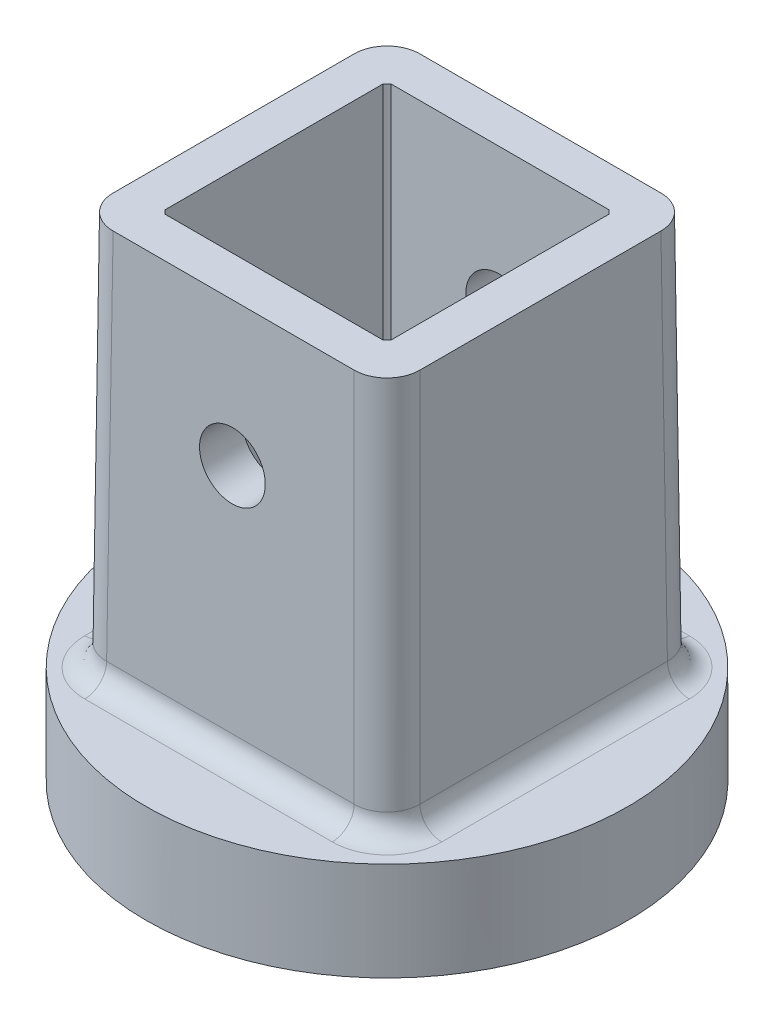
ISO-10303-21;
HEADER;
FILE_DESCRIPTION(('STEP AP214'),'2;1');
FILE_NAME('part.step','',(''),(''),'','','');
FILE_SCHEMA(('AUTOMOTIVE_DESIGN { 1 0 10303 214 1 1 1 1 }'));
ENDSEC;
DATA;
#1=APPLICATION_CONTEXT('core data for automotive mechanical design processes');
#2=APPLICATION_PROTOCOL_DEFINITION('international standard','automotive_design',2000,#1);
#3=PRODUCT_CONTEXT('',#1,'mechanical');
#4=PRODUCT('Part','Part','',(#3));
#5=PRODUCT_RELATED_PRODUCT_CATEGORY('part','',(#4));
#6=PRODUCT_DEFINITION_FORMATION('','',#4);
#7=PRODUCT_DEFINITION_CONTEXT('part definition',#1,'design');
#8=PRODUCT_DEFINITION('design','',#6,#7);
#9=PRODUCT_DEFINITION_SHAPE('','',#8);
#10=(LENGTH_UNIT() NAMED_UNIT(*) SI_UNIT(.MILLI.,.METRE.));
#11=(NAMED_UNIT(*) PLANE_ANGLE_UNIT() SI_UNIT($,.RADIAN.));
#12=(NAMED_UNIT(*) SI_UNIT($,.STERADIAN.) SOLID_ANGLE_UNIT());
#13=UNCERTAINTY_MEASURE_WITH_UNIT(LENGTH_MEASURE(1.E-05),#10,'distance_accuracy_value','');
#14=(GEOMETRIC_REPRESENTATION_CONTEXT(3) GLOBAL_UNCERTAINTY_ASSIGNED_CONTEXT((#13)) GLOBAL_UNIT_ASSIGNED_CONTEXT((#10,
#11,#12)) REPRESENTATION_CONTEXT('',''));
#15=CARTESIAN_POINT('',(0.,0.,0.));
#16=DIRECTION('',(0.,0.,1.));
#17=DIRECTION('',(1.,0.,0.));
#18=AXIS2_PLACEMENT_3D('',#15,#16,#17);
#19=CARTESIAN_POINT('',(0.,2.,0.));
#20=DIRECTION('',(0.,-1.,0.));
#21=DIRECTION('',(0.,0.,-1.));
#22=AXIS2_PLACEMENT_3D('',#19,#20,#21);
#23=PLANE('',#22);
#24=CARTESIAN_POINT('',(0.,2.,0.));
#25=DIRECTION('',(0.,1.,0.));
#26=DIRECTION('',(0.,0.,1.));
#27=AXIS2_PLACEMENT_3D('',#24,#25,#26);
#28=CIRCLE('',#27,5.);
#29=CARTESIAN_POINT('',(0.,2.,5.));
#30=VERTEX_POINT('',#29);
#31=CARTESIAN_POINT('',(5.,2.,0.));
#32=VERTEX_POINT('',#31);
#33=EDGE_CURVE('E190',#30,#32,#28,.T.);
#34=ORIENTED_EDGE('',*,*,#33,.F.);
#35=DIRECTION('',(1.,0.,0.));
#36=VECTOR('',#35,1.);
#37=CARTESIAN_POINT('',(-5.,2.,5.));
#38=LINE('',#37,#36);
#39=CARTESIAN_POINT('',(4.822942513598,2.,5.));
#40=VERTEX_POINT('',#39);
#41=EDGE_CURVE('E200',#30,#40,#38,.T.);
#42=ORIENTED_EDGE('',*,*,#41,.T.);
#43=CARTESIAN_POINT('',(3.49992384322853,2.,3.49992384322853));
#44=DIRECTION('',(0.,-1.,0.));
#45=DIRECTION('',(0.707106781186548,0.,0.707106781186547));
#46=AXIS2_PLACEMENT_3D('',#43,#44,#45);
#47=ELLIPSE('',#46,2.00015231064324,2.);
#48=CARTESIAN_POINT('',(5.,2.,4.82294251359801));
#49=VERTEX_POINT('',#48);
#50=EDGE_CURVE('E331',#40,#49,#47,.F.);
#51=ORIENTED_EDGE('',*,*,#50,.T.);
#52=DIRECTION('',(0.,0.,-1.));
#53=VECTOR('',#52,1.);
#54=CARTESIAN_POINT('',(5.,2.,5.));
#55=LINE('',#54,#53);
#56=EDGE_CURVE('E202',#49,#32,#55,.T.);
#57=ORIENTED_EDGE('',*,*,#56,.T.);
#58=EDGE_LOOP('',(#34,#42,#51,#57));
#59=FACE_BOUND('',#58,.T.);
#60=ADVANCED_FACE('F37',(#59),#23,.F.);
#61=CARTESIAN_POINT('',(0.,2.,-5.));
#62=VERTEX_POINT('',#61);
#63=EDGE_CURVE('E203',#32,#62,#28,.T.);
#64=ORIENTED_EDGE('',*,*,#63,.F.);
#65=CARTESIAN_POINT('',(5.,2.,-4.822942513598));
#66=VERTEX_POINT('',#65);
#67=EDGE_CURVE('E232',#32,#66,#55,.T.);
#68=ORIENTED_EDGE('',*,*,#67,.T.);
#69=CARTESIAN_POINT('',(3.49992384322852,2.,-3.49992384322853));
#70=DIRECTION('',(0.,-1.,0.));
#71=DIRECTION('',(0.707106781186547,0.,-0.707106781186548));
#72=AXIS2_PLACEMENT_3D('',#69,#70,#71);
#73=ELLIPSE('',#72,2.00015231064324,2.);
#74=CARTESIAN_POINT('',(4.822942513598,2.,-5.));
#75=VERTEX_POINT('',#74);
#76=EDGE_CURVE('E384',#66,#75,#73,.F.);
#77=ORIENTED_EDGE('',*,*,#76,.T.);
#78=DIRECTION('',(-1.,0.,0.));
#79=VECTOR('',#78,1.);
#80=CARTESIAN_POINT('',(-5.,2.,-5.));
#81=LINE('',#80,#79);
#82=EDGE_CURVE('E227',#75,#62,#81,.T.);
#83=ORIENTED_EDGE('',*,*,#82,.T.);
#84=EDGE_LOOP('',(#64,#68,#77,#83));
#85=FACE_BOUND('',#84,.T.);
#86=ADVANCED_FACE('F429',(#85),#23,.F.);
#87=CARTESIAN_POINT('',(-5.,2.,0.));
#88=VERTEX_POINT('',#87);
#89=EDGE_CURVE('E54',#62,#88,#28,.T.);
#90=ORIENTED_EDGE('',*,*,#89,.F.);
#91=CARTESIAN_POINT('',(-4.822942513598,2.,-5.));
#92=VERTEX_POINT('',#91);
#93=EDGE_CURVE('E230',#62,#92,#81,.T.);
#94=ORIENTED_EDGE('',*,*,#93,.T.);
#95=CARTESIAN_POINT('',(-3.49992384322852,2.,-3.49992384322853));
#96=DIRECTION('',(0.,-1.,0.));
#97=DIRECTION('',(-0.707106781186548,0.,-0.707106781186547));
#98=AXIS2_PLACEMENT_3D('',#95,#96,#97);
#99=ELLIPSE('',#98,2.00015231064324,2.);
#100=CARTESIAN_POINT('',(-5.,2.,-4.822942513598));
#101=VERTEX_POINT('',#100);
#102=EDGE_CURVE('E387',#92,#101,#99,.F.);
#103=ORIENTED_EDGE('',*,*,#102,.T.);
#104=DIRECTION('',(0.,0.,1.));
#105=VECTOR('',#104,1.);
#106=CARTESIAN_POINT('',(-5.,2.,5.));
#107=LINE('',#106,#105);
#108=EDGE_CURVE('E211',#101,#88,#107,.T.);
#109=ORIENTED_EDGE('',*,*,#108,.T.);
#110=EDGE_LOOP('',(#90,#94,#103,#109));
#111=FACE_BOUND('',#110,.T.);
#112=ADVANCED_FACE('F434',(#111),#23,.F.);
#113=CARTESIAN_POINT('',(0.,19.5,0.));
#114=DIRECTION('',(0.,-1.,0.));
#115=DIRECTION('',(0.,0.,-1.));
#116=AXIS2_PLACEMENT_3D('',#113,#114,#115);
#117=PLANE('',#116);
#118=DIRECTION('',(1.,0.,0.));
#119=VECTOR('',#118,1.);
#120=CARTESIAN_POINT('',(-5.,19.5,-5.15272018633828));
#121=LINE('',#120,#119);
#122=CARTESIAN_POINT('',(-4.97566269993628,19.5,-5.15272018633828));
#123=VERTEX_POINT('',#122);
#124=CARTESIAN_POINT('',(4.97566269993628,19.5,-5.15272018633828));
#125=VERTEX_POINT('',#124);
#126=EDGE_CURVE('E217',#123,#125,#121,.T.);
#127=ORIENTED_EDGE('',*,*,#126,.T.);
#128=CARTESIAN_POINT('',(3.6526440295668,19.5,-3.65264402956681));
#129=DIRECTION('',(0.,-1.,0.));
#130=DIRECTION('',(0.707106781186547,0.,-0.707106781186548));
#131=AXIS2_PLACEMENT_3D('',#128,#129,#130);
#132=ELLIPSE('',#131,2.00015231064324,2.);
#133=CARTESIAN_POINT('',(5.15272018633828,19.5,-4.97566269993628));
#134=VERTEX_POINT('',#133);
#135=EDGE_CURVE('E395',#125,#134,#132,.T.);
#136=ORIENTED_EDGE('',*,*,#135,.T.);
#137=DIRECTION('',(0.,0.,1.));
#138=VECTOR('',#137,1.);
#139=CARTESIAN_POINT('',(5.15272018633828,19.5,5.));
#140=LINE('',#139,#138);
#141=CARTESIAN_POINT('',(5.15272018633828,19.5,4.97566269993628));
#142=VERTEX_POINT('',#141);
#143=EDGE_CURVE('E218',#134,#142,#140,.T.);
#144=ORIENTED_EDGE('',*,*,#143,.T.);
#145=CARTESIAN_POINT('',(3.65264402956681,19.5,3.65264402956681));
#146=DIRECTION('',(0.,-1.,0.));
#147=DIRECTION('',(0.707106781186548,0.,0.707106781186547));
#148=AXIS2_PLACEMENT_3D('',#145,#146,#147);
#149=ELLIPSE('',#148,2.00015231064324,2.);
#150=CARTESIAN_POINT('',(4.97566269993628,19.5,5.15272018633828));
#151=VERTEX_POINT('',#150);
#152=EDGE_CURVE('E398',#142,#151,#149,.T.);
#153=ORIENTED_EDGE('',*,*,#152,.T.);
#154=DIRECTION('',(-1.,0.,0.));
#155=VECTOR('',#154,1.);
#156=CARTESIAN_POINT('',(-5.,19.5,5.15272018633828));
#157=LINE('',#156,#155);
#158=CARTESIAN_POINT('',(-4.97566269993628,19.5,5.15272018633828));
#159=VERTEX_POINT('',#158);
#160=EDGE_CURVE('E233',#151,#159,#157,.T.);
#161=ORIENTED_EDGE('',*,*,#160,.T.);
#162=CARTESIAN_POINT('',(-3.6526440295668,19.5,3.6526440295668));
#163=DIRECTION('',(0.,-1.,0.));
#164=DIRECTION('',(-0.707106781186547,0.,0.707106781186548));
#165=AXIS2_PLACEMENT_3D('',#162,#163,#164);
#166=ELLIPSE('',#165,2.00015231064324,2.);
#167=CARTESIAN_POINT('',(-5.15272018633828,19.5,4.97566269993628));
#168=VERTEX_POINT('',#167);
#169=EDGE_CURVE('E391',#159,#168,#166,.T.);
#170=ORIENTED_EDGE('',*,*,#169,.T.);
#171=DIRECTION('',(0.,0.,-1.));
#172=VECTOR('',#171,1.);
#173=CARTESIAN_POINT('',(-5.15272018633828,19.5,5.));
#174=LINE('',#173,#172);
#175=CARTESIAN_POINT('',(-5.15272018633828,19.5,-4.97566269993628));
#176=VERTEX_POINT('',#175);
#177=EDGE_CURVE('E62',#168,#176,#174,.T.);
#178=ORIENTED_EDGE('',*,*,#177,.T.);
#179=CARTESIAN_POINT('',(-3.6526440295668,19.5,-3.65264402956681));
#180=DIRECTION('',(0.,-1.,0.));
#181=DIRECTION('',(-0.707106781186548,0.,-0.707106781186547));
#182=AXIS2_PLACEMENT_3D('',#179,#180,#181);
#183=ELLIPSE('',#182,2.00015231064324,2.);
#184=EDGE_CURVE('E393',#176,#123,#183,.T.);
#185=ORIENTED_EDGE('',*,*,#184,.T.);
#186=EDGE_LOOP('',(#127,#136,#144,#153,#161,#170,#178,#185));
#187=FACE_BOUND('',#186,.T.);
#188=DIRECTION('',(-1.,0.,0.));
#189=VECTOR('',#188,1.);
#190=CARTESIAN_POINT('',(-7.,19.5,-7.));
#191=LINE('',#190,#189);
#192=CARTESIAN_POINT('',(5.50005711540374,19.5,-7.));
#193=VERTEX_POINT('',#192);
#194=CARTESIAN_POINT('',(-5.50005711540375,19.5,-7.));
#195=VERTEX_POINT('',#194);
#196=EDGE_CURVE('E260',#193,#195,#191,.T.);
#197=ORIENTED_EDGE('',*,*,#196,.T.);
#198=CARTESIAN_POINT('',(-5.4999428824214,19.5,-5.49994288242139));
#199=DIRECTION('',(0.,-1.,0.));
#200=DIRECTION('',(0.707106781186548,0.,0.707106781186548));
#201=AXIS2_PLACEMENT_3D('',#198,#199,#200);
#202=ELLIPSE('',#201,1.50011423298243,1.5);
#203=CARTESIAN_POINT('',(-7.,19.5,-5.50005711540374));
#204=VERTEX_POINT('',#203);
#205=EDGE_CURVE('E280',#195,#204,#202,.F.);
#206=ORIENTED_EDGE('',*,*,#205,.T.);
#207=DIRECTION('',(0.,0.,1.));
#208=VECTOR('',#207,1.);
#209=CARTESIAN_POINT('',(-7.,19.5,7.));
#210=LINE('',#209,#208);
#211=CARTESIAN_POINT('',(-7.,19.5,5.50005711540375));
#212=VERTEX_POINT('',#211);
#213=EDGE_CURVE('E263',#204,#212,#210,.T.);
#214=ORIENTED_EDGE('',*,*,#213,.T.);
#215=CARTESIAN_POINT('',(-5.49994288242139,19.5,5.4999428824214));
#216=DIRECTION('',(0.,-1.,0.));
#217=DIRECTION('',(0.707106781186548,0.,-0.707106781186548));
#218=AXIS2_PLACEMENT_3D('',#215,#216,#217);
#219=ELLIPSE('',#218,1.50011423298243,1.5);
#220=CARTESIAN_POINT('',(-5.50005711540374,19.5,7.));
#221=VERTEX_POINT('',#220);
#222=EDGE_CURVE('E276',#212,#221,#219,.F.);
#223=ORIENTED_EDGE('',*,*,#222,.T.);
#224=DIRECTION('',(1.,0.,0.));
#225=VECTOR('',#224,1.);
#226=CARTESIAN_POINT('',(-7.,19.5,7.));
#227=LINE('',#226,#225);
#228=CARTESIAN_POINT('',(5.50005711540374,19.5,7.));
#229=VERTEX_POINT('',#228);
#230=EDGE_CURVE('E266',#221,#229,#227,.T.);
#231=ORIENTED_EDGE('',*,*,#230,.T.);
#232=CARTESIAN_POINT('',(5.4999428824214,19.5,5.49994288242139));
#233=DIRECTION('',(0.,-1.,0.));
#234=DIRECTION('',(-0.707106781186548,0.,-0.707106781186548));
#235=AXIS2_PLACEMENT_3D('',#232,#233,#234);
#236=ELLIPSE('',#235,1.50011423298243,1.5);
#237=CARTESIAN_POINT('',(7.,19.5,5.50005711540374));
#238=VERTEX_POINT('',#237);
#239=EDGE_CURVE('E274',#229,#238,#236,.F.);
#240=ORIENTED_EDGE('',*,*,#239,.T.);
#241=DIRECTION('',(0.,0.,-1.));
#242=VECTOR('',#241,1.);
#243=CARTESIAN_POINT('',(7.,19.5,7.));
#244=LINE('',#243,#242);
#245=CARTESIAN_POINT('',(7.,19.5,-5.50005711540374));
#246=VERTEX_POINT('',#245);
#247=EDGE_CURVE('E257',#238,#246,#244,.T.);
#248=ORIENTED_EDGE('',*,*,#247,.T.);
#249=CARTESIAN_POINT('',(5.49994288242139,19.5,-5.4999428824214));
#250=DIRECTION('',(0.,-1.,0.));
#251=DIRECTION('',(-0.707106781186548,0.,0.707106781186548));
#252=AXIS2_PLACEMENT_3D('',#249,#250,#251);
#253=ELLIPSE('',#252,1.50011423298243,1.5);
#254=EDGE_CURVE('E278',#246,#193,#253,.F.);
#255=ORIENTED_EDGE('',*,*,#254,.T.);
#256=EDGE_LOOP('',(#197,#206,#214,#223,#231,#240,#248,#255));
#257=FACE_BOUND('',#256,.T.);
#258=ADVANCED_FACE('F439',(#187,#257),#117,.F.);
#259=EDGE_CURVE('E186',#88,#30,#28,.T.);
#260=ORIENTED_EDGE('',*,*,#259,.F.);
#261=CARTESIAN_POINT('',(-5.,2.,4.822942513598));
#262=VERTEX_POINT('',#261);
#263=EDGE_CURVE('E226',#88,#262,#107,.T.);
#264=ORIENTED_EDGE('',*,*,#263,.T.);
#265=CARTESIAN_POINT('',(-3.49992384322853,2.,3.49992384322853));
#266=DIRECTION('',(0.,-1.,0.));
#267=DIRECTION('',(-0.707106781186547,0.,0.707106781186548));
#268=AXIS2_PLACEMENT_3D('',#265,#266,#267);
#269=ELLIPSE('',#268,2.00015231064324,2.);
#270=CARTESIAN_POINT('',(-4.822942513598,2.,5.));
#271=VERTEX_POINT('',#270);
#272=EDGE_CURVE('E216',#262,#271,#269,.F.);
#273=ORIENTED_EDGE('',*,*,#272,.T.);
#274=EDGE_CURVE('E206',#271,#30,#38,.T.);
#275=ORIENTED_EDGE('',*,*,#274,.T.);
#276=EDGE_LOOP('',(#260,#264,#273,#275));
#277=FACE_BOUND('',#276,.T.);
#278=ADVANCED_FACE('F214',(#277),#23,.F.);
#279=CARTESIAN_POINT('',(7.,19.5,7.));
#280=DIRECTION('',(0.,0.00872653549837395,0.999961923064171));
#281=DIRECTION('',(0.,-0.999961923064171,0.00872653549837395));
#282=AXIS2_PLACEMENT_3D('',#279,#280,#281);
#283=PLANE('',#282);
#284=CARTESIAN_POINT('',(0.,13.,7.05672464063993));
#285=DIRECTION('',(0.,0.00872653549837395,0.999961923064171));
#286=DIRECTION('',(0.,-0.999961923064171,0.00872653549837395));
#287=AXIS2_PLACEMENT_3D('',#284,#285,#286);
#288=ELLIPSE('',#287,1.50005711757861,1.5);
#289=CARTESIAN_POINT('',(0.,11.5,7.06981494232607));
#290=VERTEX_POINT('',#289);
#291=EDGE_CURVE('E222',#290,#290,#288,.T.);
#292=ORIENTED_EDGE('',*,*,#291,.F.);
#293=EDGE_LOOP('',(#292));
#294=FACE_BOUND('',#293,.T.);
#295=DIRECTION('',(0.00872620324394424,0.999923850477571,-0.00872620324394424));
#296=VECTOR('',#295,1.);
#297=CARTESIAN_POINT('',(-5.49910527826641,19.6090697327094,6.99904816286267));
#298=LINE('',#297,#296);
#299=CARTESIAN_POINT('',(-5.64849002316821,2.49127346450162,7.14843290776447));
#300=VERTEX_POINT('',#299);
#301=EDGE_CURVE('E294',#221,#300,#298,.F.);
#302=ORIENTED_EDGE('',*,*,#301,.T.);
#303=DIRECTION('',(1.,0.,0.));
#304=VECTOR('',#303,1.);
#305=CARTESIAN_POINT('',(7.,2.49127346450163,7.14843290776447));
#306=LINE('',#305,#304);
#307=CARTESIAN_POINT('',(5.64849002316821,2.49127346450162,7.14843290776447));
#308=VERTEX_POINT('',#307);
#309=EDGE_CURVE('E321',#300,#308,#306,.T.);
#310=ORIENTED_EDGE('',*,*,#309,.T.);
#311=DIRECTION('',(-0.00872620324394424,0.999923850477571,-0.00872620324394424));
#312=VECTOR('',#311,1.);
#313=CARTESIAN_POINT('',(5.50017133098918,19.4869121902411,7.00011421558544));
#314=LINE('',#313,#312);
#315=EDGE_CURVE('E292',#308,#229,#314,.T.);
#316=ORIENTED_EDGE('',*,*,#315,.T.);
#317=ORIENTED_EDGE('',*,*,#230,.F.);
#318=EDGE_LOOP('',(#302,#310,#316,#317));
#319=FACE_BOUND('',#318,.T.);
#320=ADVANCED_FACE('F438',(#294,#319),#283,.T.);
#321=CARTESIAN_POINT('',(7.,19.5,-7.));
#322=DIRECTION('',(0.999961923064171,0.00872653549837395,0.));
#323=DIRECTION('',(-0.00872653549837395,0.999961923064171,0.));
#324=AXIS2_PLACEMENT_3D('',#321,#322,#323);
#325=PLANE('',#324);
#326=DIRECTION('',(-0.00872620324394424,0.999923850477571,-0.00872620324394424));
#327=VECTOR('',#326,1.);
#328=CARTESIAN_POINT('',(6.99904816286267,19.6090697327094,5.49910527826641));
#329=LINE('',#328,#327);
#330=CARTESIAN_POINT('',(7.14843290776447,2.49127346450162,5.64849002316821));
#331=VERTEX_POINT('',#330);
#332=EDGE_CURVE('E287',#238,#331,#329,.F.);
#333=ORIENTED_EDGE('',*,*,#332,.T.);
#334=DIRECTION('',(0.,0.,-1.));
#335=VECTOR('',#334,1.);
#336=CARTESIAN_POINT('',(7.14843290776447,2.49127346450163,-7.));
#337=LINE('',#336,#335);
#338=CARTESIAN_POINT('',(7.14843290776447,2.49127346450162,-5.64849002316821));
#339=VERTEX_POINT('',#338);
#340=EDGE_CURVE('E317',#331,#339,#337,.T.);
#341=ORIENTED_EDGE('',*,*,#340,.T.);
#342=DIRECTION('',(-0.00872620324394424,0.999923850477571,0.00872620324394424));
#343=VECTOR('',#342,1.);
#344=CARTESIAN_POINT('',(7.00011421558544,19.4869121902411,-5.50017133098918));
#345=LINE('',#344,#343);
#346=EDGE_CURVE('E290',#339,#246,#345,.T.);
#347=ORIENTED_EDGE('',*,*,#346,.T.);
#348=ORIENTED_EDGE('',*,*,#247,.F.);
#349=EDGE_LOOP('',(#333,#341,#347,#348));
#350=FACE_BOUND('',#349,.T.);
#351=ADVANCED_FACE('F444',(#350),#325,.T.);
#352=CARTESIAN_POINT('',(7.,19.5,-7.));
#353=DIRECTION('',(0.,0.00872653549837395,-0.999961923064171));
#354=DIRECTION('',(0.,0.999961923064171,0.00872653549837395));
#355=AXIS2_PLACEMENT_3D('',#352,#353,#354);
#356=PLANE('',#355);
#357=CARTESIAN_POINT('',(0.,13.,-7.05672464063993));
#358=DIRECTION('',(0.,0.00872653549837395,-0.999961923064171));
#359=DIRECTION('',(0.,0.999961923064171,0.00872653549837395));
#360=AXIS2_PLACEMENT_3D('',#357,#358,#359);
#361=ELLIPSE('',#360,1.50005711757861,1.5);
#362=CARTESIAN_POINT('',(0.,14.5,-7.04363433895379));
#363=VERTEX_POINT('',#362);
#364=EDGE_CURVE('E412',#363,#363,#361,.T.);
#365=ORIENTED_EDGE('',*,*,#364,.F.);
#366=EDGE_LOOP('',(#365));
#367=FACE_BOUND('',#366,.T.);
#368=DIRECTION('',(-0.00872620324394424,0.999923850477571,0.00872620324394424));
#369=VECTOR('',#368,1.);
#370=CARTESIAN_POINT('',(5.50017133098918,19.4869121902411,-7.00011421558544));
#371=LINE('',#370,#369);
#372=CARTESIAN_POINT('',(5.64849002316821,2.49127346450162,-7.14843290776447));
#373=VERTEX_POINT('',#372);
#374=EDGE_CURVE('E269',#193,#373,#371,.F.);
#375=ORIENTED_EDGE('',*,*,#374,.T.);
#376=DIRECTION('',(-1.,0.,0.));
#377=VECTOR('',#376,1.);
#378=CARTESIAN_POINT('',(7.,2.49127346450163,-7.14843290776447));
#379=LINE('',#378,#377);
#380=CARTESIAN_POINT('',(-5.64849002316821,2.49127346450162,-7.14843290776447));
#381=VERTEX_POINT('',#380);
#382=EDGE_CURVE('E329',#373,#381,#379,.T.);
#383=ORIENTED_EDGE('',*,*,#382,.T.);
#384=DIRECTION('',(0.00872620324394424,0.999923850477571,0.00872620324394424));
#385=VECTOR('',#384,1.);
#386=CARTESIAN_POINT('',(-5.49910527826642,19.6090697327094,-6.99904816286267));
#387=LINE('',#386,#385);
#388=EDGE_CURVE('E272',#381,#195,#387,.T.);
#389=ORIENTED_EDGE('',*,*,#388,.T.);
#390=ORIENTED_EDGE('',*,*,#196,.F.);
#391=EDGE_LOOP('',(#375,#383,#389,#390));
#392=FACE_BOUND('',#391,.T.);
#393=ADVANCED_FACE('F472',(#367,#392),#356,.T.);
#394=CARTESIAN_POINT('',(-7.,19.5,-7.));
#395=DIRECTION('',(-0.999961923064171,0.00872653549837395,0.));
#396=DIRECTION('',(-0.00872653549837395,-0.999961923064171,0.));
#397=AXIS2_PLACEMENT_3D('',#394,#395,#396);
#398=PLANE('',#397);
#399=DIRECTION('',(0.00872620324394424,0.999923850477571,0.00872620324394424));
#400=VECTOR('',#399,1.);
#401=CARTESIAN_POINT('',(-7.00011421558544,19.4869121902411,-5.50017133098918));
#402=LINE('',#401,#400);
#403=CARTESIAN_POINT('',(-7.14843290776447,2.49127346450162,-5.64849002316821));
#404=VERTEX_POINT('',#403);
#405=EDGE_CURVE('E284',#204,#404,#402,.F.);
#406=ORIENTED_EDGE('',*,*,#405,.T.);
#407=DIRECTION('',(0.,0.,1.));
#408=VECTOR('',#407,1.);
#409=CARTESIAN_POINT('',(-7.14843290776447,2.49127346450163,-7.));
#410=LINE('',#409,#408);
#411=CARTESIAN_POINT('',(-7.14843290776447,2.49127346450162,5.64849002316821));
#412=VERTEX_POINT('',#411);
#413=EDGE_CURVE('E325',#404,#412,#410,.T.);
#414=ORIENTED_EDGE('',*,*,#413,.T.);
#415=DIRECTION('',(0.00872620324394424,0.999923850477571,-0.00872620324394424));
#416=VECTOR('',#415,1.);
#417=CARTESIAN_POINT('',(-6.99904816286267,19.6090697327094,5.49910527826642));
#418=LINE('',#417,#416);
#419=EDGE_CURVE('E282',#412,#212,#418,.T.);
#420=ORIENTED_EDGE('',*,*,#419,.T.);
#421=ORIENTED_EDGE('',*,*,#213,.F.);
#422=EDGE_LOOP('',(#406,#414,#420,#421));
#423=FACE_BOUND('',#422,.T.);
#424=ADVANCED_FACE('F548',(#423),#398,.T.);
#425=CARTESIAN_POINT('',(0.,-3.,0.));
#426=DIRECTION('',(0.,1.,0.));
#427=DIRECTION('',(0.,0.,1.));
#428=AXIS2_PLACEMENT_3D('',#425,#426,#427);
#429=PLANE('',#428);
#430=CARTESIAN_POINT('',(0.,-3.,0.));
#431=DIRECTION('',(0.,1.,0.));
#432=DIRECTION('',(0.,0.,1.));
#433=AXIS2_PLACEMENT_3D('',#430,#431,#432);
#434=CIRCLE('',#433,5.);
#435=CARTESIAN_POINT('',(0.,-3.,5.));
#436=VERTEX_POINT('',#435);
#437=EDGE_CURVE('E41',#436,#436,#434,.T.);
#438=ORIENTED_EDGE('',*,*,#437,.T.);
#439=EDGE_LOOP('',(#438));
#440=FACE_BOUND('',#439,.T.);
#441=CARTESIAN_POINT('',(0.,-3.,0.));
#442=DIRECTION('',(0.,1.,0.));
#443=DIRECTION('',(0.,0.,1.));
#444=AXIS2_PLACEMENT_3D('',#441,#442,#443);
#445=CIRCLE('',#444,11.);
#446=CARTESIAN_POINT('',(0.,-3.,11.));
#447=VERTEX_POINT('',#446);
#448=EDGE_CURVE('E250',#447,#447,#445,.T.);
#449=ORIENTED_EDGE('',*,*,#448,.F.);
#450=EDGE_LOOP('',(#449));
#451=FACE_BOUND('',#450,.T.);
#452=ADVANCED_FACE('F417',(#440,#451),#429,.F.);
#453=CARTESIAN_POINT('',(0.,1.5,0.));
#454=DIRECTION('',(0.,-1.,0.));
#455=DIRECTION('',(0.,0.,-1.));
#456=AXIS2_PLACEMENT_3D('',#453,#454,#455);
#457=CYLINDRICAL_SURFACE('',#456,11.);
#458=CARTESIAN_POINT('',(0.,1.5,0.));
#459=DIRECTION('',(0.,-1.,0.));
#460=DIRECTION('',(0.,0.,-1.));
#461=AXIS2_PLACEMENT_3D('',#458,#459,#460);
#462=CIRCLE('',#461,11.);
#463=CARTESIAN_POINT('',(0.,1.5,-11.));
#464=VERTEX_POINT('',#463);
#465=EDGE_CURVE('E253',#464,#464,#462,.T.);
#466=ORIENTED_EDGE('',*,*,#465,.T.);
#467=EDGE_LOOP('',(#466));
#468=FACE_BOUND('',#467,.T.);
#469=ORIENTED_EDGE('',*,*,#448,.T.);
#470=EDGE_LOOP('',(#469));
#471=FACE_BOUND('',#470,.T.);
#472=ADVANCED_FACE('F555',(#468,#471),#457,.T.);
#473=CARTESIAN_POINT('',(0.,1.5,0.));
#474=DIRECTION('',(0.,-1.,0.));
#475=DIRECTION('',(0.,0.,-1.));
#476=AXIS2_PLACEMENT_3D('',#473,#474,#475);
#477=PLANE('',#476);
#478=DIRECTION('',(-1.,0.,0.));
#479=VECTOR('',#478,1.);
#480=CARTESIAN_POINT('',(0.,1.5,-8.14839483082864));
#481=LINE('',#480,#479);
#482=CARTESIAN_POINT('',(-5.64849002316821,1.5,-8.14839483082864));
#483=VERTEX_POINT('',#482);
#484=CARTESIAN_POINT('',(5.64849002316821,1.5,-8.14839483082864));
#485=VERTEX_POINT('',#484);
#486=EDGE_CURVE('E297',#483,#485,#481,.F.);
#487=ORIENTED_EDGE('',*,*,#486,.T.);
#488=CARTESIAN_POINT('',(5.64829963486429,1.5,-5.6482996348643));
#489=DIRECTION('',(0.,-1.,0.));
#490=DIRECTION('',(-0.707106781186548,0.,0.707106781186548));
#491=AXIS2_PLACEMENT_3D('',#488,#489,#490);
#492=ELLIPSE('',#491,2.50019038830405,2.5);
#493=CARTESIAN_POINT('',(8.14839483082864,1.5,-5.64849002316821));
#494=VERTEX_POINT('',#493);
#495=EDGE_CURVE('E311',#485,#494,#492,.T.);
#496=ORIENTED_EDGE('',*,*,#495,.T.);
#497=DIRECTION('',(0.,0.,-1.));
#498=VECTOR('',#497,1.);
#499=CARTESIAN_POINT('',(8.14839483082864,1.5,0.));
#500=LINE('',#499,#498);
#501=CARTESIAN_POINT('',(8.14839483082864,1.5,5.64849002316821));
#502=VERTEX_POINT('',#501);
#503=EDGE_CURVE('E309',#494,#502,#500,.F.);
#504=ORIENTED_EDGE('',*,*,#503,.T.);
#505=CARTESIAN_POINT('',(5.6482996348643,1.5,5.64829963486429));
#506=DIRECTION('',(0.,-1.,0.));
#507=DIRECTION('',(-0.707106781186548,0.,-0.707106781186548));
#508=AXIS2_PLACEMENT_3D('',#505,#506,#507);
#509=ELLIPSE('',#508,2.50019038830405,2.5);
#510=CARTESIAN_POINT('',(5.64849002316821,1.5,8.14839483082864));
#511=VERTEX_POINT('',#510);
#512=EDGE_CURVE('E307',#502,#511,#509,.T.);
#513=ORIENTED_EDGE('',*,*,#512,.T.);
#514=DIRECTION('',(1.,0.,0.));
#515=VECTOR('',#514,1.);
#516=CARTESIAN_POINT('',(0.,1.5,8.14839483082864));
#517=LINE('',#516,#515);
#518=CARTESIAN_POINT('',(-5.64849002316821,1.5,8.14839483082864));
#519=VERTEX_POINT('',#518);
#520=EDGE_CURVE('E305',#511,#519,#517,.F.);
#521=ORIENTED_EDGE('',*,*,#520,.T.);
#522=CARTESIAN_POINT('',(-5.64829963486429,1.5,5.6482996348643));
#523=DIRECTION('',(0.,-1.,0.));
#524=DIRECTION('',(0.707106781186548,0.,-0.707106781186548));
#525=AXIS2_PLACEMENT_3D('',#522,#523,#524);
#526=ELLIPSE('',#525,2.50019038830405,2.5);
#527=CARTESIAN_POINT('',(-8.14839483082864,1.5,5.64849002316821));
#528=VERTEX_POINT('',#527);
#529=EDGE_CURVE('E303',#519,#528,#526,.T.);
#530=ORIENTED_EDGE('',*,*,#529,.T.);
#531=DIRECTION('',(0.,0.,1.));
#532=VECTOR('',#531,1.);
#533=CARTESIAN_POINT('',(-8.14839483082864,1.5,0.));
#534=LINE('',#533,#532);
#535=CARTESIAN_POINT('',(-8.14839483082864,1.5,-5.64849002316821));
#536=VERTEX_POINT('',#535);
#537=EDGE_CURVE('E301',#528,#536,#534,.F.);
#538=ORIENTED_EDGE('',*,*,#537,.T.);
#539=CARTESIAN_POINT('',(-5.6482996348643,1.5,-5.64829963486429));
#540=DIRECTION('',(0.,-1.,0.));
#541=DIRECTION('',(0.707106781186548,0.,0.707106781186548));
#542=AXIS2_PLACEMENT_3D('',#539,#540,#541);
#543=ELLIPSE('',#542,2.50019038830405,2.5);
#544=EDGE_CURVE('E299',#536,#483,#543,.T.);
#545=ORIENTED_EDGE('',*,*,#544,.T.);
#546=EDGE_LOOP('',(#487,#496,#504,#513,#521,#530,#538,#545));
#547=FACE_BOUND('',#546,.T.);
#548=ORIENTED_EDGE('',*,*,#465,.F.);
#549=EDGE_LOOP('',(#548));
#550=FACE_BOUND('',#549,.T.);
#551=ADVANCED_FACE('F353',(#547,#550),#477,.F.);
#552=CARTESIAN_POINT('',(-5.49910527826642,19.5959799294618,-5.49910527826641));
#553=DIRECTION('',(0.00872620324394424,0.99992385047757,0.00872620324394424));
#554=DIRECTION('',(0.,-0.00872653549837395,0.999961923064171));
#555=AXIS2_PLACEMENT_3D('',#552,#553,#554);
#556=CYLINDRICAL_SURFACE('',#555,1.5);
#557=ORIENTED_EDGE('',*,*,#388,.F.);
#558=CARTESIAN_POINT('',(-5.6482996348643,2.5,-5.64829963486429));
#559=DIRECTION('',(-0.00581623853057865,0.999966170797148,-0.00581623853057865));
#560=DIRECTION('',(0.707082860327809,0.00822540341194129,0.707082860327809));
#561=AXIS2_PLACEMENT_3D('',#558,#559,#560);
#562=ELLIPSE('',#561,1.50031729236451,1.5);
#563=EDGE_CURVE('E327',#381,#404,#562,.T.);
#564=ORIENTED_EDGE('',*,*,#563,.T.);
#565=ORIENTED_EDGE('',*,*,#405,.F.);
#566=ORIENTED_EDGE('',*,*,#205,.F.);
#567=EDGE_LOOP('',(#557,#564,#565,#566));
#568=FACE_BOUND('',#567,.T.);
#569=ADVANCED_FACE('F362',(#568),#556,.T.);
#570=CARTESIAN_POINT('',(5.50017133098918,19.4738223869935,-5.50017133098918));
#571=DIRECTION('',(-0.00872620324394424,0.99992385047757,0.00872620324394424));
#572=DIRECTION('',(0.,-0.00872653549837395,0.999961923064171));
#573=AXIS2_PLACEMENT_3D('',#570,#571,#572);
#574=CYLINDRICAL_SURFACE('',#573,1.5);
#575=ORIENTED_EDGE('',*,*,#346,.F.);
#576=CARTESIAN_POINT('',(5.64829963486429,2.5,-5.6482996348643));
#577=DIRECTION('',(0.00581623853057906,0.999966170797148,-0.00581623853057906));
#578=DIRECTION('',(-0.707082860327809,0.00822540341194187,0.707082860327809));
#579=AXIS2_PLACEMENT_3D('',#576,#577,#578);
#580=ELLIPSE('',#579,1.50031729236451,1.5);
#581=EDGE_CURVE('E314',#339,#373,#580,.T.);
#582=ORIENTED_EDGE('',*,*,#581,.T.);
#583=ORIENTED_EDGE('',*,*,#374,.F.);
#584=ORIENTED_EDGE('',*,*,#254,.F.);
#585=EDGE_LOOP('',(#575,#582,#583,#584));
#586=FACE_BOUND('',#585,.T.);
#587=ADVANCED_FACE('F357',(#586),#574,.T.);
#588=CARTESIAN_POINT('',(-5.49910527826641,19.5959799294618,5.49910527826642));
#589=DIRECTION('',(0.00872620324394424,0.99992385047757,-0.00872620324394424));
#590=DIRECTION('',(0.,0.00872653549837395,0.999961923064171));
#591=AXIS2_PLACEMENT_3D('',#588,#589,#590);
#592=CYLINDRICAL_SURFACE('',#591,1.5);
#593=ORIENTED_EDGE('',*,*,#419,.F.);
#594=CARTESIAN_POINT('',(-5.64829963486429,2.5,5.6482996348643));
#595=DIRECTION('',(-0.00581623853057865,0.999966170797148,0.00581623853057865));
#596=DIRECTION('',(0.707082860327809,0.00822540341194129,-0.707082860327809));
#597=AXIS2_PLACEMENT_3D('',#594,#595,#596);
#598=ELLIPSE('',#597,1.50031729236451,1.5);
#599=EDGE_CURVE('E323',#412,#300,#598,.T.);
#600=ORIENTED_EDGE('',*,*,#599,.T.);
#601=ORIENTED_EDGE('',*,*,#301,.F.);
#602=ORIENTED_EDGE('',*,*,#222,.F.);
#603=EDGE_LOOP('',(#593,#600,#601,#602));
#604=FACE_BOUND('',#603,.T.);
#605=ADVANCED_FACE('F361',(#604),#592,.T.);
#606=CARTESIAN_POINT('',(5.50017133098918,19.4738223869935,5.50017133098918));
#607=DIRECTION('',(-0.00872620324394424,0.99992385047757,-0.00872620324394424));
#608=DIRECTION('',(0.,0.00872653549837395,0.999961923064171));
#609=AXIS2_PLACEMENT_3D('',#606,#607,#608);
#610=CYLINDRICAL_SURFACE('',#609,1.5);
#611=ORIENTED_EDGE('',*,*,#315,.F.);
#612=CARTESIAN_POINT('',(5.6482996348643,2.5,5.64829963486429));
#613=DIRECTION('',(0.00581623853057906,0.999966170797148,0.00581623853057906));
#614=DIRECTION('',(-0.707082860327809,0.00822540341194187,-0.707082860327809));
#615=AXIS2_PLACEMENT_3D('',#612,#613,#614);
#616=ELLIPSE('',#615,1.50031729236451,1.5);
#617=EDGE_CURVE('E319',#308,#331,#616,.T.);
#618=ORIENTED_EDGE('',*,*,#617,.T.);
#619=ORIENTED_EDGE('',*,*,#332,.F.);
#620=ORIENTED_EDGE('',*,*,#239,.F.);
#621=EDGE_LOOP('',(#611,#618,#619,#620));
#622=FACE_BOUND('',#621,.T.);
#623=ADVANCED_FACE('F349',(#622),#610,.T.);
#624=CARTESIAN_POINT('',(-3.88039805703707,1.5,3.88039805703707));
#625=CARTESIAN_POINT('',(-4.59628555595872,1.5,4.59628555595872));
#626=CARTESIAN_POINT('',(-4.58745099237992,2.51234071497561,4.58745099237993));
#627=CARTESIAN_POINT('',(-3.80326476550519,1.5,3.95753134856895));
#628=CARTESIAN_POINT('',(-4.55039107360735,1.5,4.64218003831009));
#629=CARTESIAN_POINT('',(-4.5411710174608,2.51234071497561,4.63373096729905));
#630=CARTESIAN_POINT('',(-3.73118744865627,1.5,4.03972061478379));
#631=CARTESIAN_POINT('',(-4.50748084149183,1.5,4.69105549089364));
#632=CARTESIAN_POINT('',(-4.49792493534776,2.5123054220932,4.68304483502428));
#633=CARTESIAN_POINT('',(-3.59837800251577,1.5,4.21280478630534));
#634=CARTESIAN_POINT('',(-4.42834012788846,1.5,4.79396200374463));
#635=CARTESIAN_POINT('',(-4.4182404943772,2.51216485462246,4.78689656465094));
#636=CARTESIAN_POINT('',(-3.53764590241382,1.5,4.30369971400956));
#637=CARTESIAN_POINT('',(-4.39211199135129,1.5,4.8479890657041));
#638=CARTESIAN_POINT('',(-4.38180215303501,2.51205957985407,4.84143443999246));
#639=CARTESIAN_POINT('',(-3.4285660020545,1.5,4.49263995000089));
#640=CARTESIAN_POINT('',(-4.32694564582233,1.5,4.96030123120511));
#641=CARTESIAN_POINT('',(-4.31635664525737,2.51178085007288,4.9548010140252));
#642=CARTESIAN_POINT('',(-3.38021826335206,1.5,4.59068529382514));
#643=CARTESIAN_POINT('',(-4.29800869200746,1.5,5.0185818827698));
#644=CARTESIAN_POINT('',(-4.28734951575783,2.51160739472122,5.01362973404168));
#645=CARTESIAN_POINT('',(-3.29673429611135,1.5,4.79224876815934));
#646=CARTESIAN_POINT('',(-4.24791750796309,1.5,5.13843246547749));
#647=CARTESIAN_POINT('',(-4.23726273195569,2.51119527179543,5.13457141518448));
#648=CARTESIAN_POINT('',(-3.26159816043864,1.5,4.89576693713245));
#649=CARTESIAN_POINT('',(-4.22676336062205,1.5,5.19999778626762));
#650=CARTESIAN_POINT('',(-4.21618313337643,2.51095660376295,5.19668439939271));
#651=CARTESIAN_POINT('',(-3.20513855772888,1.5,5.10650483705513));
#652=CARTESIAN_POINT('',(-4.19260494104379,1.5,5.3253923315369));
#653=CARTESIAN_POINT('',(-4.18231207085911,2.51041813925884,5.32313183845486));
#654=CARTESIAN_POINT('',(-3.18381520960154,1.5,5.21372459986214));
#655=CARTESIAN_POINT('',(-4.17959957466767,1.5,5.38921709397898));
#656=CARTESIAN_POINT('',(-4.16952067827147,2.51011834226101,5.38746631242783));
#657=CARTESIAN_POINT('',(-3.15534600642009,1.5,5.43003113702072));
#658=CARTESIAN_POINT('',(-4.16197357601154,1.5,5.51806411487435));
#659=CARTESIAN_POINT('',(-4.15244487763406,2.50946274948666,5.51725595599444));
#660=CARTESIAN_POINT('',(-3.14820028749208,1.5,5.53911792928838));
#661=CARTESIAN_POINT('',(-4.15735074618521,1.5,5.58308235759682));
#662=CARTESIAN_POINT('',(-4.14816055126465,2.50910695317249,5.58271113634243));
#663=CARTESIAN_POINT('',(-3.14820859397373,1.5,5.757292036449));
#664=CARTESIAN_POINT('',(-4.1565874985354,1.5,5.71322535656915));
#665=CARTESIAN_POINT('',(-4.14817218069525,2.50834544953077,5.71362224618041));
#666=CARTESIAN_POINT('',(-3.15536276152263,1.5,5.86637935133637));
#667=CARTESIAN_POINT('',(-4.16044392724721,1.5,5.77834681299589));
#668=CARTESIAN_POINT('',(-4.15246822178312,2.50793974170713,5.77907817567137));
#669=CARTESIAN_POINT('',(-3.18384842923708,1.5,6.08268800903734));
#670=CARTESIAN_POINT('',(-4.176596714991,1.5,5.90759785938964));
#671=CARTESIAN_POINT('',(-4.16956707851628,2.50708535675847,5.90887082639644));
#672=CARTESIAN_POINT('',(-3.20518006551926,1.5,6.18990933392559));
#673=CARTESIAN_POINT('',(-4.18888917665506,1.5,5.97172508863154));
#674=CARTESIAN_POINT('',(-4.18236997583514,2.50663667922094,5.97320753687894));
#675=CARTESIAN_POINT('',(-3.26165569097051,1.5,6.40065144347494));
#676=CARTESIAN_POINT('',(-4.22173046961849,1.5,6.09789961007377));
#677=CARTESIAN_POINT('',(-4.21626349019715,2.50570403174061,6.09966094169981));
#678=CARTESIAN_POINT('',(-3.29679979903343,1.5,6.5041721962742));
#679=CARTESIAN_POINT('',(-4.24227492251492,1.5,6.15994564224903));
#680=CARTESIAN_POINT('',(-4.23735417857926,2.50522006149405,6.16177761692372));
#681=CARTESIAN_POINT('',(-3.38029906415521,1.5,6.70574190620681));
#682=CARTESIAN_POINT('',(-4.2912968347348,1.5,6.2808980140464));
#683=CARTESIAN_POINT('',(-4.28746242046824,2.504225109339,6.2827281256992));
#684=CARTESIAN_POINT('',(-3.42865431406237,1.5,6.80379082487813));
#685=CARTESIAN_POINT('',(-4.31976973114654,1.5,6.3398042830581));
#686=CARTESIAN_POINT('',(-4.31648002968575,2.5037141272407,6.34156193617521));
#687=CARTESIAN_POINT('',(-3.53774852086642,1.5,6.99273922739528));
#688=CARTESIAN_POINT('',(-4.3841889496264,1.5,6.45346372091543));
#689=CARTESIAN_POINT('',(-4.38194563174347,2.50267389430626,6.45494005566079));
#690=CARTESIAN_POINT('',(-3.59848753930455,1.5,7.08363867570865));
#691=CARTESIAN_POINT('',(-4.42013083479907,1.5,6.50821801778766));
#692=CARTESIAN_POINT('',(-4.41839366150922,2.50214464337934,6.50948434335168));
#693=CARTESIAN_POINT('',(-3.73131005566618,1.5,7.25673281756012));
#694=CARTESIAN_POINT('',(-4.49889820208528,1.5,6.61262420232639));
#695=CARTESIAN_POINT('',(-4.49809648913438,2.50107692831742,6.61335014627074));
#696=CARTESIAN_POINT('',(-3.80339358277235,1.5,7.33892748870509));
#697=CARTESIAN_POINT('',(-4.54171967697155,1.5,6.6622783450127));
#698=CARTESIAN_POINT('',(-4.54135130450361,2.50053846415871,6.66267164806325));
#699=CARTESIAN_POINT('',(-3.9576717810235,1.5,7.49320568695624));
#700=CARTESIAN_POINT('',(-4.63353452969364,1.5,6.7556161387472));
#701=CARTESIAN_POINT('',(-4.63392762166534,2.49946153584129,6.75524796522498));
#702=CARTESIAN_POINT('',(-4.03986645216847,1.5,7.56528921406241));
#703=CARTESIAN_POINT('',(-4.68252460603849,1.5,6.79930302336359));
#704=CARTESIAN_POINT('',(-4.68324912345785,2.49892307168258,6.79850278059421));
#705=CARTESIAN_POINT('',(-4.21296059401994,1.5,7.69811173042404));
#706=CARTESIAN_POINT('',(-4.78585386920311,1.5,6.87993558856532));
#707=CARTESIAN_POINT('',(-4.78711492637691,2.49785535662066,6.87820560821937));
#708=CARTESIAN_POINT('',(-4.30386004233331,1.5,7.75885074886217));
#709=CARTESIAN_POINT('',(-4.84019068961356,1.5,6.91688526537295));
#710=CARTESIAN_POINT('',(-4.8416592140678,2.49732610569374,6.91465363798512));
#711=CARTESIAN_POINT('',(-4.49280844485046,1.5,7.86794495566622));
#712=CARTESIAN_POINT('',(-4.95329260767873,1.5,6.98338486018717));
#713=CARTESIAN_POINT('',(-4.95503733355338,2.4962858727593,6.98011924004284));
#714=CARTESIAN_POINT('',(-4.59085736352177,1.5,7.91630020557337));
#715=CARTESIAN_POINT('',(-5.01205644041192,1.5,7.0129392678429));
#716=CARTESIAN_POINT('',(-5.01387114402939,2.49577489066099,7.00913684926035));
#717=CARTESIAN_POINT('',(-4.79242707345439,1.5,7.99979947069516));
#718=CARTESIAN_POINT('',(-5.13300869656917,1.5,7.0641149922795));
#719=CARTESIAN_POINT('',(-5.13482165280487,2.49477993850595,7.05924509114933));
#720=CARTESIAN_POINT('',(-4.89594782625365,1.5,8.03494357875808));
#721=CARTESIAN_POINT('',(-5.19519704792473,1.5,7.0857409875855));
#722=CARTESIAN_POINT('',(-5.19693832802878,2.49429596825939,7.08033577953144));
#723=CARTESIAN_POINT('',(-5.106689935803,1.5,8.09141920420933));
#724=CARTESIAN_POINT('',(-5.32192888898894,1.5,7.12066277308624));
#725=CARTESIAN_POINT('',(-5.32339173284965,2.49336332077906,7.11422929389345));
#726=CARTESIAN_POINT('',(-5.21391126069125,1.5,8.11275084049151));
#727=CARTESIAN_POINT('',(-5.38647350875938,1.5,7.13396311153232));
#728=CARTESIAN_POINT('',(-5.38772844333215,2.49291464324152,7.12703219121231));
#729=CARTESIAN_POINT('',(-5.43021991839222,1.5,8.14123650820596));
#730=CARTESIAN_POINT('',(-5.51680136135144,1.5,7.15198129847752));
#731=CARTESIAN_POINT('',(-5.51752109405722,2.49206025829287,7.14413104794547));
#732=CARTESIAN_POINT('',(-5.53930723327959,1.5,8.14839067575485));
#733=CARTESIAN_POINT('',(-5.58258685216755,1.5,7.1567032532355));
#734=CARTESIAN_POINT('',(-5.58297702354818,2.49165455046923,7.14842708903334));
#735=CARTESIAN_POINT('',(-5.75748134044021,1.5,8.14839898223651));
#736=CARTESIAN_POINT('',(-5.7142527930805,1.5,7.15746317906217));
#737=CARTESIAN_POINT('',(-5.71388813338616,2.49089304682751,7.14843871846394));
#738=CARTESIAN_POINT('',(-5.86656813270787,1.5,8.1412532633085));
#739=CARTESIAN_POINT('',(-5.78013647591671,1.5,7.1535045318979));
#740=CARTESIAN_POINT('',(-5.77934331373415,2.49053725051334,7.14415439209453));
#741=CARTESIAN_POINT('',(-6.08287466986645,1.5,8.11278406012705));
#742=CARTESIAN_POINT('',(-5.91084881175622,1.5,7.13695565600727));
#743=CARTESIAN_POINT('',(-5.90913295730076,2.48988165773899,7.12707859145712));
#744=CARTESIAN_POINT('',(-6.19009443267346,1.5,8.09146071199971));
#745=CARTESIAN_POINT('',(-5.97568145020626,1.5,7.1243678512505));
#746=CARTESIAN_POINT('',(-5.97346743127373,2.48958186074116,7.11428719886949));
#747=CARTESIAN_POINT('',(-6.40083233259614,1.5,8.03500110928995));
#748=CARTESIAN_POINT('',(-6.10315657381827,1.5,7.09076706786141));
#749=CARTESIAN_POINT('',(-6.09991487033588,2.48904339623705,7.08041613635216));
#750=CARTESIAN_POINT('',(-6.50435050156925,1.5,7.99986497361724));
#751=CARTESIAN_POINT('',(-6.16580352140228,1.5,7.06975538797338));
#752=CARTESIAN_POINT('',(-6.16202785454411,2.48880472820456,7.0593365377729));
#753=CARTESIAN_POINT('',(-6.70591397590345,1.5,7.91638100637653));
#754=CARTESIAN_POINT('',(-6.28780814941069,1.5,7.01966431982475));
#755=CARTESIAN_POINT('',(-6.28296953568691,2.48839260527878,7.00924975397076));
#756=CARTESIAN_POINT('',(-6.80395931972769,1.5,7.86803326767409));
#757=CARTESIAN_POINT('',(-6.34717045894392,1.5,6.99058501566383));
#758=CARTESIAN_POINT('',(-6.34179825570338,2.48821914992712,6.98024262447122));
#759=CARTESIAN_POINT('',(-6.99289955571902,1.5,7.75895336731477));
#760=CARTESIAN_POINT('',(-6.46156331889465,1.5,6.92486123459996));
#761=CARTESIAN_POINT('',(-6.45516482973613,2.48794042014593,6.91479711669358));
#762=CARTESIAN_POINT('',(-7.08379448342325,1.5,7.69822126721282));
#763=CARTESIAN_POINT('',(-6.51659834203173,1.5,6.88821562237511));
#764=CARTESIAN_POINT('',(-6.50970270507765,2.48783514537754,6.87835877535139));
#765=CARTESIAN_POINT('',(-7.2568786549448,1.5,7.56541182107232));
#766=CARTESIAN_POINT('',(-6.6213703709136,1.5,6.80799790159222));
#767=CARTESIAN_POINT('',(-6.61355443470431,2.48769457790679,6.79867433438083));
#768=CARTESIAN_POINT('',(-7.33906792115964,1.5,7.4933345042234));
#769=CARTESIAN_POINT('',(-6.6711113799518,1.5,6.76442351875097));
#770=CARTESIAN_POINT('',(-6.66286830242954,2.48765928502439,6.75542825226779));
#771=CARTESIAN_POINT('',(-7.4933345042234,1.5,7.33906792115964));
#772=CARTESIAN_POINT('',(-6.76442351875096,1.5,6.67111137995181));
#773=CARTESIAN_POINT('',(-6.75542825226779,2.48765928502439,6.66286830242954));
#774=CARTESIAN_POINT('',(-7.56541182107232,1.5,7.2568786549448));
#775=CARTESIAN_POINT('',(-6.80799790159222,1.5,6.6213703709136));
#776=CARTESIAN_POINT('',(-6.79867433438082,2.48769457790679,6.61355443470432));
#777=CARTESIAN_POINT('',(-7.69822126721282,1.5,7.08379448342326));
#778=CARTESIAN_POINT('',(-6.88821562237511,1.5,6.51659834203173));
#779=CARTESIAN_POINT('',(-6.87835877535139,2.48783514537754,6.50970270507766));
#780=CARTESIAN_POINT('',(-7.75895336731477,1.5,6.99289955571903));
#781=CARTESIAN_POINT('',(-6.92486123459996,1.5,6.46156331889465));
#782=CARTESIAN_POINT('',(-6.91479711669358,2.48794042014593,6.45516482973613));
#783=CARTESIAN_POINT('',(-7.86803326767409,1.5,6.8039593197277));
#784=CARTESIAN_POINT('',(-6.99058501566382,1.5,6.34717045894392));
#785=CARTESIAN_POINT('',(-6.98024262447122,2.48821914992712,6.34179825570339));
#786=CARTESIAN_POINT('',(-7.91638100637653,1.5,6.70591397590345));
#787=CARTESIAN_POINT('',(-7.01966431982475,1.5,6.28780814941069));
#788=CARTESIAN_POINT('',(-7.00924975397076,2.48839260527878,6.28296953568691));
#789=CARTESIAN_POINT('',(-7.99986497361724,1.5,6.50435050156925));
#790=CARTESIAN_POINT('',(-7.06975538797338,1.5,6.16580352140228));
#791=CARTESIAN_POINT('',(-7.0593365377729,2.48880472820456,6.16202785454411));
#792=CARTESIAN_POINT('',(-8.03500110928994,1.5,6.40083233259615));
#793=CARTESIAN_POINT('',(-7.09076706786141,1.5,6.10315657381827));
#794=CARTESIAN_POINT('',(-7.08041613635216,2.48904339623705,6.09991487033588));
#795=CARTESIAN_POINT('',(-8.09146071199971,1.5,6.19009443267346));
#796=CARTESIAN_POINT('',(-7.1243678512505,1.5,5.97568145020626));
#797=CARTESIAN_POINT('',(-7.11428719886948,2.48958186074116,5.97346743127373));
#798=CARTESIAN_POINT('',(-8.11278406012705,1.5,6.08287466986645));
#799=CARTESIAN_POINT('',(-7.13695565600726,1.5,5.91084881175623));
#800=CARTESIAN_POINT('',(-7.12707859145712,2.48988165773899,5.90913295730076));
#801=CARTESIAN_POINT('',(-8.1412532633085,1.5,5.86656813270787));
#802=CARTESIAN_POINT('',(-7.1535045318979,1.5,5.78013647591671));
#803=CARTESIAN_POINT('',(-7.14415439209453,2.49053725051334,5.77934331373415));
#804=CARTESIAN_POINT('',(-8.1483989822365,1.5,5.75748134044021));
#805=CARTESIAN_POINT('',(-7.15746317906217,1.5,5.7142527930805));
#806=CARTESIAN_POINT('',(-7.14843871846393,2.49089304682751,5.71388813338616));
#807=CARTESIAN_POINT('',(-8.14839067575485,1.5,5.53930723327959));
#808=CARTESIAN_POINT('',(-7.1567032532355,1.5,5.58258685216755));
#809=CARTESIAN_POINT('',(-7.14842708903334,2.49165455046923,5.58297702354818));
#810=CARTESIAN_POINT('',(-8.14123650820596,1.5,5.43021991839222));
#811=CARTESIAN_POINT('',(-7.15198129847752,1.5,5.51680136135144));
#812=CARTESIAN_POINT('',(-7.14413104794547,2.49206025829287,5.51752109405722));
#813=CARTESIAN_POINT('',(-8.11275084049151,1.5,5.21391126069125));
#814=CARTESIAN_POINT('',(-7.13396311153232,1.5,5.38647350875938));
#815=CARTESIAN_POINT('',(-7.12703219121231,2.49291464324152,5.38772844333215));
#816=CARTESIAN_POINT('',(-8.09141920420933,1.5,5.106689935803));
#817=CARTESIAN_POINT('',(-7.12066277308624,1.5,5.32192888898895));
#818=CARTESIAN_POINT('',(-7.11422929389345,2.49336332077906,5.32339173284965));
#819=CARTESIAN_POINT('',(-8.03494357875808,1.5,4.89594782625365));
#820=CARTESIAN_POINT('',(-7.0857409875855,1.5,5.19519704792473));
#821=CARTESIAN_POINT('',(-7.08033577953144,2.49429596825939,5.19693832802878));
#822=CARTESIAN_POINT('',(-7.99979947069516,1.5,4.79242707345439));
#823=CARTESIAN_POINT('',(-7.06411499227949,1.5,5.13300869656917));
#824=CARTESIAN_POINT('',(-7.05924509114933,2.49477993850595,5.13482165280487));
#825=CARTESIAN_POINT('',(-7.91630020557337,1.5,4.59085736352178));
#826=CARTESIAN_POINT('',(-7.0129392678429,1.5,5.01205644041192));
#827=CARTESIAN_POINT('',(-7.00913684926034,2.49577489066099,5.01387114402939));
#828=CARTESIAN_POINT('',(-7.86794495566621,1.5,4.49280844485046));
#829=CARTESIAN_POINT('',(-6.98338486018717,1.5,4.95329260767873));
#830=CARTESIAN_POINT('',(-6.98011924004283,2.4962858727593,4.95503733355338));
#831=CARTESIAN_POINT('',(-7.75885074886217,1.5,4.30386004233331));
#832=CARTESIAN_POINT('',(-6.91688526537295,1.5,4.84019068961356));
#833=CARTESIAN_POINT('',(-6.91465363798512,2.49732610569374,4.8416592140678));
#834=CARTESIAN_POINT('',(-7.69811173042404,1.5,4.21296059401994));
#835=CARTESIAN_POINT('',(-6.87993558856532,1.5,4.78585386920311));
#836=CARTESIAN_POINT('',(-6.87820560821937,2.49785535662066,4.78711492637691));
#837=CARTESIAN_POINT('',(-7.56528921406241,1.5,4.03986645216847));
#838=CARTESIAN_POINT('',(-6.79930302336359,1.5,4.68252460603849));
#839=CARTESIAN_POINT('',(-6.79850278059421,2.49892307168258,4.68324912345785));
#840=CARTESIAN_POINT('',(-7.49320568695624,1.5,3.9576717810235));
#841=CARTESIAN_POINT('',(-6.75561613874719,1.5,4.63353452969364));
#842=CARTESIAN_POINT('',(-6.75524796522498,2.49946153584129,4.63392762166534));
#843=CARTESIAN_POINT('',(-7.33892748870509,1.5,3.80339358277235));
#844=CARTESIAN_POINT('',(-6.6622783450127,1.5,4.54171967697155));
#845=CARTESIAN_POINT('',(-6.66267164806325,2.50053846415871,4.54135130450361));
#846=CARTESIAN_POINT('',(-7.25673281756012,1.5,3.73131005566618));
#847=CARTESIAN_POINT('',(-6.61262420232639,1.5,4.49889820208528));
#848=CARTESIAN_POINT('',(-6.61335014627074,2.50107692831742,4.49809648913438));
#849=CARTESIAN_POINT('',(-7.08363867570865,1.5,3.59848753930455));
#850=CARTESIAN_POINT('',(-6.50821801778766,1.5,4.42013083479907));
#851=CARTESIAN_POINT('',(-6.50948434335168,2.50214464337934,4.41839366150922));
#852=CARTESIAN_POINT('',(-6.99273922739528,1.5,3.53774852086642));
#853=CARTESIAN_POINT('',(-6.45346372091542,1.5,4.3841889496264));
#854=CARTESIAN_POINT('',(-6.45494005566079,2.50267389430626,4.38194563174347));
#855=CARTESIAN_POINT('',(-6.80379082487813,1.5,3.42865431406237));
#856=CARTESIAN_POINT('',(-6.3398042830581,1.5,4.31976973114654));
#857=CARTESIAN_POINT('',(-6.34156193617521,2.5037141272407,4.31648002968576));
#858=CARTESIAN_POINT('',(-6.70574190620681,1.5,3.38029906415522));
#859=CARTESIAN_POINT('',(-6.2808980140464,1.5,4.29129683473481));
#860=CARTESIAN_POINT('',(-6.2827281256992,2.504225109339,4.28746242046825));
#861=CARTESIAN_POINT('',(-6.5041721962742,1.5,3.29679979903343));
#862=CARTESIAN_POINT('',(-6.15994564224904,1.5,4.24227492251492));
#863=CARTESIAN_POINT('',(-6.16177761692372,2.50522006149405,4.23735417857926));
#864=CARTESIAN_POINT('',(-6.40065144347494,1.5,3.26165569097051));
#865=CARTESIAN_POINT('',(-6.09789961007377,1.5,4.2217304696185));
#866=CARTESIAN_POINT('',(-6.09966094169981,2.50570403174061,4.21626349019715));
#867=CARTESIAN_POINT('',(-6.18990933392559,1.5,3.20518006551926));
#868=CARTESIAN_POINT('',(-5.97172508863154,1.5,4.18888917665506));
#869=CARTESIAN_POINT('',(-5.97320753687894,2.50663667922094,4.18236997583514));
#870=CARTESIAN_POINT('',(-6.08268800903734,1.5,3.18384842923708));
#871=CARTESIAN_POINT('',(-5.90759785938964,1.5,4.176596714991));
#872=CARTESIAN_POINT('',(-5.90887082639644,2.50708535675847,4.16956707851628));
#873=CARTESIAN_POINT('',(-5.86637935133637,1.5,3.15536276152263));
#874=CARTESIAN_POINT('',(-5.77834681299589,1.5,4.16044392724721));
#875=CARTESIAN_POINT('',(-5.77907817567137,2.50793974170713,4.15246822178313));
#876=CARTESIAN_POINT('',(-5.757292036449,1.5,3.14820859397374));
#877=CARTESIAN_POINT('',(-5.71322535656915,1.5,4.1565874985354));
#878=CARTESIAN_POINT('',(-5.71362224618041,2.50834544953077,4.14817218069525));
#879=CARTESIAN_POINT('',(-5.53911792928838,1.5,3.14820028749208));
#880=CARTESIAN_POINT('',(-5.58308235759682,1.5,4.15735074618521));
#881=CARTESIAN_POINT('',(-5.58271113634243,2.50910695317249,4.14816055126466));
#882=CARTESIAN_POINT('',(-5.43003113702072,1.5,3.15534600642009));
#883=CARTESIAN_POINT('',(-5.51806411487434,1.5,4.16197357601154));
#884=CARTESIAN_POINT('',(-5.51725595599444,2.50946274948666,4.15244487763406));
#885=CARTESIAN_POINT('',(-5.21372459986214,1.5,3.18381520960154));
#886=CARTESIAN_POINT('',(-5.38921709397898,1.5,4.17959957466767));
#887=CARTESIAN_POINT('',(-5.38746631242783,2.51011834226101,4.16952067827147));
#888=CARTESIAN_POINT('',(-5.10650483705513,1.5,3.20513855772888));
#889=CARTESIAN_POINT('',(-5.3253923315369,1.5,4.19260494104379));
#890=CARTESIAN_POINT('',(-5.32313183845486,2.51041813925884,4.18231207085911));
#891=CARTESIAN_POINT('',(-4.89576693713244,1.5,3.26159816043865));
#892=CARTESIAN_POINT('',(-5.19999778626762,1.5,4.22676336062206));
#893=CARTESIAN_POINT('',(-5.19668439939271,2.51095660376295,4.21618313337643));
#894=CARTESIAN_POINT('',(-4.79224876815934,1.5,3.29673429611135));
#895=CARTESIAN_POINT('',(-5.13843246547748,1.5,4.24791750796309));
#896=CARTESIAN_POINT('',(-5.13457141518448,2.51119527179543,4.23726273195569));
#897=CARTESIAN_POINT('',(-4.59068529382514,1.5,3.38021826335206));
#898=CARTESIAN_POINT('',(-5.0185818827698,1.5,4.29800869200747));
#899=CARTESIAN_POINT('',(-5.01362973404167,2.51160739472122,4.28734951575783));
#900=CARTESIAN_POINT('',(-4.49263995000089,1.5,3.4285660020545));
#901=CARTESIAN_POINT('',(-4.96030123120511,1.5,4.32694564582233));
#902=CARTESIAN_POINT('',(-4.9548010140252,2.51178085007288,4.31635664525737));
#903=CARTESIAN_POINT('',(-4.30369971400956,1.5,3.53764590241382));
#904=CARTESIAN_POINT('',(-4.8479890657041,1.5,4.3921119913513));
#905=CARTESIAN_POINT('',(-4.84143443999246,2.51205957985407,4.38180215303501));
#906=CARTESIAN_POINT('',(-4.21280478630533,1.5,3.59837800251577));
#907=CARTESIAN_POINT('',(-4.79396200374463,1.5,4.42834012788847));
#908=CARTESIAN_POINT('',(-4.78689656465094,2.51216485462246,4.4182404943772));
#909=CARTESIAN_POINT('',(-4.03972061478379,1.5,3.73118744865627));
#910=CARTESIAN_POINT('',(-4.69105549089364,1.5,4.50748084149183));
#911=CARTESIAN_POINT('',(-4.68304483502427,2.5123054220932,4.49792493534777));
#912=CARTESIAN_POINT('',(-3.95753134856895,1.5,3.80326476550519));
#913=CARTESIAN_POINT('',(-4.64218003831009,1.5,4.55039107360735));
#914=CARTESIAN_POINT('',(-4.63373096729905,2.51234071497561,4.5411710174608));
#915=CARTESIAN_POINT('',(-3.88039805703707,1.5,3.88039805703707));
#916=CARTESIAN_POINT('',(-4.59628555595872,1.5,4.59628555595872));
#917=CARTESIAN_POINT('',(-4.58745099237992,2.51234071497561,4.58745099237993));
#918=(BOUNDED_SURFACE() B_SPLINE_SURFACE(3,2,((#624,#625,#626),(#627,#628,#629),(#630,#631,
#632),(#633,#634,#635),(#636,#637,#638),(#639,#640,#641),(#642,#643,#644),(#645,#646,#647),
(#648,#649,#650),(#651,#652,#653),(#654,#655,#656),(#657,#658,#659),(#660,#661,#662),(#663,#664,
#665),(#666,#667,#668),(#669,#670,#671),(#672,#673,#674),(#675,#676,#677),(#678,#679,#680),
(#681,#682,#683),(#684,#685,#686),(#687,#688,#689),(#690,#691,#692),(#693,#694,#695),(#696,#697,
#698),(#699,#700,#701),(#702,#703,#704),(#705,#706,#707),(#708,#709,#710),(#711,#712,#713),
(#714,#715,#716),(#717,#718,#719),(#720,#721,#722),(#723,#724,#725),(#726,#727,#728),(#729,#730,
#731),(#732,#733,#734),(#735,#736,#737),(#738,#739,#740),(#741,#742,#743),(#744,#745,#746),
(#747,#748,#749),(#750,#751,#752),(#753,#754,#755),(#756,#757,#758),(#759,#760,#761),(#762,#763,
#764),(#765,#766,#767),(#768,#769,#770),(#771,#772,#773),(#774,#775,#776),(#777,#778,#779),
(#780,#781,#782),(#783,#784,#785),(#786,#787,#788),(#789,#790,#791),(#792,#793,#794),(#795,#796,
#797),(#798,#799,#800),(#801,#802,#803),(#804,#805,#806),(#807,#808,#809),(#810,#811,#812),
(#813,#814,#815),(#816,#817,#818),(#819,#820,#821),(#822,#823,#824),(#825,#826,#827),(#828,#829,
#830),(#831,#832,#833),(#834,#835,#836),(#837,#838,#839),(#840,#841,#842),(#843,#844,#845),
(#846,#847,#848),(#849,#850,#851),(#852,#853,#854),(#855,#856,#857),(#858,#859,#860),(#861,#862,
#863),(#864,#865,#866),(#867,#868,#869),(#870,#871,#872),(#873,#874,#875),(#876,#877,#878),
(#879,#880,#881),(#882,#883,#884),(#885,#886,#887),(#888,#889,#890),(#891,#892,#893),(#894,#895,
#896),(#897,#898,#899),(#900,#901,#902),(#903,#904,#905),(#906,#907,#908),(#909,#910,#911),
(#912,#913,#914),(#915,#916,#917)),.UNSPECIFIED.,.T.,.F.,.F.) B_SPLINE_SURFACE_WITH_KNOTS((4,2,
2,2,2,2,2,2,2,2,2,2,2,2,2,2,2,2,2,2,2,2,2,2,2,2,2,2,2,2,2,2,2,2,2,2,2,2,2,2,2,2,2,2,2,2,2,2,4),
(3,3),(0.,0.327015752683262,0.65403234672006,0.981050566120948,1.30807108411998,1.6350944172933,
1.96212089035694,2.28915061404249,2.616183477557,2.94321915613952,3.27025713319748,
3.59729673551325,3.9243371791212,4.25137762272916,4.57841722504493,4.90545520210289,
5.23249088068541,5.55952374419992,5.88655346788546,6.21357994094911,6.54060327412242,
6.86762379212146,7.19464201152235,7.52165860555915,7.84867435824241,8.17569011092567,
8.50270670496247,8.82972492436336,9.15674544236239,9.48376877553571,9.81079524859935,
10.1378249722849,10.4648578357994,10.7918935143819,11.1189314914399,11.4459710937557,
11.7730115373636,12.1000519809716,12.4270915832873,12.7541295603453,13.0811652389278,
13.4081981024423,13.7352278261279,14.0622542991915,14.3892776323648,14.7162981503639,
15.0433163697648,15.3703329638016,15.6973487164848),(0.,1.),
.UNSPECIFIED.) GEOMETRIC_REPRESENTATION_ITEM() RATIONAL_B_SPLINE_SURFACE(((1.,0.702730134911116,
1.),(1.,0.702730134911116,1.),(1.,0.702742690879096,1.),(1.,0.702792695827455,1.),(1.,
0.702830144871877,1.),(1.,0.702929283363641,1.),(1.,0.702990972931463,1.),(1.,0.703137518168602,
1.),(1.,0.703222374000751,1.),(1.,0.703413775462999,1.),(1.,0.70352032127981,1.),(1.,
0.703753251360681,1.),(1.,0.703879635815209,1.),(1.,0.704150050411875,1.),(1.,0.704294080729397,
1.),(1.,0.704597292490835,1.),(1.,0.704756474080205,1.),(1.,0.705087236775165,1.),(1.,
0.705258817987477,1.),(1.,0.705611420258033,1.),(1.,0.705792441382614,1.),(1.,0.706160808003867,
1.),(1.,0.706348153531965,1.),(1.,0.706725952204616,1.),(1.,0.706916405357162,1.),(1.,
0.707297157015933,1.),(1.,0.707487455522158,1.),(1.,0.707864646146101,1.),(1.,0.70805153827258,
1.),(1.,0.708418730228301,1.),(1.,0.7085990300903,1.),(1.,0.70894997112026,1.),(1.,
0.709120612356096,1.),(1.,0.709449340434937,1.),(1.,0.709607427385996,1.),(1.,0.709908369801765,
1.),(1.,0.710051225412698,1.),(1.,0.710319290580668,1.),(1.,0.71044450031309,1.),(1.,
0.710675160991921,1.),(1.,0.710780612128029,1.),(1.,0.710969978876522,1.),(1.,0.711053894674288,
1.),(1.,0.711198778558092,1.),(1.,0.711259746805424,1.),(1.,0.71135771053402,1.),(1.,
0.711394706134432,1.),(1.,0.711444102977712,1.),(1.,0.711456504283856,1.),(1.,0.711456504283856,
1.),(1.,0.711444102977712,1.),(1.,0.711394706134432,1.),(1.,0.71135771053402,1.),(1.,
0.711259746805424,1.),(1.,0.711198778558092,1.),(1.,0.711053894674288,1.),(1.,0.710969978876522,
1.),(1.,0.710780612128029,1.),(1.,0.710675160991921,1.),(1.,0.71044450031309,1.),(1.,
0.710319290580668,1.),(1.,0.710051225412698,1.),(1.,0.709908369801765,1.),(1.,0.709607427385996,
1.),(1.,0.709449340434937,1.),(1.,0.709120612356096,1.),(1.,0.70894997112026,1.),(1.,
0.7085990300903,1.),(1.,0.708418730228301,1.),(1.,0.70805153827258,1.),(1.,0.707864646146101,
1.),(1.,0.707487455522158,1.),(1.,0.707297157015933,1.),(1.,0.706916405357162,1.),(1.,
0.706725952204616,1.),(1.,0.706348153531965,1.),(1.,0.706160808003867,1.),(1.,0.705792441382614,
1.),(1.,0.705611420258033,1.),(1.,0.705258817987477,1.),(1.,0.705087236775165,1.),(1.,
0.704756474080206,1.),(1.,0.704597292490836,1.),(1.,0.704294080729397,1.),(1.,0.704150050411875,
1.),(1.,0.703879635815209,1.),(1.,0.703753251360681,1.),(1.,0.70352032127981,1.),(1.,
0.703413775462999,1.),(1.,0.703222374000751,1.),(1.,0.703137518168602,1.),(1.,0.702990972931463,
1.),(1.,0.702929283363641,1.),(1.,0.702830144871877,1.),(1.,0.702792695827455,1.),(1.,
0.702742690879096,1.),(1.,0.702730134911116,1.),(1.,0.702730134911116,1.))) REPRESENTATION_ITEM('') SURFACE());
#919=CARTESIAN_POINT('',(-5.64849002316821,2.5,8.14839483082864));
#920=DIRECTION('',(-1.,0.,0.));
#921=DIRECTION('',(0.,0.,1.));
#922=AXIS2_PLACEMENT_3D('',#919,#920,#921);
#923=CIRCLE('',#922,1.);
#924=EDGE_CURVE('E506',#300,#519,#923,.T.);
#925=ORIENTED_EDGE('',*,*,#924,.F.);
#926=ORIENTED_EDGE('',*,*,#599,.F.);
#927=CARTESIAN_POINT('',(-8.14839483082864,2.5,5.64849002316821));
#928=DIRECTION('',(0.,0.,1.));
#929=DIRECTION('',(1.,0.,0.));
#930=AXIS2_PLACEMENT_3D('',#927,#928,#929);
#931=CIRCLE('',#930,1.);
#932=EDGE_CURVE('E254',#528,#412,#931,.T.);
#933=ORIENTED_EDGE('',*,*,#932,.F.);
#934=ORIENTED_EDGE('',*,*,#529,.F.);
#935=EDGE_LOOP('',(#925,#926,#933,#934));
#936=FACE_BOUND('',#935,.T.);
#937=ADVANCED_FACE('F370',(#936),#918,.F.);
#938=CARTESIAN_POINT('',(-8.14839483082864,2.5,-7.));
#939=DIRECTION('',(0.,0.,1.));
#940=DIRECTION('',(1.,0.,0.));
#941=AXIS2_PLACEMENT_3D('',#938,#939,#940);
#942=CYLINDRICAL_SURFACE('',#941,1.);
#943=ORIENTED_EDGE('',*,*,#932,.T.);
#944=ORIENTED_EDGE('',*,*,#413,.F.);
#945=CARTESIAN_POINT('',(-8.14839483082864,2.5,-5.64849002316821));
#946=DIRECTION('',(0.,0.,1.));
#947=DIRECTION('',(1.,0.,0.));
#948=AXIS2_PLACEMENT_3D('',#945,#946,#947);
#949=CIRCLE('',#948,1.);
#950=EDGE_CURVE('E502',#536,#404,#949,.T.);
#951=ORIENTED_EDGE('',*,*,#950,.F.);
#952=ORIENTED_EDGE('',*,*,#537,.F.);
#953=EDGE_LOOP('',(#943,#944,#951,#952));
#954=FACE_BOUND('',#953,.T.);
#955=ADVANCED_FACE('F375',(#954),#942,.F.);
#956=CARTESIAN_POINT('',(7.,2.5,8.14839483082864));
#957=DIRECTION('',(1.,0.,0.));
#958=DIRECTION('',(0.,0.,-1.));
#959=AXIS2_PLACEMENT_3D('',#956,#957,#958);
#960=CYLINDRICAL_SURFACE('',#959,1.);
#961=ORIENTED_EDGE('',*,*,#924,.T.);
#962=ORIENTED_EDGE('',*,*,#520,.F.);
#963=CARTESIAN_POINT('',(5.64849002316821,2.5,8.14839483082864));
#964=DIRECTION('',(-1.,0.,0.));
#965=DIRECTION('',(0.,0.,1.));
#966=AXIS2_PLACEMENT_3D('',#963,#964,#965);
#967=CIRCLE('',#966,1.);
#968=EDGE_CURVE('E507',#308,#511,#967,.T.);
#969=ORIENTED_EDGE('',*,*,#968,.F.);
#970=ORIENTED_EDGE('',*,*,#309,.F.);
#971=EDGE_LOOP('',(#961,#962,#969,#970));
#972=FACE_BOUND('',#971,.T.);
#973=ADVANCED_FACE('F520',(#972),#960,.F.);
#974=CARTESIAN_POINT('',(-3.88039805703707,1.5,-3.88039805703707));
#975=CARTESIAN_POINT('',(-4.59628555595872,1.5,-4.59628555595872));
#976=CARTESIAN_POINT('',(-4.58745099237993,2.51234071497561,-4.58745099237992));
#977=CARTESIAN_POINT('',(-3.95753134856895,1.5,-3.80326476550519));
#978=CARTESIAN_POINT('',(-4.64218003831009,1.5,-4.55039107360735));
#979=CARTESIAN_POINT('',(-4.63373096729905,2.51234071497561,-4.5411710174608));
#980=CARTESIAN_POINT('',(-4.03972061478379,1.5,-3.73118744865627));
#981=CARTESIAN_POINT('',(-4.69105549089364,1.5,-4.50748084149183));
#982=CARTESIAN_POINT('',(-4.68304483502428,2.5123054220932,-4.49792493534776));
#983=CARTESIAN_POINT('',(-4.21280478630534,1.5,-3.59837800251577));
#984=CARTESIAN_POINT('',(-4.79396200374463,1.5,-4.42834012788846));
#985=CARTESIAN_POINT('',(-4.78689656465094,2.51216485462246,-4.4182404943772));
#986=CARTESIAN_POINT('',(-4.30369971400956,1.5,-3.53764590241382));
#987=CARTESIAN_POINT('',(-4.8479890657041,1.5,-4.39211199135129));
#988=CARTESIAN_POINT('',(-4.84143443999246,2.51205957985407,-4.38180215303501));
#989=CARTESIAN_POINT('',(-4.49263995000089,1.5,-3.4285660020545));
#990=CARTESIAN_POINT('',(-4.96030123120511,1.5,-4.32694564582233));
#991=CARTESIAN_POINT('',(-4.9548010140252,2.51178085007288,-4.31635664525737));
#992=CARTESIAN_POINT('',(-4.59068529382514,1.5,-3.38021826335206));
#993=CARTESIAN_POINT('',(-5.0185818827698,1.5,-4.29800869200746));
#994=CARTESIAN_POINT('',(-5.01362973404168,2.51160739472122,-4.28734951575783));
#995=CARTESIAN_POINT('',(-4.79224876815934,1.5,-3.29673429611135));
#996=CARTESIAN_POINT('',(-5.13843246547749,1.5,-4.24791750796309));
#997=CARTESIAN_POINT('',(-5.13457141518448,2.51119527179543,-4.23726273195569));
#998=CARTESIAN_POINT('',(-4.89576693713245,1.5,-3.26159816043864));
#999=CARTESIAN_POINT('',(-5.19999778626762,1.5,-4.22676336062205));
#1000=CARTESIAN_POINT('',(-5.19668439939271,2.51095660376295,-4.21618313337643));
#1001=CARTESIAN_POINT('',(-5.10650483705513,1.5,-3.20513855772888));
#1002=CARTESIAN_POINT('',(-5.3253923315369,1.5,-4.19260494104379));
#1003=CARTESIAN_POINT('',(-5.32313183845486,2.51041813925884,-4.18231207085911));
#1004=CARTESIAN_POINT('',(-5.21372459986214,1.5,-3.18381520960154));
#1005=CARTESIAN_POINT('',(-5.38921709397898,1.5,-4.17959957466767));
#1006=CARTESIAN_POINT('',(-5.38746631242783,2.51011834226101,-4.16952067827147));
#1007=CARTESIAN_POINT('',(-5.43003113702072,1.5,-3.15534600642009));
#1008=CARTESIAN_POINT('',(-5.51806411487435,1.5,-4.16197357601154));
#1009=CARTESIAN_POINT('',(-5.51725595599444,2.50946274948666,-4.15244487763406));
#1010=CARTESIAN_POINT('',(-5.53911792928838,1.5,-3.14820028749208));
#1011=CARTESIAN_POINT('',(-5.58308235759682,1.5,-4.15735074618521));
#1012=CARTESIAN_POINT('',(-5.58271113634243,2.50910695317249,-4.14816055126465));
#1013=CARTESIAN_POINT('',(-5.757292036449,1.5,-3.14820859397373));
#1014=CARTESIAN_POINT('',(-5.71322535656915,1.5,-4.1565874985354));
#1015=CARTESIAN_POINT('',(-5.71362224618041,2.50834544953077,-4.14817218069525));
#1016=CARTESIAN_POINT('',(-5.86637935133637,1.5,-3.15536276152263));
#1017=CARTESIAN_POINT('',(-5.77834681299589,1.5,-4.16044392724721));
#1018=CARTESIAN_POINT('',(-5.77907817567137,2.50793974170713,-4.15246822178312));
#1019=CARTESIAN_POINT('',(-6.08268800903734,1.5,-3.18384842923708));
#1020=CARTESIAN_POINT('',(-5.90759785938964,1.5,-4.176596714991));
#1021=CARTESIAN_POINT('',(-5.90887082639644,2.50708535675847,-4.16956707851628));
#1022=CARTESIAN_POINT('',(-6.18990933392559,1.5,-3.20518006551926));
#1023=CARTESIAN_POINT('',(-5.97172508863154,1.5,-4.18888917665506));
#1024=CARTESIAN_POINT('',(-5.97320753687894,2.50663667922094,-4.18236997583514));
#1025=CARTESIAN_POINT('',(-6.40065144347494,1.5,-3.26165569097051));
#1026=CARTESIAN_POINT('',(-6.09789961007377,1.5,-4.22173046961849));
#1027=CARTESIAN_POINT('',(-6.09966094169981,2.50570403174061,-4.21626349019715));
#1028=CARTESIAN_POINT('',(-6.5041721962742,1.5,-3.29679979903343));
#1029=CARTESIAN_POINT('',(-6.15994564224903,1.5,-4.24227492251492));
#1030=CARTESIAN_POINT('',(-6.16177761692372,2.50522006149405,-4.23735417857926));
#1031=CARTESIAN_POINT('',(-6.70574190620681,1.5,-3.38029906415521));
#1032=CARTESIAN_POINT('',(-6.2808980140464,1.5,-4.2912968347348));
#1033=CARTESIAN_POINT('',(-6.2827281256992,2.504225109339,-4.28746242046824));
#1034=CARTESIAN_POINT('',(-6.80379082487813,1.5,-3.42865431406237));
#1035=CARTESIAN_POINT('',(-6.3398042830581,1.5,-4.31976973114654));
#1036=CARTESIAN_POINT('',(-6.34156193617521,2.5037141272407,-4.31648002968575));
#1037=CARTESIAN_POINT('',(-6.99273922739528,1.5,-3.53774852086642));
#1038=CARTESIAN_POINT('',(-6.45346372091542,1.5,-4.3841889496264));
#1039=CARTESIAN_POINT('',(-6.45494005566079,2.50267389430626,-4.38194563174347));
#1040=CARTESIAN_POINT('',(-7.08363867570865,1.5,-3.59848753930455));
#1041=CARTESIAN_POINT('',(-6.50821801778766,1.5,-4.42013083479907));
#1042=CARTESIAN_POINT('',(-6.50948434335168,2.50214464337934,-4.41839366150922));
#1043=CARTESIAN_POINT('',(-7.25673281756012,1.5,-3.73131005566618));
#1044=CARTESIAN_POINT('',(-6.61262420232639,1.5,-4.49889820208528));
#1045=CARTESIAN_POINT('',(-6.61335014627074,2.50107692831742,-4.49809648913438));
#1046=CARTESIAN_POINT('',(-7.33892748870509,1.5,-3.80339358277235));
#1047=CARTESIAN_POINT('',(-6.6622783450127,1.5,-4.54171967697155));
#1048=CARTESIAN_POINT('',(-6.66267164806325,2.50053846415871,-4.54135130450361));
#1049=CARTESIAN_POINT('',(-7.49320568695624,1.5,-3.9576717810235));
#1050=CARTESIAN_POINT('',(-6.7556161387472,1.5,-4.63353452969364));
#1051=CARTESIAN_POINT('',(-6.75524796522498,2.49946153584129,-4.63392762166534));
#1052=CARTESIAN_POINT('',(-7.56528921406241,1.5,-4.03986645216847));
#1053=CARTESIAN_POINT('',(-6.79930302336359,1.5,-4.68252460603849));
#1054=CARTESIAN_POINT('',(-6.79850278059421,2.49892307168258,-4.68324912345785));
#1055=CARTESIAN_POINT('',(-7.69811173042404,1.5,-4.21296059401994));
#1056=CARTESIAN_POINT('',(-6.87993558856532,1.5,-4.78585386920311));
#1057=CARTESIAN_POINT('',(-6.87820560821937,2.49785535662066,-4.78711492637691));
#1058=CARTESIAN_POINT('',(-7.75885074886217,1.5,-4.30386004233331));
#1059=CARTESIAN_POINT('',(-6.91688526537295,1.5,-4.84019068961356));
#1060=CARTESIAN_POINT('',(-6.91465363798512,2.49732610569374,-4.8416592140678));
#1061=CARTESIAN_POINT('',(-7.86794495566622,1.5,-4.49280844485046));
#1062=CARTESIAN_POINT('',(-6.98338486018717,1.5,-4.95329260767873));
#1063=CARTESIAN_POINT('',(-6.98011924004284,2.4962858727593,-4.95503733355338));
#1064=CARTESIAN_POINT('',(-7.91630020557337,1.5,-4.59085736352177));
#1065=CARTESIAN_POINT('',(-7.0129392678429,1.5,-5.01205644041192));
#1066=CARTESIAN_POINT('',(-7.00913684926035,2.49577489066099,-5.01387114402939));
#1067=CARTESIAN_POINT('',(-7.99979947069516,1.5,-4.79242707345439));
#1068=CARTESIAN_POINT('',(-7.0641149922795,1.5,-5.13300869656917));
#1069=CARTESIAN_POINT('',(-7.05924509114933,2.49477993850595,-5.13482165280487));
#1070=CARTESIAN_POINT('',(-8.03494357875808,1.5,-4.89594782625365));
#1071=CARTESIAN_POINT('',(-7.0857409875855,1.5,-5.19519704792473));
#1072=CARTESIAN_POINT('',(-7.08033577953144,2.49429596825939,-5.19693832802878));
#1073=CARTESIAN_POINT('',(-8.09141920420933,1.5,-5.106689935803));
#1074=CARTESIAN_POINT('',(-7.12066277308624,1.5,-5.32192888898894));
#1075=CARTESIAN_POINT('',(-7.11422929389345,2.49336332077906,-5.32339173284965));
#1076=CARTESIAN_POINT('',(-8.11275084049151,1.5,-5.21391126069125));
#1077=CARTESIAN_POINT('',(-7.13396311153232,1.5,-5.38647350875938));
#1078=CARTESIAN_POINT('',(-7.12703219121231,2.49291464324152,-5.38772844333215));
#1079=CARTESIAN_POINT('',(-8.14123650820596,1.5,-5.43021991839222));
#1080=CARTESIAN_POINT('',(-7.15198129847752,1.5,-5.51680136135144));
#1081=CARTESIAN_POINT('',(-7.14413104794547,2.49206025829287,-5.51752109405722));
#1082=CARTESIAN_POINT('',(-8.14839067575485,1.5,-5.53930723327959));
#1083=CARTESIAN_POINT('',(-7.1567032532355,1.5,-5.58258685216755));
#1084=CARTESIAN_POINT('',(-7.14842708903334,2.49165455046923,-5.58297702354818));
#1085=CARTESIAN_POINT('',(-8.14839898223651,1.5,-5.75748134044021));
#1086=CARTESIAN_POINT('',(-7.15746317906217,1.5,-5.7142527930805));
#1087=CARTESIAN_POINT('',(-7.14843871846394,2.49089304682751,-5.71388813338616));
#1088=CARTESIAN_POINT('',(-8.1412532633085,1.5,-5.86656813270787));
#1089=CARTESIAN_POINT('',(-7.1535045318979,1.5,-5.78013647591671));
#1090=CARTESIAN_POINT('',(-7.14415439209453,2.49053725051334,-5.77934331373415));
#1091=CARTESIAN_POINT('',(-8.11278406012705,1.5,-6.08287466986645));
#1092=CARTESIAN_POINT('',(-7.13695565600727,1.5,-5.91084881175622));
#1093=CARTESIAN_POINT('',(-7.12707859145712,2.48988165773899,-5.90913295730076));
#1094=CARTESIAN_POINT('',(-8.09146071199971,1.5,-6.19009443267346));
#1095=CARTESIAN_POINT('',(-7.1243678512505,1.5,-5.97568145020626));
#1096=CARTESIAN_POINT('',(-7.11428719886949,2.48958186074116,-5.97346743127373));
#1097=CARTESIAN_POINT('',(-8.03500110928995,1.5,-6.40083233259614));
#1098=CARTESIAN_POINT('',(-7.09076706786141,1.5,-6.10315657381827));
#1099=CARTESIAN_POINT('',(-7.08041613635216,2.48904339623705,-6.09991487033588));
#1100=CARTESIAN_POINT('',(-7.99986497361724,1.5,-6.50435050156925));
#1101=CARTESIAN_POINT('',(-7.06975538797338,1.5,-6.16580352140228));
#1102=CARTESIAN_POINT('',(-7.0593365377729,2.48880472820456,-6.16202785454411));
#1103=CARTESIAN_POINT('',(-7.91638100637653,1.5,-6.70591397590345));
#1104=CARTESIAN_POINT('',(-7.01966431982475,1.5,-6.28780814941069));
#1105=CARTESIAN_POINT('',(-7.00924975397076,2.48839260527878,-6.28296953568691));
#1106=CARTESIAN_POINT('',(-7.86803326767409,1.5,-6.80395931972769));
#1107=CARTESIAN_POINT('',(-6.99058501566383,1.5,-6.34717045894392));
#1108=CARTESIAN_POINT('',(-6.98024262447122,2.48821914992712,-6.34179825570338));
#1109=CARTESIAN_POINT('',(-7.75895336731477,1.5,-6.99289955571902));
#1110=CARTESIAN_POINT('',(-6.92486123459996,1.5,-6.46156331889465));
#1111=CARTESIAN_POINT('',(-6.91479711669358,2.48794042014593,-6.45516482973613));
#1112=CARTESIAN_POINT('',(-7.69822126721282,1.5,-7.08379448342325));
#1113=CARTESIAN_POINT('',(-6.88821562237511,1.5,-6.51659834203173));
#1114=CARTESIAN_POINT('',(-6.87835877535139,2.48783514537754,-6.50970270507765));
#1115=CARTESIAN_POINT('',(-7.56541182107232,1.5,-7.2568786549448));
#1116=CARTESIAN_POINT('',(-6.80799790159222,1.5,-6.6213703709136));
#1117=CARTESIAN_POINT('',(-6.79867433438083,2.48769457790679,-6.61355443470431));
#1118=CARTESIAN_POINT('',(-7.4933345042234,1.5,-7.33906792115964));
#1119=CARTESIAN_POINT('',(-6.76442351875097,1.5,-6.6711113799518));
#1120=CARTESIAN_POINT('',(-6.75542825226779,2.48765928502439,-6.66286830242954));
#1121=CARTESIAN_POINT('',(-7.33906792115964,1.5,-7.4933345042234));
#1122=CARTESIAN_POINT('',(-6.67111137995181,1.5,-6.76442351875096));
#1123=CARTESIAN_POINT('',(-6.66286830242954,2.48765928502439,-6.75542825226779));
#1124=CARTESIAN_POINT('',(-7.2568786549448,1.5,-7.56541182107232));
#1125=CARTESIAN_POINT('',(-6.6213703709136,1.5,-6.80799790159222));
#1126=CARTESIAN_POINT('',(-6.61355443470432,2.48769457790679,-6.79867433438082));
#1127=CARTESIAN_POINT('',(-7.08379448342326,1.5,-7.69822126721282));
#1128=CARTESIAN_POINT('',(-6.51659834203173,1.5,-6.88821562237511));
#1129=CARTESIAN_POINT('',(-6.50970270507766,2.48783514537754,-6.87835877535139));
#1130=CARTESIAN_POINT('',(-6.99289955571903,1.5,-7.75895336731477));
#1131=CARTESIAN_POINT('',(-6.46156331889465,1.5,-6.92486123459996));
#1132=CARTESIAN_POINT('',(-6.45516482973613,2.48794042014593,-6.91479711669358));
#1133=CARTESIAN_POINT('',(-6.8039593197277,1.5,-7.86803326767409));
#1134=CARTESIAN_POINT('',(-6.34717045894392,1.5,-6.99058501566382));
#1135=CARTESIAN_POINT('',(-6.34179825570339,2.48821914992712,-6.98024262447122));
#1136=CARTESIAN_POINT('',(-6.70591397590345,1.5,-7.91638100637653));
#1137=CARTESIAN_POINT('',(-6.28780814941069,1.5,-7.01966431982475));
#1138=CARTESIAN_POINT('',(-6.28296953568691,2.48839260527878,-7.00924975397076));
#1139=CARTESIAN_POINT('',(-6.50435050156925,1.5,-7.99986497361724));
#1140=CARTESIAN_POINT('',(-6.16580352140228,1.5,-7.06975538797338));
#1141=CARTESIAN_POINT('',(-6.16202785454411,2.48880472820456,-7.0593365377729));
#1142=CARTESIAN_POINT('',(-6.40083233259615,1.5,-8.03500110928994));
#1143=CARTESIAN_POINT('',(-6.10315657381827,1.5,-7.09076706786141));
#1144=CARTESIAN_POINT('',(-6.09991487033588,2.48904339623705,-7.08041613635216));
#1145=CARTESIAN_POINT('',(-6.19009443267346,1.5,-8.09146071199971));
#1146=CARTESIAN_POINT('',(-5.97568145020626,1.5,-7.1243678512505));
#1147=CARTESIAN_POINT('',(-5.97346743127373,2.48958186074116,-7.11428719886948));
#1148=CARTESIAN_POINT('',(-6.08287466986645,1.5,-8.11278406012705));
#1149=CARTESIAN_POINT('',(-5.91084881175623,1.5,-7.13695565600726));
#1150=CARTESIAN_POINT('',(-5.90913295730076,2.48988165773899,-7.12707859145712));
#1151=CARTESIAN_POINT('',(-5.86656813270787,1.5,-8.1412532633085));
#1152=CARTESIAN_POINT('',(-5.78013647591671,1.5,-7.1535045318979));
#1153=CARTESIAN_POINT('',(-5.77934331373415,2.49053725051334,-7.14415439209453));
#1154=CARTESIAN_POINT('',(-5.75748134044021,1.5,-8.1483989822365));
#1155=CARTESIAN_POINT('',(-5.7142527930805,1.5,-7.15746317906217));
#1156=CARTESIAN_POINT('',(-5.71388813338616,2.49089304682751,-7.14843871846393));
#1157=CARTESIAN_POINT('',(-5.53930723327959,1.5,-8.14839067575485));
#1158=CARTESIAN_POINT('',(-5.58258685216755,1.5,-7.1567032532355));
#1159=CARTESIAN_POINT('',(-5.58297702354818,2.49165455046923,-7.14842708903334));
#1160=CARTESIAN_POINT('',(-5.43021991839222,1.5,-8.14123650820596));
#1161=CARTESIAN_POINT('',(-5.51680136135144,1.5,-7.15198129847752));
#1162=CARTESIAN_POINT('',(-5.51752109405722,2.49206025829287,-7.14413104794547));
#1163=CARTESIAN_POINT('',(-5.21391126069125,1.5,-8.11275084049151));
#1164=CARTESIAN_POINT('',(-5.38647350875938,1.5,-7.13396311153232));
#1165=CARTESIAN_POINT('',(-5.38772844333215,2.49291464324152,-7.12703219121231));
#1166=CARTESIAN_POINT('',(-5.106689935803,1.5,-8.09141920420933));
#1167=CARTESIAN_POINT('',(-5.32192888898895,1.5,-7.12066277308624));
#1168=CARTESIAN_POINT('',(-5.32339173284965,2.49336332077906,-7.11422929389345));
#1169=CARTESIAN_POINT('',(-4.89594782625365,1.5,-8.03494357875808));
#1170=CARTESIAN_POINT('',(-5.19519704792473,1.5,-7.0857409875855));
#1171=CARTESIAN_POINT('',(-5.19693832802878,2.49429596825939,-7.08033577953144));
#1172=CARTESIAN_POINT('',(-4.79242707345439,1.5,-7.99979947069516));
#1173=CARTESIAN_POINT('',(-5.13300869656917,1.5,-7.06411499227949));
#1174=CARTESIAN_POINT('',(-5.13482165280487,2.49477993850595,-7.05924509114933));
#1175=CARTESIAN_POINT('',(-4.59085736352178,1.5,-7.91630020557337));
#1176=CARTESIAN_POINT('',(-5.01205644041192,1.5,-7.0129392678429));
#1177=CARTESIAN_POINT('',(-5.01387114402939,2.49577489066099,-7.00913684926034));
#1178=CARTESIAN_POINT('',(-4.49280844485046,1.5,-7.86794495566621));
#1179=CARTESIAN_POINT('',(-4.95329260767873,1.5,-6.98338486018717));
#1180=CARTESIAN_POINT('',(-4.95503733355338,2.4962858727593,-6.98011924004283));
#1181=CARTESIAN_POINT('',(-4.30386004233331,1.5,-7.75885074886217));
#1182=CARTESIAN_POINT('',(-4.84019068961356,1.5,-6.91688526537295));
#1183=CARTESIAN_POINT('',(-4.8416592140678,2.49732610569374,-6.91465363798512));
#1184=CARTESIAN_POINT('',(-4.21296059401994,1.5,-7.69811173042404));
#1185=CARTESIAN_POINT('',(-4.78585386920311,1.5,-6.87993558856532));
#1186=CARTESIAN_POINT('',(-4.78711492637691,2.49785535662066,-6.87820560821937));
#1187=CARTESIAN_POINT('',(-4.03986645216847,1.5,-7.56528921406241));
#1188=CARTESIAN_POINT('',(-4.68252460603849,1.5,-6.79930302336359));
#1189=CARTESIAN_POINT('',(-4.68324912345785,2.49892307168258,-6.79850278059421));
#1190=CARTESIAN_POINT('',(-3.9576717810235,1.5,-7.49320568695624));
#1191=CARTESIAN_POINT('',(-4.63353452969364,1.5,-6.75561613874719));
#1192=CARTESIAN_POINT('',(-4.63392762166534,2.49946153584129,-6.75524796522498));
#1193=CARTESIAN_POINT('',(-3.80339358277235,1.5,-7.33892748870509));
#1194=CARTESIAN_POINT('',(-4.54171967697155,1.5,-6.6622783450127));
#1195=CARTESIAN_POINT('',(-4.54135130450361,2.50053846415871,-6.66267164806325));
#1196=CARTESIAN_POINT('',(-3.73131005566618,1.5,-7.25673281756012));
#1197=CARTESIAN_POINT('',(-4.49889820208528,1.5,-6.61262420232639));
#1198=CARTESIAN_POINT('',(-4.49809648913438,2.50107692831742,-6.61335014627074));
#1199=CARTESIAN_POINT('',(-3.59848753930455,1.5,-7.08363867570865));
#1200=CARTESIAN_POINT('',(-4.42013083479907,1.5,-6.50821801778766));
#1201=CARTESIAN_POINT('',(-4.41839366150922,2.50214464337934,-6.50948434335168));
#1202=CARTESIAN_POINT('',(-3.53774852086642,1.5,-6.99273922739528));
#1203=CARTESIAN_POINT('',(-4.3841889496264,1.5,-6.45346372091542));
#1204=CARTESIAN_POINT('',(-4.38194563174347,2.50267389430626,-6.45494005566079));
#1205=CARTESIAN_POINT('',(-3.42865431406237,1.5,-6.80379082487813));
#1206=CARTESIAN_POINT('',(-4.31976973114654,1.5,-6.3398042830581));
#1207=CARTESIAN_POINT('',(-4.31648002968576,2.5037141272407,-6.34156193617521));
#1208=CARTESIAN_POINT('',(-3.38029906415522,1.5,-6.70574190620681));
#1209=CARTESIAN_POINT('',(-4.29129683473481,1.5,-6.2808980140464));
#1210=CARTESIAN_POINT('',(-4.28746242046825,2.504225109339,-6.2827281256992));
#1211=CARTESIAN_POINT('',(-3.29679979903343,1.5,-6.5041721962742));
#1212=CARTESIAN_POINT('',(-4.24227492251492,1.5,-6.15994564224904));
#1213=CARTESIAN_POINT('',(-4.23735417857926,2.50522006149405,-6.16177761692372));
#1214=CARTESIAN_POINT('',(-3.26165569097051,1.5,-6.40065144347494));
#1215=CARTESIAN_POINT('',(-4.2217304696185,1.5,-6.09789961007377));
#1216=CARTESIAN_POINT('',(-4.21626349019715,2.50570403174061,-6.09966094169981));
#1217=CARTESIAN_POINT('',(-3.20518006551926,1.5,-6.18990933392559));
#1218=CARTESIAN_POINT('',(-4.18888917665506,1.5,-5.97172508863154));
#1219=CARTESIAN_POINT('',(-4.18236997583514,2.50663667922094,-5.97320753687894));
#1220=CARTESIAN_POINT('',(-3.18384842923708,1.5,-6.08268800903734));
#1221=CARTESIAN_POINT('',(-4.176596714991,1.5,-5.90759785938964));
#1222=CARTESIAN_POINT('',(-4.16956707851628,2.50708535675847,-5.90887082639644));
#1223=CARTESIAN_POINT('',(-3.15536276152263,1.5,-5.86637935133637));
#1224=CARTESIAN_POINT('',(-4.16044392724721,1.5,-5.77834681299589));
#1225=CARTESIAN_POINT('',(-4.15246822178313,2.50793974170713,-5.77907817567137));
#1226=CARTESIAN_POINT('',(-3.14820859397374,1.5,-5.757292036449));
#1227=CARTESIAN_POINT('',(-4.1565874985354,1.5,-5.71322535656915));
#1228=CARTESIAN_POINT('',(-4.14817218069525,2.50834544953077,-5.71362224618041));
#1229=CARTESIAN_POINT('',(-3.14820028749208,1.5,-5.53911792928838));
#1230=CARTESIAN_POINT('',(-4.15735074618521,1.5,-5.58308235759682));
#1231=CARTESIAN_POINT('',(-4.14816055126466,2.50910695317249,-5.58271113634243));
#1232=CARTESIAN_POINT('',(-3.15534600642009,1.5,-5.43003113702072));
#1233=CARTESIAN_POINT('',(-4.16197357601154,1.5,-5.51806411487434));
#1234=CARTESIAN_POINT('',(-4.15244487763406,2.50946274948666,-5.51725595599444));
#1235=CARTESIAN_POINT('',(-3.18381520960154,1.5,-5.21372459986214));
#1236=CARTESIAN_POINT('',(-4.17959957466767,1.5,-5.38921709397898));
#1237=CARTESIAN_POINT('',(-4.16952067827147,2.51011834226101,-5.38746631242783));
#1238=CARTESIAN_POINT('',(-3.20513855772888,1.5,-5.10650483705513));
#1239=CARTESIAN_POINT('',(-4.19260494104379,1.5,-5.3253923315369));
#1240=CARTESIAN_POINT('',(-4.18231207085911,2.51041813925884,-5.32313183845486));
#1241=CARTESIAN_POINT('',(-3.26159816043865,1.5,-4.89576693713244));
#1242=CARTESIAN_POINT('',(-4.22676336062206,1.5,-5.19999778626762));
#1243=CARTESIAN_POINT('',(-4.21618313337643,2.51095660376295,-5.19668439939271));
#1244=CARTESIAN_POINT('',(-3.29673429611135,1.5,-4.79224876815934));
#1245=CARTESIAN_POINT('',(-4.24791750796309,1.5,-5.13843246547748));
#1246=CARTESIAN_POINT('',(-4.23726273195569,2.51119527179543,-5.13457141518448));
#1247=CARTESIAN_POINT('',(-3.38021826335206,1.5,-4.59068529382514));
#1248=CARTESIAN_POINT('',(-4.29800869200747,1.5,-5.0185818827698));
#1249=CARTESIAN_POINT('',(-4.28734951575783,2.51160739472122,-5.01362973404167));
#1250=CARTESIAN_POINT('',(-3.4285660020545,1.5,-4.49263995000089));
#1251=CARTESIAN_POINT('',(-4.32694564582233,1.5,-4.96030123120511));
#1252=CARTESIAN_POINT('',(-4.31635664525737,2.51178085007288,-4.9548010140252));
#1253=CARTESIAN_POINT('',(-3.53764590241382,1.5,-4.30369971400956));
#1254=CARTESIAN_POINT('',(-4.3921119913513,1.5,-4.8479890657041));
#1255=CARTESIAN_POINT('',(-4.38180215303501,2.51205957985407,-4.84143443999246));
#1256=CARTESIAN_POINT('',(-3.59837800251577,1.5,-4.21280478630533));
#1257=CARTESIAN_POINT('',(-4.42834012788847,1.5,-4.79396200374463));
#1258=CARTESIAN_POINT('',(-4.4182404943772,2.51216485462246,-4.78689656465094));
#1259=CARTESIAN_POINT('',(-3.73118744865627,1.5,-4.03972061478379));
#1260=CARTESIAN_POINT('',(-4.50748084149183,1.5,-4.69105549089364));
#1261=CARTESIAN_POINT('',(-4.49792493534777,2.5123054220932,-4.68304483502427));
#1262=CARTESIAN_POINT('',(-3.80326476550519,1.5,-3.95753134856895));
#1263=CARTESIAN_POINT('',(-4.55039107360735,1.5,-4.64218003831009));
#1264=CARTESIAN_POINT('',(-4.5411710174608,2.51234071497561,-4.63373096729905));
#1265=CARTESIAN_POINT('',(-3.88039805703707,1.5,-3.88039805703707));
#1266=CARTESIAN_POINT('',(-4.59628555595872,1.5,-4.59628555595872));
#1267=CARTESIAN_POINT('',(-4.58745099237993,2.51234071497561,-4.58745099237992));
#1268=(BOUNDED_SURFACE() B_SPLINE_SURFACE(3,2,((#974,#975,#976),(#977,#978,#979),(#980,#981,
#982),(#983,#984,#985),(#986,#987,#988),(#989,#990,#991),(#992,#993,#994),(#995,#996,#997),
(#998,#999,#1000),(#1001,#1002,#1003),(#1004,#1005,#1006),(#1007,#1008,#1009),(#1010,#1011,
#1012),(#1013,#1014,#1015),(#1016,#1017,#1018),(#1019,#1020,#1021),(#1022,#1023,#1024),(#1025,
#1026,#1027),(#1028,#1029,#1030),(#1031,#1032,#1033),(#1034,#1035,#1036),(#1037,#1038,#1039),
(#1040,#1041,#1042),(#1043,#1044,#1045),(#1046,#1047,#1048),(#1049,#1050,#1051),(#1052,#1053,
#1054),(#1055,#1056,#1057),(#1058,#1059,#1060),(#1061,#1062,#1063),(#1064,#1065,#1066),(#1067,
#1068,#1069),(#1070,#1071,#1072),(#1073,#1074,#1075),(#1076,#1077,#1078),(#1079,#1080,#1081),
(#1082,#1083,#1084),(#1085,#1086,#1087),(#1088,#1089,#1090),(#1091,#1092,#1093),(#1094,#1095,
#1096),(#1097,#1098,#1099),(#1100,#1101,#1102),(#1103,#1104,#1105),(#1106,#1107,#1108),(#1109,
#1110,#1111),(#1112,#1113,#1114),(#1115,#1116,#1117),(#1118,#1119,#1120),(#1121,#1122,#1123),
(#1124,#1125,#1126),(#1127,#1128,#1129),(#1130,#1131,#1132),(#1133,#1134,#1135),(#1136,#1137,
#1138),(#1139,#1140,#1141),(#1142,#1143,#1144),(#1145,#1146,#1147),(#1148,#1149,#1150),(#1151,
#1152,#1153),(#1154,#1155,#1156),(#1157,#1158,#1159),(#1160,#1161,#1162),(#1163,#1164,#1165),
(#1166,#1167,#1168),(#1169,#1170,#1171),(#1172,#1173,#1174),(#1175,#1176,#1177),(#1178,#1179,
#1180),(#1181,#1182,#1183),(#1184,#1185,#1186),(#1187,#1188,#1189),(#1190,#1191,#1192),(#1193,
#1194,#1195),(#1196,#1197,#1198),(#1199,#1200,#1201),(#1202,#1203,#1204),(#1205,#1206,#1207),
(#1208,#1209,#1210),(#1211,#1212,#1213),(#1214,#1215,#1216),(#1217,#1218,#1219),(#1220,#1221,
#1222),(#1223,#1224,#1225),(#1226,#1227,#1228),(#1229,#1230,#1231),(#1232,#1233,#1234),(#1235,
#1236,#1237),(#1238,#1239,#1240),(#1241,#1242,#1243),(#1244,#1245,#1246),(#1247,#1248,#1249),
(#1250,#1251,#1252),(#1253,#1254,#1255),(#1256,#1257,#1258),(#1259,#1260,#1261),(#1262,#1263,
#1264),(#1265,#1266,#1267)),.UNSPECIFIED.,.T.,.F.,.F.) B_SPLINE_SURFACE_WITH_KNOTS((4,2,2,2,2,2,
2,2,2,2,2,2,2,2,2,2,2,2,2,2,2,2,2,2,2,2,2,2,2,2,2,2,2,2,2,2,2,2,2,2,2,2,2,2,2,2,2,2,4),(3,3),
(0.,0.327015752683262,0.65403234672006,0.981050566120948,1.30807108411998,1.6350944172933,
1.96212089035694,2.28915061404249,2.616183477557,2.94321915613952,3.27025713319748,
3.59729673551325,3.9243371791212,4.25137762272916,4.57841722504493,4.90545520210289,
5.23249088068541,5.55952374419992,5.88655346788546,6.21357994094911,6.54060327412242,
6.86762379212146,7.19464201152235,7.52165860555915,7.84867435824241,8.17569011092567,
8.50270670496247,8.82972492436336,9.15674544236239,9.48376877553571,9.81079524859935,
10.1378249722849,10.4648578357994,10.7918935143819,11.1189314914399,11.4459710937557,
11.7730115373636,12.1000519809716,12.4270915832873,12.7541295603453,13.0811652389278,
13.4081981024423,13.7352278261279,14.0622542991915,14.3892776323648,14.7162981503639,
15.0433163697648,15.3703329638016,15.6973487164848),(0.,1.),
.UNSPECIFIED.) GEOMETRIC_REPRESENTATION_ITEM() RATIONAL_B_SPLINE_SURFACE(((1.,0.702730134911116,
1.),(1.,0.702730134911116,1.),(1.,0.702742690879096,1.),(1.,0.702792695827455,1.),(1.,
0.702830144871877,1.),(1.,0.702929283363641,1.),(1.,0.702990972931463,1.),(1.,0.703137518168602,
1.),(1.,0.703222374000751,1.),(1.,0.703413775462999,1.),(1.,0.70352032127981,1.),(1.,
0.703753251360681,1.),(1.,0.703879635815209,1.),(1.,0.704150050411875,1.),(1.,0.704294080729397,
1.),(1.,0.704597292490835,1.),(1.,0.704756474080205,1.),(1.,0.705087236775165,1.),(1.,
0.705258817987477,1.),(1.,0.705611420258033,1.),(1.,0.705792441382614,1.),(1.,0.706160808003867,
1.),(1.,0.706348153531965,1.),(1.,0.706725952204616,1.),(1.,0.706916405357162,1.),(1.,
0.707297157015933,1.),(1.,0.707487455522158,1.),(1.,0.707864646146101,1.),(1.,0.70805153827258,
1.),(1.,0.708418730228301,1.),(1.,0.7085990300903,1.),(1.,0.70894997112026,1.),(1.,
0.709120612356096,1.),(1.,0.709449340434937,1.),(1.,0.709607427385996,1.),(1.,0.709908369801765,
1.),(1.,0.710051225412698,1.),(1.,0.710319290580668,1.),(1.,0.71044450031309,1.),(1.,
0.710675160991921,1.),(1.,0.710780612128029,1.),(1.,0.710969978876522,1.),(1.,0.711053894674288,
1.),(1.,0.711198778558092,1.),(1.,0.711259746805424,1.),(1.,0.71135771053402,1.),(1.,
0.711394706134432,1.),(1.,0.711444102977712,1.),(1.,0.711456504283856,1.),(1.,0.711456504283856,
1.),(1.,0.711444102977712,1.),(1.,0.711394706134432,1.),(1.,0.71135771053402,1.),(1.,
0.711259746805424,1.),(1.,0.711198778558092,1.),(1.,0.711053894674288,1.),(1.,0.710969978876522,
1.),(1.,0.710780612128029,1.),(1.,0.710675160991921,1.),(1.,0.71044450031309,1.),(1.,
0.710319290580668,1.),(1.,0.710051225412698,1.),(1.,0.709908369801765,1.),(1.,0.709607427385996,
1.),(1.,0.709449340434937,1.),(1.,0.709120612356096,1.),(1.,0.70894997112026,1.),(1.,
0.7085990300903,1.),(1.,0.708418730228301,1.),(1.,0.70805153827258,1.),(1.,0.707864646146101,
1.),(1.,0.707487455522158,1.),(1.,0.707297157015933,1.),(1.,0.706916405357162,1.),(1.,
0.706725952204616,1.),(1.,0.706348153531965,1.),(1.,0.706160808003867,1.),(1.,0.705792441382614,
1.),(1.,0.705611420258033,1.),(1.,0.705258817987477,1.),(1.,0.705087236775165,1.),(1.,
0.704756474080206,1.),(1.,0.704597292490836,1.),(1.,0.704294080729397,1.),(1.,0.704150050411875,
1.),(1.,0.703879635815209,1.),(1.,0.703753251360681,1.),(1.,0.70352032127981,1.),(1.,
0.703413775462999,1.),(1.,0.703222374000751,1.),(1.,0.703137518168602,1.),(1.,0.702990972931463,
1.),(1.,0.702929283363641,1.),(1.,0.702830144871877,1.),(1.,0.702792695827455,1.),(1.,
0.702742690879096,1.),(1.,0.702730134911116,1.),(1.,0.702730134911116,1.))) REPRESENTATION_ITEM('') SURFACE());
#1269=ORIENTED_EDGE('',*,*,#950,.T.);
#1270=ORIENTED_EDGE('',*,*,#563,.F.);
#1271=CARTESIAN_POINT('',(-5.64849002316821,2.5,-8.14839483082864));
#1272=DIRECTION('',(-1.,0.,0.));
#1273=DIRECTION('',(0.,0.,1.));
#1274=AXIS2_PLACEMENT_3D('',#1271,#1272,#1273);
#1275=CIRCLE('',#1274,1.);
#1276=EDGE_CURVE('E494',#483,#381,#1275,.T.);
#1277=ORIENTED_EDGE('',*,*,#1276,.F.);
#1278=ORIENTED_EDGE('',*,*,#544,.F.);
#1279=EDGE_LOOP('',(#1269,#1270,#1277,#1278));
#1280=FACE_BOUND('',#1279,.T.);
#1281=ADVANCED_FACE('F500',(#1280),#1268,.F.);
#1282=CARTESIAN_POINT('',(3.88039805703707,1.5,3.88039805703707));
#1283=CARTESIAN_POINT('',(4.59628555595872,1.5,4.59628555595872));
#1284=CARTESIAN_POINT('',(4.58745099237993,2.51234071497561,4.58745099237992));
#1285=CARTESIAN_POINT('',(3.95753134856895,1.5,3.80326476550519));
#1286=CARTESIAN_POINT('',(4.64218003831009,1.5,4.55039107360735));
#1287=CARTESIAN_POINT('',(4.63373096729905,2.51234071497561,4.5411710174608));
#1288=CARTESIAN_POINT('',(4.03972061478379,1.5,3.73118744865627));
#1289=CARTESIAN_POINT('',(4.69105549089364,1.5,4.50748084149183));
#1290=CARTESIAN_POINT('',(4.68304483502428,2.51230542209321,4.49792493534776));
#1291=CARTESIAN_POINT('',(4.21280478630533,1.5,3.59837800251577));
#1292=CARTESIAN_POINT('',(4.79396200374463,1.5,4.42834012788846));
#1293=CARTESIAN_POINT('',(4.78689656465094,2.51216485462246,4.4182404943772));
#1294=CARTESIAN_POINT('',(4.30369971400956,1.5,3.53764590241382));
#1295=CARTESIAN_POINT('',(4.8479890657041,1.5,4.39211199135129));
#1296=CARTESIAN_POINT('',(4.84143443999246,2.51205957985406,4.38180215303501));
#1297=CARTESIAN_POINT('',(4.49263995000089,1.5,3.4285660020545));
#1298=CARTESIAN_POINT('',(4.96030123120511,1.5,4.32694564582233));
#1299=CARTESIAN_POINT('',(4.9548010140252,2.51178085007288,4.31635664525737));
#1300=CARTESIAN_POINT('',(4.59068529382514,1.5,3.38021826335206));
#1301=CARTESIAN_POINT('',(5.0185818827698,1.5,4.29800869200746));
#1302=CARTESIAN_POINT('',(5.01362973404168,2.51160739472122,4.28734951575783));
#1303=CARTESIAN_POINT('',(4.79224876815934,1.5,3.29673429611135));
#1304=CARTESIAN_POINT('',(5.13843246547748,1.5,4.24791750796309));
#1305=CARTESIAN_POINT('',(5.13457141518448,2.51119527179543,4.23726273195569));
#1306=CARTESIAN_POINT('',(4.89576693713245,1.5,3.26159816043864));
#1307=CARTESIAN_POINT('',(5.19999778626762,1.5,4.22676336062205));
#1308=CARTESIAN_POINT('',(5.19668439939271,2.51095660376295,4.21618313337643));
#1309=CARTESIAN_POINT('',(5.10650483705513,1.5,3.20513855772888));
#1310=CARTESIAN_POINT('',(5.3253923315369,1.5,4.19260494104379));
#1311=CARTESIAN_POINT('',(5.32313183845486,2.51041813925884,4.18231207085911));
#1312=CARTESIAN_POINT('',(5.21372459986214,1.5,3.18381520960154));
#1313=CARTESIAN_POINT('',(5.38921709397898,1.5,4.17959957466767));
#1314=CARTESIAN_POINT('',(5.38746631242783,2.51011834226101,4.16952067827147));
#1315=CARTESIAN_POINT('',(5.43003113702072,1.5,3.15534600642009));
#1316=CARTESIAN_POINT('',(5.51806411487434,1.5,4.16197357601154));
#1317=CARTESIAN_POINT('',(5.51725595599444,2.50946274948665,4.15244487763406));
#1318=CARTESIAN_POINT('',(5.53911792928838,1.5,3.14820028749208));
#1319=CARTESIAN_POINT('',(5.58308235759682,1.5,4.15735074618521));
#1320=CARTESIAN_POINT('',(5.58271113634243,2.50910695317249,4.14816055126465));
#1321=CARTESIAN_POINT('',(5.757292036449,1.5,3.14820859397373));
#1322=CARTESIAN_POINT('',(5.71322535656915,1.5,4.1565874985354));
#1323=CARTESIAN_POINT('',(5.71362224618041,2.50834544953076,4.14817218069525));
#1324=CARTESIAN_POINT('',(5.86637935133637,1.5,3.15536276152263));
#1325=CARTESIAN_POINT('',(5.77834681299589,1.5,4.16044392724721));
#1326=CARTESIAN_POINT('',(5.77907817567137,2.50793974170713,4.15246822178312));
#1327=CARTESIAN_POINT('',(6.08268800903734,1.5,3.18384842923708));
#1328=CARTESIAN_POINT('',(5.90759785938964,1.5,4.176596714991));
#1329=CARTESIAN_POINT('',(5.90887082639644,2.50708535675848,4.16956707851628));
#1330=CARTESIAN_POINT('',(6.18990933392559,1.5,3.20518006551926));
#1331=CARTESIAN_POINT('',(5.97172508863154,1.5,4.18888917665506));
#1332=CARTESIAN_POINT('',(5.97320753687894,2.50663667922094,4.18236997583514));
#1333=CARTESIAN_POINT('',(6.40065144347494,1.5,3.26165569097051));
#1334=CARTESIAN_POINT('',(6.09789961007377,1.5,4.22173046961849));
#1335=CARTESIAN_POINT('',(6.09966094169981,2.50570403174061,4.21626349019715));
#1336=CARTESIAN_POINT('',(6.5041721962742,1.5,3.29679979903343));
#1337=CARTESIAN_POINT('',(6.15994564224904,1.5,4.24227492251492));
#1338=CARTESIAN_POINT('',(6.16177761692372,2.50522006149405,4.23735417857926));
#1339=CARTESIAN_POINT('',(6.70574190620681,1.5,3.38029906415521));
#1340=CARTESIAN_POINT('',(6.28089801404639,1.5,4.2912968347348));
#1341=CARTESIAN_POINT('',(6.2827281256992,2.504225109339,4.28746242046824));
#1342=CARTESIAN_POINT('',(6.80379082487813,1.5,3.42865431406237));
#1343=CARTESIAN_POINT('',(6.3398042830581,1.5,4.31976973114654));
#1344=CARTESIAN_POINT('',(6.34156193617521,2.5037141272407,4.31648002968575));
#1345=CARTESIAN_POINT('',(6.99273922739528,1.5,3.53774852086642));
#1346=CARTESIAN_POINT('',(6.45346372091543,1.5,4.3841889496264));
#1347=CARTESIAN_POINT('',(6.45494005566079,2.50267389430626,4.38194563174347));
#1348=CARTESIAN_POINT('',(7.08363867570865,1.5,3.59848753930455));
#1349=CARTESIAN_POINT('',(6.50821801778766,1.5,4.42013083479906));
#1350=CARTESIAN_POINT('',(6.50948434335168,2.50214464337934,4.41839366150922));
#1351=CARTESIAN_POINT('',(7.25673281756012,1.5,3.73131005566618));
#1352=CARTESIAN_POINT('',(6.61262420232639,1.5,4.49889820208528));
#1353=CARTESIAN_POINT('',(6.61335014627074,2.50107692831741,4.49809648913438));
#1354=CARTESIAN_POINT('',(7.33892748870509,1.5,3.80339358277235));
#1355=CARTESIAN_POINT('',(6.6622783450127,1.5,4.54171967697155));
#1356=CARTESIAN_POINT('',(6.66267164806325,2.50053846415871,4.54135130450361));
#1357=CARTESIAN_POINT('',(7.49320568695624,1.5,3.9576717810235));
#1358=CARTESIAN_POINT('',(6.75561613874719,1.5,4.63353452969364));
#1359=CARTESIAN_POINT('',(6.75524796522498,2.49946153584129,4.63392762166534));
#1360=CARTESIAN_POINT('',(7.56528921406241,1.5,4.03986645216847));
#1361=CARTESIAN_POINT('',(6.79930302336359,1.5,4.68252460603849));
#1362=CARTESIAN_POINT('',(6.79850278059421,2.49892307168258,4.68324912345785));
#1363=CARTESIAN_POINT('',(7.69811173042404,1.5,4.21296059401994));
#1364=CARTESIAN_POINT('',(6.87993558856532,1.5,4.78585386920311));
#1365=CARTESIAN_POINT('',(6.87820560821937,2.49785535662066,4.78711492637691));
#1366=CARTESIAN_POINT('',(7.75885074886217,1.5,4.30386004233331));
#1367=CARTESIAN_POINT('',(6.91688526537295,1.5,4.84019068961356));
#1368=CARTESIAN_POINT('',(6.91465363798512,2.49732610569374,4.8416592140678));
#1369=CARTESIAN_POINT('',(7.86794495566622,1.5,4.49280844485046));
#1370=CARTESIAN_POINT('',(6.98338486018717,1.5,4.95329260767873));
#1371=CARTESIAN_POINT('',(6.98011924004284,2.4962858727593,4.95503733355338));
#1372=CARTESIAN_POINT('',(7.91630020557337,1.5,4.59085736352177));
#1373=CARTESIAN_POINT('',(7.0129392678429,1.5,5.01205644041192));
#1374=CARTESIAN_POINT('',(7.00913684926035,2.49577489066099,5.01387114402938));
#1375=CARTESIAN_POINT('',(7.99979947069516,1.5,4.79242707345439));
#1376=CARTESIAN_POINT('',(7.0641149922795,1.5,5.13300869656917));
#1377=CARTESIAN_POINT('',(7.05924509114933,2.49477993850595,5.13482165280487));
#1378=CARTESIAN_POINT('',(8.03494357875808,1.5,4.89594782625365));
#1379=CARTESIAN_POINT('',(7.0857409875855,1.5,5.19519704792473));
#1380=CARTESIAN_POINT('',(7.08033577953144,2.49429596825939,5.19693832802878));
#1381=CARTESIAN_POINT('',(8.09141920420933,1.5,5.106689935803));
#1382=CARTESIAN_POINT('',(7.12066277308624,1.5,5.32192888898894));
#1383=CARTESIAN_POINT('',(7.11422929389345,2.49336332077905,5.32339173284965));
#1384=CARTESIAN_POINT('',(8.11275084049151,1.5,5.21391126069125));
#1385=CARTESIAN_POINT('',(7.13396311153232,1.5,5.38647350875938));
#1386=CARTESIAN_POINT('',(7.12703219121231,2.49291464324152,5.38772844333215));
#1387=CARTESIAN_POINT('',(8.14123650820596,1.5,5.43021991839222));
#1388=CARTESIAN_POINT('',(7.15198129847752,1.5,5.51680136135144));
#1389=CARTESIAN_POINT('',(7.14413104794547,2.49206025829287,5.51752109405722));
#1390=CARTESIAN_POINT('',(8.14839067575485,1.5,5.53930723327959));
#1391=CARTESIAN_POINT('',(7.1567032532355,1.5,5.58258685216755));
#1392=CARTESIAN_POINT('',(7.14842708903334,2.49165455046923,5.58297702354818));
#1393=CARTESIAN_POINT('',(8.14839898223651,1.5,5.75748134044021));
#1394=CARTESIAN_POINT('',(7.15746317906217,1.5,5.7142527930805));
#1395=CARTESIAN_POINT('',(7.14843871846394,2.49089304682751,5.71388813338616));
#1396=CARTESIAN_POINT('',(8.1412532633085,1.5,5.86656813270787));
#1397=CARTESIAN_POINT('',(7.1535045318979,1.5,5.78013647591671));
#1398=CARTESIAN_POINT('',(7.14415439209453,2.49053725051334,5.77934331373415));
#1399=CARTESIAN_POINT('',(8.11278406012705,1.5,6.08287466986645));
#1400=CARTESIAN_POINT('',(7.13695565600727,1.5,5.91084881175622));
#1401=CARTESIAN_POINT('',(7.12707859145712,2.48988165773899,5.90913295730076));
#1402=CARTESIAN_POINT('',(8.09146071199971,1.5,6.19009443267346));
#1403=CARTESIAN_POINT('',(7.1243678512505,1.5,5.97568145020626));
#1404=CARTESIAN_POINT('',(7.11428719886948,2.48958186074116,5.97346743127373));
#1405=CARTESIAN_POINT('',(8.03500110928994,1.5,6.40083233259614));
#1406=CARTESIAN_POINT('',(7.09076706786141,1.5,6.10315657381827));
#1407=CARTESIAN_POINT('',(7.08041613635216,2.48904339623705,6.09991487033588));
#1408=CARTESIAN_POINT('',(7.99986497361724,1.5,6.50435050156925));
#1409=CARTESIAN_POINT('',(7.06975538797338,1.5,6.16580352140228));
#1410=CARTESIAN_POINT('',(7.0593365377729,2.48880472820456,6.16202785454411));
#1411=CARTESIAN_POINT('',(7.91638100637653,1.5,6.70591397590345));
#1412=CARTESIAN_POINT('',(7.01966431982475,1.5,6.28780814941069));
#1413=CARTESIAN_POINT('',(7.00924975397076,2.48839260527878,6.28296953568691));
#1414=CARTESIAN_POINT('',(7.86803326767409,1.5,6.80395931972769));
#1415=CARTESIAN_POINT('',(6.99058501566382,1.5,6.34717045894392));
#1416=CARTESIAN_POINT('',(6.98024262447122,2.48821914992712,6.34179825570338));
#1417=CARTESIAN_POINT('',(7.75895336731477,1.5,6.99289955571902));
#1418=CARTESIAN_POINT('',(6.92486123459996,1.5,6.46156331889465));
#1419=CARTESIAN_POINT('',(6.91479711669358,2.48794042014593,6.45516482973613));
#1420=CARTESIAN_POINT('',(7.69822126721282,1.5,7.08379448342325));
#1421=CARTESIAN_POINT('',(6.88821562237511,1.5,6.51659834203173));
#1422=CARTESIAN_POINT('',(6.87835877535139,2.48783514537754,6.50970270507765));
#1423=CARTESIAN_POINT('',(7.56541182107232,1.5,7.2568786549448));
#1424=CARTESIAN_POINT('',(6.80799790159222,1.5,6.6213703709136));
#1425=CARTESIAN_POINT('',(6.79867433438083,2.48769457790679,6.61355443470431));
#1426=CARTESIAN_POINT('',(7.4933345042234,1.5,7.33906792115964));
#1427=CARTESIAN_POINT('',(6.76442351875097,1.5,6.67111137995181));
#1428=CARTESIAN_POINT('',(6.75542825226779,2.48765928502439,6.66286830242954));
#1429=CARTESIAN_POINT('',(7.33906792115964,1.5,7.4933345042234));
#1430=CARTESIAN_POINT('',(6.67111137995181,1.5,6.76442351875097));
#1431=CARTESIAN_POINT('',(6.66286830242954,2.48765928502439,6.75542825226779));
#1432=CARTESIAN_POINT('',(7.2568786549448,1.5,7.56541182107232));
#1433=CARTESIAN_POINT('',(6.6213703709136,1.5,6.80799790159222));
#1434=CARTESIAN_POINT('',(6.61355443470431,2.48769457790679,6.79867433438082));
#1435=CARTESIAN_POINT('',(7.08379448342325,1.5,7.69822126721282));
#1436=CARTESIAN_POINT('',(6.51659834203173,1.5,6.88821562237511));
#1437=CARTESIAN_POINT('',(6.50970270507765,2.48783514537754,6.87835877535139));
#1438=CARTESIAN_POINT('',(6.99289955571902,1.5,7.75895336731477));
#1439=CARTESIAN_POINT('',(6.46156331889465,1.5,6.92486123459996));
#1440=CARTESIAN_POINT('',(6.45516482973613,2.48794042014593,6.91479711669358));
#1441=CARTESIAN_POINT('',(6.8039593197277,1.5,7.86803326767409));
#1442=CARTESIAN_POINT('',(6.34717045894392,1.5,6.99058501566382));
#1443=CARTESIAN_POINT('',(6.34179825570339,2.48821914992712,6.98024262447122));
#1444=CARTESIAN_POINT('',(6.70591397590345,1.5,7.91638100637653));
#1445=CARTESIAN_POINT('',(6.28780814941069,1.5,7.01966431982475));
#1446=CARTESIAN_POINT('',(6.28296953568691,2.48839260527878,7.00924975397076));
#1447=CARTESIAN_POINT('',(6.50435050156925,1.5,7.99986497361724));
#1448=CARTESIAN_POINT('',(6.16580352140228,1.5,7.06975538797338));
#1449=CARTESIAN_POINT('',(6.16202785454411,2.48880472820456,7.0593365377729));
#1450=CARTESIAN_POINT('',(6.40083233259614,1.5,8.03500110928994));
#1451=CARTESIAN_POINT('',(6.10315657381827,1.5,7.09076706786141));
#1452=CARTESIAN_POINT('',(6.09991487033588,2.48904339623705,7.08041613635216));
#1453=CARTESIAN_POINT('',(6.19009443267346,1.5,8.09146071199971));
#1454=CARTESIAN_POINT('',(5.97568145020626,1.5,7.1243678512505));
#1455=CARTESIAN_POINT('',(5.97346743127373,2.48958186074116,7.11428719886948));
#1456=CARTESIAN_POINT('',(6.08287466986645,1.5,8.11278406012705));
#1457=CARTESIAN_POINT('',(5.91084881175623,1.5,7.13695565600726));
#1458=CARTESIAN_POINT('',(5.90913295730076,2.48988165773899,7.12707859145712));
#1459=CARTESIAN_POINT('',(5.86656813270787,1.5,8.1412532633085));
#1460=CARTESIAN_POINT('',(5.78013647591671,1.5,7.15350453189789));
#1461=CARTESIAN_POINT('',(5.77934331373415,2.49053725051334,7.14415439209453));
#1462=CARTESIAN_POINT('',(5.75748134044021,1.5,8.1483989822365));
#1463=CARTESIAN_POINT('',(5.7142527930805,1.5,7.15746317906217));
#1464=CARTESIAN_POINT('',(5.71388813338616,2.49089304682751,7.14843871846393));
#1465=CARTESIAN_POINT('',(5.53930723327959,1.5,8.14839067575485));
#1466=CARTESIAN_POINT('',(5.58258685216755,1.5,7.1567032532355));
#1467=CARTESIAN_POINT('',(5.58297702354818,2.49165455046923,7.14842708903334));
#1468=CARTESIAN_POINT('',(5.43021991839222,1.5,8.14123650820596));
#1469=CARTESIAN_POINT('',(5.51680136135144,1.5,7.15198129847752));
#1470=CARTESIAN_POINT('',(5.51752109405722,2.49206025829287,7.14413104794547));
#1471=CARTESIAN_POINT('',(5.21391126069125,1.5,8.11275084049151));
#1472=CARTESIAN_POINT('',(5.38647350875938,1.5,7.13396311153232));
#1473=CARTESIAN_POINT('',(5.38772844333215,2.49291464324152,7.12703219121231));
#1474=CARTESIAN_POINT('',(5.106689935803,1.5,8.09141920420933));
#1475=CARTESIAN_POINT('',(5.32192888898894,1.5,7.12066277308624));
#1476=CARTESIAN_POINT('',(5.32339173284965,2.49336332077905,7.11422929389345));
#1477=CARTESIAN_POINT('',(4.89594782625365,1.5,8.03494357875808));
#1478=CARTESIAN_POINT('',(5.19519704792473,1.5,7.0857409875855));
#1479=CARTESIAN_POINT('',(5.19693832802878,2.49429596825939,7.08033577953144));
#1480=CARTESIAN_POINT('',(4.79242707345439,1.5,7.99979947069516));
#1481=CARTESIAN_POINT('',(5.13300869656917,1.5,7.06411499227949));
#1482=CARTESIAN_POINT('',(5.13482165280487,2.49477993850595,7.05924509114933));
#1483=CARTESIAN_POINT('',(4.59085736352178,1.5,7.91630020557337));
#1484=CARTESIAN_POINT('',(5.01205644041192,1.5,7.0129392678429));
#1485=CARTESIAN_POINT('',(5.01387114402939,2.49577489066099,7.00913684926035));
#1486=CARTESIAN_POINT('',(4.49280844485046,1.5,7.86794495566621));
#1487=CARTESIAN_POINT('',(4.95329260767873,1.5,6.98338486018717));
#1488=CARTESIAN_POINT('',(4.95503733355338,2.4962858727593,6.98011924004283));
#1489=CARTESIAN_POINT('',(4.30386004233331,1.5,7.75885074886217));
#1490=CARTESIAN_POINT('',(4.84019068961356,1.5,6.91688526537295));
#1491=CARTESIAN_POINT('',(4.8416592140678,2.49732610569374,6.91465363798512));
#1492=CARTESIAN_POINT('',(4.21296059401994,1.5,7.69811173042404));
#1493=CARTESIAN_POINT('',(4.78585386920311,1.5,6.87993558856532));
#1494=CARTESIAN_POINT('',(4.78711492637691,2.49785535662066,6.87820560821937));
#1495=CARTESIAN_POINT('',(4.03986645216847,1.5,7.56528921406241));
#1496=CARTESIAN_POINT('',(4.68252460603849,1.5,6.79930302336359));
#1497=CARTESIAN_POINT('',(4.68324912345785,2.49892307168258,6.79850278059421));
#1498=CARTESIAN_POINT('',(3.9576717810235,1.5,7.49320568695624));
#1499=CARTESIAN_POINT('',(4.63353452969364,1.5,6.75561613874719));
#1500=CARTESIAN_POINT('',(4.63392762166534,2.49946153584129,6.75524796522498));
#1501=CARTESIAN_POINT('',(3.80339358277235,1.5,7.33892748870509));
#1502=CARTESIAN_POINT('',(4.54171967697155,1.5,6.6622783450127));
#1503=CARTESIAN_POINT('',(4.54135130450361,2.50053846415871,6.66267164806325));
#1504=CARTESIAN_POINT('',(3.73131005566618,1.5,7.25673281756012));
#1505=CARTESIAN_POINT('',(4.49889820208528,1.5,6.61262420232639));
#1506=CARTESIAN_POINT('',(4.49809648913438,2.50107692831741,6.61335014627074));
#1507=CARTESIAN_POINT('',(3.59848753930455,1.5,7.08363867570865));
#1508=CARTESIAN_POINT('',(4.42013083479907,1.5,6.50821801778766));
#1509=CARTESIAN_POINT('',(4.41839366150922,2.50214464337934,6.50948434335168));
#1510=CARTESIAN_POINT('',(3.53774852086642,1.5,6.99273922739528));
#1511=CARTESIAN_POINT('',(4.3841889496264,1.5,6.45346372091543));
#1512=CARTESIAN_POINT('',(4.38194563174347,2.50267389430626,6.45494005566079));
#1513=CARTESIAN_POINT('',(3.42865431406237,1.5,6.80379082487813));
#1514=CARTESIAN_POINT('',(4.31976973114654,1.5,6.3398042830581));
#1515=CARTESIAN_POINT('',(4.31648002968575,2.5037141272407,6.34156193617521));
#1516=CARTESIAN_POINT('',(3.38029906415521,1.5,6.70574190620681));
#1517=CARTESIAN_POINT('',(4.29129683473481,1.5,6.28089801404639));
#1518=CARTESIAN_POINT('',(4.28746242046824,2.504225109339,6.2827281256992));
#1519=CARTESIAN_POINT('',(3.29679979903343,1.5,6.5041721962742));
#1520=CARTESIAN_POINT('',(4.24227492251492,1.5,6.15994564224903));
#1521=CARTESIAN_POINT('',(4.23735417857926,2.50522006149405,6.16177761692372));
#1522=CARTESIAN_POINT('',(3.26165569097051,1.5,6.40065144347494));
#1523=CARTESIAN_POINT('',(4.22173046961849,1.5,6.09789961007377));
#1524=CARTESIAN_POINT('',(4.21626349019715,2.50570403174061,6.09966094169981));
#1525=CARTESIAN_POINT('',(3.20518006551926,1.5,6.18990933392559));
#1526=CARTESIAN_POINT('',(4.18888917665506,1.5,5.97172508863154));
#1527=CARTESIAN_POINT('',(4.18236997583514,2.50663667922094,5.97320753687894));
#1528=CARTESIAN_POINT('',(3.18384842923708,1.5,6.08268800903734));
#1529=CARTESIAN_POINT('',(4.176596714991,1.5,5.90759785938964));
#1530=CARTESIAN_POINT('',(4.16956707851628,2.50708535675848,5.90887082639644));
#1531=CARTESIAN_POINT('',(3.15536276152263,1.5,5.86637935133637));
#1532=CARTESIAN_POINT('',(4.16044392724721,1.5,5.77834681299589));
#1533=CARTESIAN_POINT('',(4.15246822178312,2.50793974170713,5.77907817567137));
#1534=CARTESIAN_POINT('',(3.14820859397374,1.5,5.757292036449));
#1535=CARTESIAN_POINT('',(4.1565874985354,1.5,5.71322535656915));
#1536=CARTESIAN_POINT('',(4.14817218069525,2.50834544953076,5.71362224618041));
#1537=CARTESIAN_POINT('',(3.14820028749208,1.5,5.53911792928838));
#1538=CARTESIAN_POINT('',(4.15735074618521,1.5,5.58308235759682));
#1539=CARTESIAN_POINT('',(4.14816055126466,2.50910695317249,5.58271113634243));
#1540=CARTESIAN_POINT('',(3.15534600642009,1.5,5.43003113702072));
#1541=CARTESIAN_POINT('',(4.16197357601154,1.5,5.51806411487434));
#1542=CARTESIAN_POINT('',(4.15244487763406,2.50946274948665,5.51725595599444));
#1543=CARTESIAN_POINT('',(3.18381520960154,1.5,5.21372459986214));
#1544=CARTESIAN_POINT('',(4.17959957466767,1.5,5.38921709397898));
#1545=CARTESIAN_POINT('',(4.16952067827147,2.51011834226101,5.38746631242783));
#1546=CARTESIAN_POINT('',(3.20513855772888,1.5,5.10650483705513));
#1547=CARTESIAN_POINT('',(4.19260494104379,1.5,5.3253923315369));
#1548=CARTESIAN_POINT('',(4.18231207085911,2.51041813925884,5.32313183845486));
#1549=CARTESIAN_POINT('',(3.26159816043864,1.5,4.89576693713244));
#1550=CARTESIAN_POINT('',(4.22676336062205,1.5,5.19999778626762));
#1551=CARTESIAN_POINT('',(4.21618313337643,2.51095660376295,5.19668439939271));
#1552=CARTESIAN_POINT('',(3.29673429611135,1.5,4.79224876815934));
#1553=CARTESIAN_POINT('',(4.24791750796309,1.5,5.13843246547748));
#1554=CARTESIAN_POINT('',(4.23726273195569,2.51119527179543,5.13457141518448));
#1555=CARTESIAN_POINT('',(3.38021826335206,1.5,4.59068529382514));
#1556=CARTESIAN_POINT('',(4.29800869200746,1.5,5.0185818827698));
#1557=CARTESIAN_POINT('',(4.28734951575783,2.51160739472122,5.01362973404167));
#1558=CARTESIAN_POINT('',(3.4285660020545,1.5,4.49263995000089));
#1559=CARTESIAN_POINT('',(4.32694564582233,1.5,4.96030123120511));
#1560=CARTESIAN_POINT('',(4.31635664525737,2.51178085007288,4.9548010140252));
#1561=CARTESIAN_POINT('',(3.53764590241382,1.5,4.30369971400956));
#1562=CARTESIAN_POINT('',(4.39211199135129,1.5,4.8479890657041));
#1563=CARTESIAN_POINT('',(4.38180215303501,2.51205957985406,4.84143443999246));
#1564=CARTESIAN_POINT('',(3.59837800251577,1.5,4.21280478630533));
#1565=CARTESIAN_POINT('',(4.42834012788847,1.5,4.79396200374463));
#1566=CARTESIAN_POINT('',(4.4182404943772,2.51216485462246,4.78689656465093));
#1567=CARTESIAN_POINT('',(3.73118744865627,1.5,4.03972061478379));
#1568=CARTESIAN_POINT('',(4.50748084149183,1.5,4.69105549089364));
#1569=CARTESIAN_POINT('',(4.49792493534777,2.51230542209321,4.68304483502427));
#1570=CARTESIAN_POINT('',(3.80326476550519,1.5,3.95753134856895));
#1571=CARTESIAN_POINT('',(4.55039107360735,1.5,4.64218003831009));
#1572=CARTESIAN_POINT('',(4.5411710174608,2.51234071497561,4.63373096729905));
#1573=CARTESIAN_POINT('',(3.88039805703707,1.5,3.88039805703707));
#1574=CARTESIAN_POINT('',(4.59628555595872,1.5,4.59628555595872));
#1575=CARTESIAN_POINT('',(4.58745099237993,2.51234071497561,4.58745099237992));
#1576=(BOUNDED_SURFACE() B_SPLINE_SURFACE(3,2,((#1282,#1283,#1284),(#1285,#1286,#1287),(#1288,
#1289,#1290),(#1291,#1292,#1293),(#1294,#1295,#1296),(#1297,#1298,#1299),(#1300,#1301,#1302),
(#1303,#1304,#1305),(#1306,#1307,#1308),(#1309,#1310,#1311),(#1312,#1313,#1314),(#1315,#1316,
#1317),(#1318,#1319,#1320),(#1321,#1322,#1323),(#1324,#1325,#1326),(#1327,#1328,#1329),(#1330,
#1331,#1332),(#1333,#1334,#1335),(#1336,#1337,#1338),(#1339,#1340,#1341),(#1342,#1343,#1344),
(#1345,#1346,#1347),(#1348,#1349,#1350),(#1351,#1352,#1353),(#1354,#1355,#1356),(#1357,#1358,
#1359),(#1360,#1361,#1362),(#1363,#1364,#1365),(#1366,#1367,#1368),(#1369,#1370,#1371),(#1372,
#1373,#1374),(#1375,#1376,#1377),(#1378,#1379,#1380),(#1381,#1382,#1383),(#1384,#1385,#1386),
(#1387,#1388,#1389),(#1390,#1391,#1392),(#1393,#1394,#1395),(#1396,#1397,#1398),(#1399,#1400,
#1401),(#1402,#1403,#1404),(#1405,#1406,#1407),(#1408,#1409,#1410),(#1411,#1412,#1413),(#1414,
#1415,#1416),(#1417,#1418,#1419),(#1420,#1421,#1422),(#1423,#1424,#1425),(#1426,#1427,#1428),
(#1429,#1430,#1431),(#1432,#1433,#1434),(#1435,#1436,#1437),(#1438,#1439,#1440),(#1441,#1442,
#1443),(#1444,#1445,#1446),(#1447,#1448,#1449),(#1450,#1451,#1452),(#1453,#1454,#1455),(#1456,
#1457,#1458),(#1459,#1460,#1461),(#1462,#1463,#1464),(#1465,#1466,#1467),(#1468,#1469,#1470),
(#1471,#1472,#1473),(#1474,#1475,#1476),(#1477,#1478,#1479),(#1480,#1481,#1482),(#1483,#1484,
#1485),(#1486,#1487,#1488),(#1489,#1490,#1491),(#1492,#1493,#1494),(#1495,#1496,#1497),(#1498,
#1499,#1500),(#1501,#1502,#1503),(#1504,#1505,#1506),(#1507,#1508,#1509),(#1510,#1511,#1512),
(#1513,#1514,#1515),(#1516,#1517,#1518),(#1519,#1520,#1521),(#1522,#1523,#1524),(#1525,#1526,
#1527),(#1528,#1529,#1530),(#1531,#1532,#1533),(#1534,#1535,#1536),(#1537,#1538,#1539),(#1540,
#1541,#1542),(#1543,#1544,#1545),(#1546,#1547,#1548),(#1549,#1550,#1551),(#1552,#1553,#1554),
(#1555,#1556,#1557),(#1558,#1559,#1560),(#1561,#1562,#1563),(#1564,#1565,#1566),(#1567,#1568,
#1569),(#1570,#1571,#1572),(#1573,#1574,#1575)),.UNSPECIFIED.,.T.,.F.,
.F.) B_SPLINE_SURFACE_WITH_KNOTS((4,2,2,2,2,2,2,2,2,2,2,2,2,2,2,2,2,2,2,2,2,2,2,2,2,2,2,2,2,2,2,
2,2,2,2,2,2,2,2,2,2,2,2,2,2,2,2,2,4),(3,3),(0.,0.327015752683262,0.654032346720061,
0.981050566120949,1.30807108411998,1.6350944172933,1.96212089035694,2.28915061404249,
2.616183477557,2.94321915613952,3.27025713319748,3.59729673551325,3.9243371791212,
4.25137762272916,4.57841722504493,4.90545520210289,5.23249088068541,5.55952374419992,
5.88655346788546,6.21357994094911,6.54060327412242,6.86762379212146,7.19464201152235,
7.52165860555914,7.84867435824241,8.17569011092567,8.50270670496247,8.82972492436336,
9.15674544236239,9.48376877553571,9.81079524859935,10.1378249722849,10.4648578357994,
10.7918935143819,11.1189314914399,11.4459710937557,11.7730115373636,12.1000519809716,
12.4270915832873,12.7541295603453,13.0811652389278,13.4081981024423,13.7352278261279,
14.0622542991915,14.3892776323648,14.7162981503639,15.0433163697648,15.3703329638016,
15.6973487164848),(0.,1.),
.UNSPECIFIED.) GEOMETRIC_REPRESENTATION_ITEM() RATIONAL_B_SPLINE_SURFACE(((1.,0.702730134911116,
1.),(1.,0.702730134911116,1.),(1.,0.702742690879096,1.),(1.,0.702792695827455,1.),(1.,
0.702830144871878,1.),(1.,0.702929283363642,1.),(1.,0.702990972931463,1.),(1.,0.703137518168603,
1.),(1.,0.703222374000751,1.),(1.,0.703413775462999,1.),(1.,0.70352032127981,1.),(1.,
0.703753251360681,1.),(1.,0.70387963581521,1.),(1.,0.704150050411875,1.),(1.,0.704294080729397,
1.),(1.,0.704597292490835,1.),(1.,0.704756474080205,1.),(1.,0.705087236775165,1.),(1.,
0.705258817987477,1.),(1.,0.705611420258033,1.),(1.,0.705792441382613,1.),(1.,0.706160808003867,
1.),(1.,0.706348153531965,1.),(1.,0.706725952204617,1.),(1.,0.706916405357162,1.),(1.,
0.707297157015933,1.),(1.,0.707487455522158,1.),(1.,0.707864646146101,1.),(1.,0.70805153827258,
1.),(1.,0.708418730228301,1.),(1.,0.7085990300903,1.),(1.,0.708949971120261,1.),(1.,
0.709120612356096,1.),(1.,0.709449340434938,1.),(1.,0.709607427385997,1.),(1.,0.709908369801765,
1.),(1.,0.710051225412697,1.),(1.,0.710319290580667,1.),(1.,0.710444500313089,1.),(1.,
0.710675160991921,1.),(1.,0.710780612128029,1.),(1.,0.710969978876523,1.),(1.,0.711053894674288,
1.),(1.,0.711198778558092,1.),(1.,0.711259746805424,1.),(1.,0.71135771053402,1.),(1.,
0.711394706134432,1.),(1.,0.711444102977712,1.),(1.,0.711456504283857,1.),(1.,0.711456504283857,
1.),(1.,0.711444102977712,1.),(1.,0.711394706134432,1.),(1.,0.71135771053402,1.),(1.,
0.711259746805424,1.),(1.,0.711198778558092,1.),(1.,0.711053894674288,1.),(1.,0.710969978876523,
1.),(1.,0.710780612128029,1.),(1.,0.710675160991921,1.),(1.,0.710444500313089,1.),(1.,
0.710319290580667,1.),(1.,0.710051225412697,1.),(1.,0.709908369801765,1.),(1.,0.709607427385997,
1.),(1.,0.709449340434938,1.),(1.,0.709120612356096,1.),(1.,0.708949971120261,1.),(1.,
0.7085990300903,1.),(1.,0.708418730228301,1.),(1.,0.70805153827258,1.),(1.,0.707864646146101,
1.),(1.,0.707487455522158,1.),(1.,0.707297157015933,1.),(1.,0.706916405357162,1.),(1.,
0.706725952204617,1.),(1.,0.706348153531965,1.),(1.,0.706160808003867,1.),(1.,0.705792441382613,
1.),(1.,0.705611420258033,1.),(1.,0.705258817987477,1.),(1.,0.705087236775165,1.),(1.,
0.704756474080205,1.),(1.,0.704597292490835,1.),(1.,0.704294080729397,1.),(1.,0.704150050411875,
1.),(1.,0.70387963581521,1.),(1.,0.703753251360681,1.),(1.,0.70352032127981,1.),(1.,
0.703413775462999,1.),(1.,0.703222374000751,1.),(1.,0.703137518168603,1.),(1.,0.702990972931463,
1.),(1.,0.702929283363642,1.),(1.,0.702830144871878,1.),(1.,0.702792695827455,1.),(1.,
0.702742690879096,1.),(1.,0.702730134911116,1.),(1.,0.702730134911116,1.))) REPRESENTATION_ITEM('') SURFACE());
#1577=ORIENTED_EDGE('',*,*,#968,.T.);
#1578=ORIENTED_EDGE('',*,*,#512,.F.);
#1579=CARTESIAN_POINT('',(8.14839483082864,2.5,5.64849002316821));
#1580=DIRECTION('',(0.,0.,1.));
#1581=DIRECTION('',(1.,0.,0.));
#1582=AXIS2_PLACEMENT_3D('',#1579,#1580,#1581);
#1583=CIRCLE('',#1582,1.);
#1584=EDGE_CURVE('E335',#331,#502,#1583,.T.);
#1585=ORIENTED_EDGE('',*,*,#1584,.F.);
#1586=ORIENTED_EDGE('',*,*,#617,.F.);
#1587=EDGE_LOOP('',(#1577,#1578,#1585,#1586));
#1588=FACE_BOUND('',#1587,.T.);
#1589=ADVANCED_FACE('F519',(#1588),#1576,.F.);
#1590=CARTESIAN_POINT('',(7.,2.5,-8.14839483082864));
#1591=DIRECTION('',(-1.,0.,0.));
#1592=DIRECTION('',(0.,0.,1.));
#1593=AXIS2_PLACEMENT_3D('',#1590,#1591,#1592);
#1594=CYLINDRICAL_SURFACE('',#1593,1.);
#1595=ORIENTED_EDGE('',*,*,#1276,.T.);
#1596=ORIENTED_EDGE('',*,*,#382,.F.);
#1597=CARTESIAN_POINT('',(5.64849002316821,2.5,-8.14839483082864));
#1598=DIRECTION('',(-1.,0.,0.));
#1599=DIRECTION('',(0.,0.,1.));
#1600=AXIS2_PLACEMENT_3D('',#1597,#1598,#1599);
#1601=CIRCLE('',#1600,1.);
#1602=EDGE_CURVE('E333',#485,#373,#1601,.T.);
#1603=ORIENTED_EDGE('',*,*,#1602,.F.);
#1604=ORIENTED_EDGE('',*,*,#486,.F.);
#1605=EDGE_LOOP('',(#1595,#1596,#1603,#1604));
#1606=FACE_BOUND('',#1605,.T.);
#1607=ADVANCED_FACE('F493',(#1606),#1594,.F.);
#1608=CARTESIAN_POINT('',(8.14839483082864,2.5,-7.));
#1609=DIRECTION('',(0.,0.,-1.));
#1610=DIRECTION('',(-1.,0.,0.));
#1611=AXIS2_PLACEMENT_3D('',#1608,#1609,#1610);
#1612=CYLINDRICAL_SURFACE('',#1611,1.);
#1613=ORIENTED_EDGE('',*,*,#1584,.T.);
#1614=ORIENTED_EDGE('',*,*,#503,.F.);
#1615=CARTESIAN_POINT('',(8.14839483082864,2.5,-5.64849002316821));
#1616=DIRECTION('',(0.,0.,1.));
#1617=DIRECTION('',(1.,0.,0.));
#1618=AXIS2_PLACEMENT_3D('',#1615,#1616,#1617);
#1619=CIRCLE('',#1618,1.);
#1620=EDGE_CURVE('E249',#339,#494,#1619,.T.);
#1621=ORIENTED_EDGE('',*,*,#1620,.F.);
#1622=ORIENTED_EDGE('',*,*,#340,.F.);
#1623=EDGE_LOOP('',(#1613,#1614,#1621,#1622));
#1624=FACE_BOUND('',#1623,.T.);
#1625=ADVANCED_FACE('F347',(#1624),#1612,.F.);
#1626=CARTESIAN_POINT('',(3.88039805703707,1.5,-3.88039805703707));
#1627=CARTESIAN_POINT('',(4.59628555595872,1.5,-4.59628555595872));
#1628=CARTESIAN_POINT('',(4.58745099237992,2.51234071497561,-4.58745099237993));
#1629=CARTESIAN_POINT('',(3.80326476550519,1.5,-3.95753134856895));
#1630=CARTESIAN_POINT('',(4.55039107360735,1.5,-4.64218003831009));
#1631=CARTESIAN_POINT('',(4.5411710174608,2.51234071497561,-4.63373096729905));
#1632=CARTESIAN_POINT('',(3.73118744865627,1.5,-4.03972061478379));
#1633=CARTESIAN_POINT('',(4.50748084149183,1.5,-4.69105549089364));
#1634=CARTESIAN_POINT('',(4.49792493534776,2.51230542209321,-4.68304483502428));
#1635=CARTESIAN_POINT('',(3.59837800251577,1.5,-4.21280478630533));
#1636=CARTESIAN_POINT('',(4.42834012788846,1.5,-4.79396200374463));
#1637=CARTESIAN_POINT('',(4.4182404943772,2.51216485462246,-4.78689656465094));
#1638=CARTESIAN_POINT('',(3.53764590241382,1.5,-4.30369971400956));
#1639=CARTESIAN_POINT('',(4.39211199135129,1.5,-4.8479890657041));
#1640=CARTESIAN_POINT('',(4.38180215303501,2.51205957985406,-4.84143443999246));
#1641=CARTESIAN_POINT('',(3.4285660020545,1.5,-4.49263995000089));
#1642=CARTESIAN_POINT('',(4.32694564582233,1.5,-4.96030123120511));
#1643=CARTESIAN_POINT('',(4.31635664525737,2.51178085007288,-4.9548010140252));
#1644=CARTESIAN_POINT('',(3.38021826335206,1.5,-4.59068529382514));
#1645=CARTESIAN_POINT('',(4.29800869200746,1.5,-5.0185818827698));
#1646=CARTESIAN_POINT('',(4.28734951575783,2.51160739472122,-5.01362973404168));
#1647=CARTESIAN_POINT('',(3.29673429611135,1.5,-4.79224876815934));
#1648=CARTESIAN_POINT('',(4.24791750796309,1.5,-5.13843246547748));
#1649=CARTESIAN_POINT('',(4.23726273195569,2.51119527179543,-5.13457141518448));
#1650=CARTESIAN_POINT('',(3.26159816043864,1.5,-4.89576693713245));
#1651=CARTESIAN_POINT('',(4.22676336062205,1.5,-5.19999778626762));
#1652=CARTESIAN_POINT('',(4.21618313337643,2.51095660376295,-5.19668439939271));
#1653=CARTESIAN_POINT('',(3.20513855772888,1.5,-5.10650483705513));
#1654=CARTESIAN_POINT('',(4.19260494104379,1.5,-5.3253923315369));
#1655=CARTESIAN_POINT('',(4.18231207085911,2.51041813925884,-5.32313183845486));
#1656=CARTESIAN_POINT('',(3.18381520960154,1.5,-5.21372459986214));
#1657=CARTESIAN_POINT('',(4.17959957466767,1.5,-5.38921709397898));
#1658=CARTESIAN_POINT('',(4.16952067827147,2.51011834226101,-5.38746631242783));
#1659=CARTESIAN_POINT('',(3.15534600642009,1.5,-5.43003113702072));
#1660=CARTESIAN_POINT('',(4.16197357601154,1.5,-5.51806411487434));
#1661=CARTESIAN_POINT('',(4.15244487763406,2.50946274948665,-5.51725595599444));
#1662=CARTESIAN_POINT('',(3.14820028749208,1.5,-5.53911792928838));
#1663=CARTESIAN_POINT('',(4.15735074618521,1.5,-5.58308235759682));
#1664=CARTESIAN_POINT('',(4.14816055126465,2.50910695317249,-5.58271113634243));
#1665=CARTESIAN_POINT('',(3.14820859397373,1.5,-5.757292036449));
#1666=CARTESIAN_POINT('',(4.1565874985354,1.5,-5.71322535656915));
#1667=CARTESIAN_POINT('',(4.14817218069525,2.50834544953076,-5.71362224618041));
#1668=CARTESIAN_POINT('',(3.15536276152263,1.5,-5.86637935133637));
#1669=CARTESIAN_POINT('',(4.16044392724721,1.5,-5.77834681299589));
#1670=CARTESIAN_POINT('',(4.15246822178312,2.50793974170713,-5.77907817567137));
#1671=CARTESIAN_POINT('',(3.18384842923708,1.5,-6.08268800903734));
#1672=CARTESIAN_POINT('',(4.176596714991,1.5,-5.90759785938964));
#1673=CARTESIAN_POINT('',(4.16956707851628,2.50708535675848,-5.90887082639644));
#1674=CARTESIAN_POINT('',(3.20518006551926,1.5,-6.18990933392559));
#1675=CARTESIAN_POINT('',(4.18888917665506,1.5,-5.97172508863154));
#1676=CARTESIAN_POINT('',(4.18236997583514,2.50663667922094,-5.97320753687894));
#1677=CARTESIAN_POINT('',(3.26165569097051,1.5,-6.40065144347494));
#1678=CARTESIAN_POINT('',(4.22173046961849,1.5,-6.09789961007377));
#1679=CARTESIAN_POINT('',(4.21626349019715,2.50570403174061,-6.09966094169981));
#1680=CARTESIAN_POINT('',(3.29679979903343,1.5,-6.5041721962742));
#1681=CARTESIAN_POINT('',(4.24227492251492,1.5,-6.15994564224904));
#1682=CARTESIAN_POINT('',(4.23735417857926,2.50522006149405,-6.16177761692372));
#1683=CARTESIAN_POINT('',(3.38029906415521,1.5,-6.70574190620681));
#1684=CARTESIAN_POINT('',(4.2912968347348,1.5,-6.28089801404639));
#1685=CARTESIAN_POINT('',(4.28746242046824,2.504225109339,-6.2827281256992));
#1686=CARTESIAN_POINT('',(3.42865431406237,1.5,-6.80379082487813));
#1687=CARTESIAN_POINT('',(4.31976973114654,1.5,-6.3398042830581));
#1688=CARTESIAN_POINT('',(4.31648002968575,2.5037141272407,-6.34156193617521));
#1689=CARTESIAN_POINT('',(3.53774852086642,1.5,-6.99273922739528));
#1690=CARTESIAN_POINT('',(4.3841889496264,1.5,-6.45346372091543));
#1691=CARTESIAN_POINT('',(4.38194563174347,2.50267389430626,-6.45494005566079));
#1692=CARTESIAN_POINT('',(3.59848753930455,1.5,-7.08363867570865));
#1693=CARTESIAN_POINT('',(4.42013083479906,1.5,-6.50821801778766));
#1694=CARTESIAN_POINT('',(4.41839366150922,2.50214464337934,-6.50948434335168));
#1695=CARTESIAN_POINT('',(3.73131005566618,1.5,-7.25673281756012));
#1696=CARTESIAN_POINT('',(4.49889820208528,1.5,-6.61262420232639));
#1697=CARTESIAN_POINT('',(4.49809648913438,2.50107692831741,-6.61335014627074));
#1698=CARTESIAN_POINT('',(3.80339358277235,1.5,-7.33892748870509));
#1699=CARTESIAN_POINT('',(4.54171967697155,1.5,-6.6622783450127));
#1700=CARTESIAN_POINT('',(4.54135130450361,2.50053846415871,-6.66267164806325));
#1701=CARTESIAN_POINT('',(3.9576717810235,1.5,-7.49320568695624));
#1702=CARTESIAN_POINT('',(4.63353452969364,1.5,-6.75561613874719));
#1703=CARTESIAN_POINT('',(4.63392762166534,2.49946153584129,-6.75524796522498));
#1704=CARTESIAN_POINT('',(4.03986645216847,1.5,-7.56528921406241));
#1705=CARTESIAN_POINT('',(4.68252460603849,1.5,-6.79930302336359));
#1706=CARTESIAN_POINT('',(4.68324912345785,2.49892307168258,-6.79850278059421));
#1707=CARTESIAN_POINT('',(4.21296059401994,1.5,-7.69811173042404));
#1708=CARTESIAN_POINT('',(4.78585386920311,1.5,-6.87993558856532));
#1709=CARTESIAN_POINT('',(4.78711492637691,2.49785535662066,-6.87820560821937));
#1710=CARTESIAN_POINT('',(4.30386004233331,1.5,-7.75885074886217));
#1711=CARTESIAN_POINT('',(4.84019068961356,1.5,-6.91688526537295));
#1712=CARTESIAN_POINT('',(4.8416592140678,2.49732610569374,-6.91465363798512));
#1713=CARTESIAN_POINT('',(4.49280844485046,1.5,-7.86794495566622));
#1714=CARTESIAN_POINT('',(4.95329260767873,1.5,-6.98338486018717));
#1715=CARTESIAN_POINT('',(4.95503733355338,2.4962858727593,-6.98011924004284));
#1716=CARTESIAN_POINT('',(4.59085736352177,1.5,-7.91630020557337));
#1717=CARTESIAN_POINT('',(5.01205644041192,1.5,-7.0129392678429));
#1718=CARTESIAN_POINT('',(5.01387114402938,2.49577489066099,-7.00913684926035));
#1719=CARTESIAN_POINT('',(4.79242707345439,1.5,-7.99979947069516));
#1720=CARTESIAN_POINT('',(5.13300869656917,1.5,-7.0641149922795));
#1721=CARTESIAN_POINT('',(5.13482165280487,2.49477993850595,-7.05924509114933));
#1722=CARTESIAN_POINT('',(4.89594782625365,1.5,-8.03494357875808));
#1723=CARTESIAN_POINT('',(5.19519704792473,1.5,-7.0857409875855));
#1724=CARTESIAN_POINT('',(5.19693832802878,2.49429596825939,-7.08033577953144));
#1725=CARTESIAN_POINT('',(5.106689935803,1.5,-8.09141920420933));
#1726=CARTESIAN_POINT('',(5.32192888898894,1.5,-7.12066277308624));
#1727=CARTESIAN_POINT('',(5.32339173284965,2.49336332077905,-7.11422929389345));
#1728=CARTESIAN_POINT('',(5.21391126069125,1.5,-8.11275084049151));
#1729=CARTESIAN_POINT('',(5.38647350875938,1.5,-7.13396311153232));
#1730=CARTESIAN_POINT('',(5.38772844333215,2.49291464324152,-7.12703219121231));
#1731=CARTESIAN_POINT('',(5.43021991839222,1.5,-8.14123650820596));
#1732=CARTESIAN_POINT('',(5.51680136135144,1.5,-7.15198129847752));
#1733=CARTESIAN_POINT('',(5.51752109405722,2.49206025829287,-7.14413104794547));
#1734=CARTESIAN_POINT('',(5.53930723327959,1.5,-8.14839067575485));
#1735=CARTESIAN_POINT('',(5.58258685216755,1.5,-7.1567032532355));
#1736=CARTESIAN_POINT('',(5.58297702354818,2.49165455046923,-7.14842708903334));
#1737=CARTESIAN_POINT('',(5.75748134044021,1.5,-8.14839898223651));
#1738=CARTESIAN_POINT('',(5.7142527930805,1.5,-7.15746317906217));
#1739=CARTESIAN_POINT('',(5.71388813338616,2.49089304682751,-7.14843871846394));
#1740=CARTESIAN_POINT('',(5.86656813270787,1.5,-8.1412532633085));
#1741=CARTESIAN_POINT('',(5.78013647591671,1.5,-7.1535045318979));
#1742=CARTESIAN_POINT('',(5.77934331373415,2.49053725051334,-7.14415439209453));
#1743=CARTESIAN_POINT('',(6.08287466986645,1.5,-8.11278406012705));
#1744=CARTESIAN_POINT('',(5.91084881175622,1.5,-7.13695565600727));
#1745=CARTESIAN_POINT('',(5.90913295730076,2.48988165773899,-7.12707859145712));
#1746=CARTESIAN_POINT('',(6.19009443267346,1.5,-8.09146071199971));
#1747=CARTESIAN_POINT('',(5.97568145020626,1.5,-7.1243678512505));
#1748=CARTESIAN_POINT('',(5.97346743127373,2.48958186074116,-7.11428719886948));
#1749=CARTESIAN_POINT('',(6.40083233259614,1.5,-8.03500110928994));
#1750=CARTESIAN_POINT('',(6.10315657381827,1.5,-7.09076706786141));
#1751=CARTESIAN_POINT('',(6.09991487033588,2.48904339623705,-7.08041613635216));
#1752=CARTESIAN_POINT('',(6.50435050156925,1.5,-7.99986497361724));
#1753=CARTESIAN_POINT('',(6.16580352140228,1.5,-7.06975538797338));
#1754=CARTESIAN_POINT('',(6.16202785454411,2.48880472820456,-7.0593365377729));
#1755=CARTESIAN_POINT('',(6.70591397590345,1.5,-7.91638100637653));
#1756=CARTESIAN_POINT('',(6.28780814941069,1.5,-7.01966431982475));
#1757=CARTESIAN_POINT('',(6.28296953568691,2.48839260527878,-7.00924975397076));
#1758=CARTESIAN_POINT('',(6.80395931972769,1.5,-7.86803326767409));
#1759=CARTESIAN_POINT('',(6.34717045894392,1.5,-6.99058501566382));
#1760=CARTESIAN_POINT('',(6.34179825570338,2.48821914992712,-6.98024262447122));
#1761=CARTESIAN_POINT('',(6.99289955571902,1.5,-7.75895336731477));
#1762=CARTESIAN_POINT('',(6.46156331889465,1.5,-6.92486123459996));
#1763=CARTESIAN_POINT('',(6.45516482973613,2.48794042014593,-6.91479711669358));
#1764=CARTESIAN_POINT('',(7.08379448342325,1.5,-7.69822126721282));
#1765=CARTESIAN_POINT('',(6.51659834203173,1.5,-6.88821562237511));
#1766=CARTESIAN_POINT('',(6.50970270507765,2.48783514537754,-6.87835877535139));
#1767=CARTESIAN_POINT('',(7.2568786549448,1.5,-7.56541182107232));
#1768=CARTESIAN_POINT('',(6.6213703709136,1.5,-6.80799790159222));
#1769=CARTESIAN_POINT('',(6.61355443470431,2.48769457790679,-6.79867433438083));
#1770=CARTESIAN_POINT('',(7.33906792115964,1.5,-7.4933345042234));
#1771=CARTESIAN_POINT('',(6.67111137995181,1.5,-6.76442351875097));
#1772=CARTESIAN_POINT('',(6.66286830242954,2.48765928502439,-6.75542825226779));
#1773=CARTESIAN_POINT('',(7.4933345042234,1.5,-7.33906792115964));
#1774=CARTESIAN_POINT('',(6.76442351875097,1.5,-6.67111137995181));
#1775=CARTESIAN_POINT('',(6.75542825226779,2.48765928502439,-6.66286830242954));
#1776=CARTESIAN_POINT('',(7.56541182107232,1.5,-7.2568786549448));
#1777=CARTESIAN_POINT('',(6.80799790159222,1.5,-6.6213703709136));
#1778=CARTESIAN_POINT('',(6.79867433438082,2.48769457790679,-6.61355443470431));
#1779=CARTESIAN_POINT('',(7.69822126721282,1.5,-7.08379448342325));
#1780=CARTESIAN_POINT('',(6.88821562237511,1.5,-6.51659834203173));
#1781=CARTESIAN_POINT('',(6.87835877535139,2.48783514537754,-6.50970270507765));
#1782=CARTESIAN_POINT('',(7.75895336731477,1.5,-6.99289955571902));
#1783=CARTESIAN_POINT('',(6.92486123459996,1.5,-6.46156331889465));
#1784=CARTESIAN_POINT('',(6.91479711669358,2.48794042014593,-6.45516482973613));
#1785=CARTESIAN_POINT('',(7.86803326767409,1.5,-6.8039593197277));
#1786=CARTESIAN_POINT('',(6.99058501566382,1.5,-6.34717045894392));
#1787=CARTESIAN_POINT('',(6.98024262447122,2.48821914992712,-6.34179825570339));
#1788=CARTESIAN_POINT('',(7.91638100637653,1.5,-6.70591397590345));
#1789=CARTESIAN_POINT('',(7.01966431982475,1.5,-6.28780814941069));
#1790=CARTESIAN_POINT('',(7.00924975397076,2.48839260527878,-6.28296953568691));
#1791=CARTESIAN_POINT('',(7.99986497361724,1.5,-6.50435050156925));
#1792=CARTESIAN_POINT('',(7.06975538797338,1.5,-6.16580352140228));
#1793=CARTESIAN_POINT('',(7.0593365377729,2.48880472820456,-6.16202785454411));
#1794=CARTESIAN_POINT('',(8.03500110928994,1.5,-6.40083233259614));
#1795=CARTESIAN_POINT('',(7.09076706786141,1.5,-6.10315657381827));
#1796=CARTESIAN_POINT('',(7.08041613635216,2.48904339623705,-6.09991487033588));
#1797=CARTESIAN_POINT('',(8.09146071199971,1.5,-6.19009443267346));
#1798=CARTESIAN_POINT('',(7.1243678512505,1.5,-5.97568145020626));
#1799=CARTESIAN_POINT('',(7.11428719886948,2.48958186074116,-5.97346743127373));
#1800=CARTESIAN_POINT('',(8.11278406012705,1.5,-6.08287466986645));
#1801=CARTESIAN_POINT('',(7.13695565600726,1.5,-5.91084881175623));
#1802=CARTESIAN_POINT('',(7.12707859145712,2.48988165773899,-5.90913295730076));
#1803=CARTESIAN_POINT('',(8.1412532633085,1.5,-5.86656813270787));
#1804=CARTESIAN_POINT('',(7.15350453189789,1.5,-5.78013647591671));
#1805=CARTESIAN_POINT('',(7.14415439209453,2.49053725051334,-5.77934331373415));
#1806=CARTESIAN_POINT('',(8.1483989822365,1.5,-5.75748134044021));
#1807=CARTESIAN_POINT('',(7.15746317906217,1.5,-5.7142527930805));
#1808=CARTESIAN_POINT('',(7.14843871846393,2.49089304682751,-5.71388813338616));
#1809=CARTESIAN_POINT('',(8.14839067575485,1.5,-5.53930723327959));
#1810=CARTESIAN_POINT('',(7.1567032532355,1.5,-5.58258685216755));
#1811=CARTESIAN_POINT('',(7.14842708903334,2.49165455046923,-5.58297702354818));
#1812=CARTESIAN_POINT('',(8.14123650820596,1.5,-5.43021991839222));
#1813=CARTESIAN_POINT('',(7.15198129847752,1.5,-5.51680136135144));
#1814=CARTESIAN_POINT('',(7.14413104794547,2.49206025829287,-5.51752109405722));
#1815=CARTESIAN_POINT('',(8.11275084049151,1.5,-5.21391126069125));
#1816=CARTESIAN_POINT('',(7.13396311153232,1.5,-5.38647350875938));
#1817=CARTESIAN_POINT('',(7.12703219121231,2.49291464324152,-5.38772844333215));
#1818=CARTESIAN_POINT('',(8.09141920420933,1.5,-5.106689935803));
#1819=CARTESIAN_POINT('',(7.12066277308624,1.5,-5.32192888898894));
#1820=CARTESIAN_POINT('',(7.11422929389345,2.49336332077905,-5.32339173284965));
#1821=CARTESIAN_POINT('',(8.03494357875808,1.5,-4.89594782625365));
#1822=CARTESIAN_POINT('',(7.0857409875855,1.5,-5.19519704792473));
#1823=CARTESIAN_POINT('',(7.08033577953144,2.49429596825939,-5.19693832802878));
#1824=CARTESIAN_POINT('',(7.99979947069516,1.5,-4.79242707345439));
#1825=CARTESIAN_POINT('',(7.06411499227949,1.5,-5.13300869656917));
#1826=CARTESIAN_POINT('',(7.05924509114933,2.49477993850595,-5.13482165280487));
#1827=CARTESIAN_POINT('',(7.91630020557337,1.5,-4.59085736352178));
#1828=CARTESIAN_POINT('',(7.0129392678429,1.5,-5.01205644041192));
#1829=CARTESIAN_POINT('',(7.00913684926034,2.49577489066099,-5.01387114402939));
#1830=CARTESIAN_POINT('',(7.86794495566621,1.5,-4.49280844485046));
#1831=CARTESIAN_POINT('',(6.98338486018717,1.5,-4.95329260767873));
#1832=CARTESIAN_POINT('',(6.98011924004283,2.4962858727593,-4.95503733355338));
#1833=CARTESIAN_POINT('',(7.75885074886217,1.5,-4.30386004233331));
#1834=CARTESIAN_POINT('',(6.91688526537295,1.5,-4.84019068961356));
#1835=CARTESIAN_POINT('',(6.91465363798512,2.49732610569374,-4.8416592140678));
#1836=CARTESIAN_POINT('',(7.69811173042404,1.5,-4.21296059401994));
#1837=CARTESIAN_POINT('',(6.87993558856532,1.5,-4.78585386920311));
#1838=CARTESIAN_POINT('',(6.87820560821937,2.49785535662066,-4.78711492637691));
#1839=CARTESIAN_POINT('',(7.56528921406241,1.5,-4.03986645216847));
#1840=CARTESIAN_POINT('',(6.79930302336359,1.5,-4.68252460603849));
#1841=CARTESIAN_POINT('',(6.79850278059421,2.49892307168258,-4.68324912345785));
#1842=CARTESIAN_POINT('',(7.49320568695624,1.5,-3.9576717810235));
#1843=CARTESIAN_POINT('',(6.75561613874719,1.5,-4.63353452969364));
#1844=CARTESIAN_POINT('',(6.75524796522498,2.49946153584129,-4.63392762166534));
#1845=CARTESIAN_POINT('',(7.33892748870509,1.5,-3.80339358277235));
#1846=CARTESIAN_POINT('',(6.6622783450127,1.5,-4.54171967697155));
#1847=CARTESIAN_POINT('',(6.66267164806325,2.50053846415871,-4.54135130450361));
#1848=CARTESIAN_POINT('',(7.25673281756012,1.5,-3.73131005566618));
#1849=CARTESIAN_POINT('',(6.61262420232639,1.5,-4.49889820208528));
#1850=CARTESIAN_POINT('',(6.61335014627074,2.50107692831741,-4.49809648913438));
#1851=CARTESIAN_POINT('',(7.08363867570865,1.5,-3.59848753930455));
#1852=CARTESIAN_POINT('',(6.50821801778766,1.5,-4.42013083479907));
#1853=CARTESIAN_POINT('',(6.50948434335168,2.50214464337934,-4.41839366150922));
#1854=CARTESIAN_POINT('',(6.99273922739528,1.5,-3.53774852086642));
#1855=CARTESIAN_POINT('',(6.45346372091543,1.5,-4.3841889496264));
#1856=CARTESIAN_POINT('',(6.45494005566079,2.50267389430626,-4.38194563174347));
#1857=CARTESIAN_POINT('',(6.80379082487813,1.5,-3.42865431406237));
#1858=CARTESIAN_POINT('',(6.3398042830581,1.5,-4.31976973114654));
#1859=CARTESIAN_POINT('',(6.34156193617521,2.5037141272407,-4.31648002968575));
#1860=CARTESIAN_POINT('',(6.70574190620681,1.5,-3.38029906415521));
#1861=CARTESIAN_POINT('',(6.28089801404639,1.5,-4.29129683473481));
#1862=CARTESIAN_POINT('',(6.2827281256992,2.504225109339,-4.28746242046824));
#1863=CARTESIAN_POINT('',(6.5041721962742,1.5,-3.29679979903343));
#1864=CARTESIAN_POINT('',(6.15994564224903,1.5,-4.24227492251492));
#1865=CARTESIAN_POINT('',(6.16177761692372,2.50522006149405,-4.23735417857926));
#1866=CARTESIAN_POINT('',(6.40065144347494,1.5,-3.26165569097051));
#1867=CARTESIAN_POINT('',(6.09789961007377,1.5,-4.22173046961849));
#1868=CARTESIAN_POINT('',(6.09966094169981,2.50570403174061,-4.21626349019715));
#1869=CARTESIAN_POINT('',(6.18990933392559,1.5,-3.20518006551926));
#1870=CARTESIAN_POINT('',(5.97172508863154,1.5,-4.18888917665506));
#1871=CARTESIAN_POINT('',(5.97320753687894,2.50663667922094,-4.18236997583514));
#1872=CARTESIAN_POINT('',(6.08268800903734,1.5,-3.18384842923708));
#1873=CARTESIAN_POINT('',(5.90759785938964,1.5,-4.176596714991));
#1874=CARTESIAN_POINT('',(5.90887082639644,2.50708535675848,-4.16956707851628));
#1875=CARTESIAN_POINT('',(5.86637935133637,1.5,-3.15536276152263));
#1876=CARTESIAN_POINT('',(5.77834681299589,1.5,-4.16044392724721));
#1877=CARTESIAN_POINT('',(5.77907817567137,2.50793974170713,-4.15246822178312));
#1878=CARTESIAN_POINT('',(5.757292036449,1.5,-3.14820859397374));
#1879=CARTESIAN_POINT('',(5.71322535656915,1.5,-4.1565874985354));
#1880=CARTESIAN_POINT('',(5.71362224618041,2.50834544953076,-4.14817218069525));
#1881=CARTESIAN_POINT('',(5.53911792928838,1.5,-3.14820028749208));
#1882=CARTESIAN_POINT('',(5.58308235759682,1.5,-4.15735074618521));
#1883=CARTESIAN_POINT('',(5.58271113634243,2.50910695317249,-4.14816055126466));
#1884=CARTESIAN_POINT('',(5.43003113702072,1.5,-3.15534600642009));
#1885=CARTESIAN_POINT('',(5.51806411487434,1.5,-4.16197357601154));
#1886=CARTESIAN_POINT('',(5.51725595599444,2.50946274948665,-4.15244487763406));
#1887=CARTESIAN_POINT('',(5.21372459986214,1.5,-3.18381520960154));
#1888=CARTESIAN_POINT('',(5.38921709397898,1.5,-4.17959957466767));
#1889=CARTESIAN_POINT('',(5.38746631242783,2.51011834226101,-4.16952067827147));
#1890=CARTESIAN_POINT('',(5.10650483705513,1.5,-3.20513855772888));
#1891=CARTESIAN_POINT('',(5.3253923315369,1.5,-4.19260494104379));
#1892=CARTESIAN_POINT('',(5.32313183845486,2.51041813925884,-4.18231207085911));
#1893=CARTESIAN_POINT('',(4.89576693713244,1.5,-3.26159816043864));
#1894=CARTESIAN_POINT('',(5.19999778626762,1.5,-4.22676336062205));
#1895=CARTESIAN_POINT('',(5.19668439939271,2.51095660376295,-4.21618313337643));
#1896=CARTESIAN_POINT('',(4.79224876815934,1.5,-3.29673429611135));
#1897=CARTESIAN_POINT('',(5.13843246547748,1.5,-4.24791750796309));
#1898=CARTESIAN_POINT('',(5.13457141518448,2.51119527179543,-4.23726273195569));
#1899=CARTESIAN_POINT('',(4.59068529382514,1.5,-3.38021826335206));
#1900=CARTESIAN_POINT('',(5.0185818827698,1.5,-4.29800869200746));
#1901=CARTESIAN_POINT('',(5.01362973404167,2.51160739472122,-4.28734951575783));
#1902=CARTESIAN_POINT('',(4.49263995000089,1.5,-3.4285660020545));
#1903=CARTESIAN_POINT('',(4.96030123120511,1.5,-4.32694564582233));
#1904=CARTESIAN_POINT('',(4.9548010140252,2.51178085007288,-4.31635664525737));
#1905=CARTESIAN_POINT('',(4.30369971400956,1.5,-3.53764590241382));
#1906=CARTESIAN_POINT('',(4.8479890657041,1.5,-4.39211199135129));
#1907=CARTESIAN_POINT('',(4.84143443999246,2.51205957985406,-4.38180215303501));
#1908=CARTESIAN_POINT('',(4.21280478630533,1.5,-3.59837800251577));
#1909=CARTESIAN_POINT('',(4.79396200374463,1.5,-4.42834012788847));
#1910=CARTESIAN_POINT('',(4.78689656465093,2.51216485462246,-4.4182404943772));
#1911=CARTESIAN_POINT('',(4.03972061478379,1.5,-3.73118744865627));
#1912=CARTESIAN_POINT('',(4.69105549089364,1.5,-4.50748084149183));
#1913=CARTESIAN_POINT('',(4.68304483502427,2.51230542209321,-4.49792493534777));
#1914=CARTESIAN_POINT('',(3.95753134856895,1.5,-3.80326476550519));
#1915=CARTESIAN_POINT('',(4.64218003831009,1.5,-4.55039107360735));
#1916=CARTESIAN_POINT('',(4.63373096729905,2.51234071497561,-4.5411710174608));
#1917=CARTESIAN_POINT('',(3.88039805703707,1.5,-3.88039805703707));
#1918=CARTESIAN_POINT('',(4.59628555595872,1.5,-4.59628555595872));
#1919=CARTESIAN_POINT('',(4.58745099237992,2.51234071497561,-4.58745099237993));
#1920=(BOUNDED_SURFACE() B_SPLINE_SURFACE(3,2,((#1626,#1627,#1628),(#1629,#1630,#1631),(#1632,
#1633,#1634),(#1635,#1636,#1637),(#1638,#1639,#1640),(#1641,#1642,#1643),(#1644,#1645,#1646),
(#1647,#1648,#1649),(#1650,#1651,#1652),(#1653,#1654,#1655),(#1656,#1657,#1658),(#1659,#1660,
#1661),(#1662,#1663,#1664),(#1665,#1666,#1667),(#1668,#1669,#1670),(#1671,#1672,#1673),(#1674,
#1675,#1676),(#1677,#1678,#1679),(#1680,#1681,#1682),(#1683,#1684,#1685),(#1686,#1687,#1688),
(#1689,#1690,#1691),(#1692,#1693,#1694),(#1695,#1696,#1697),(#1698,#1699,#1700),(#1701,#1702,
#1703),(#1704,#1705,#1706),(#1707,#1708,#1709),(#1710,#1711,#1712),(#1713,#1714,#1715),(#1716,
#1717,#1718),(#1719,#1720,#1721),(#1722,#1723,#1724),(#1725,#1726,#1727),(#1728,#1729,#1730),
(#1731,#1732,#1733),(#1734,#1735,#1736),(#1737,#1738,#1739),(#1740,#1741,#1742),(#1743,#1744,
#1745),(#1746,#1747,#1748),(#1749,#1750,#1751),(#1752,#1753,#1754),(#1755,#1756,#1757),(#1758,
#1759,#1760),(#1761,#1762,#1763),(#1764,#1765,#1766),(#1767,#1768,#1769),(#1770,#1771,#1772),
(#1773,#1774,#1775),(#1776,#1777,#1778),(#1779,#1780,#1781),(#1782,#1783,#1784),(#1785,#1786,
#1787),(#1788,#1789,#1790),(#1791,#1792,#1793),(#1794,#1795,#1796),(#1797,#1798,#1799),(#1800,
#1801,#1802),(#1803,#1804,#1805),(#1806,#1807,#1808),(#1809,#1810,#1811),(#1812,#1813,#1814),
(#1815,#1816,#1817),(#1818,#1819,#1820),(#1821,#1822,#1823),(#1824,#1825,#1826),(#1827,#1828,
#1829),(#1830,#1831,#1832),(#1833,#1834,#1835),(#1836,#1837,#1838),(#1839,#1840,#1841),(#1842,
#1843,#1844),(#1845,#1846,#1847),(#1848,#1849,#1850),(#1851,#1852,#1853),(#1854,#1855,#1856),
(#1857,#1858,#1859),(#1860,#1861,#1862),(#1863,#1864,#1865),(#1866,#1867,#1868),(#1869,#1870,
#1871),(#1872,#1873,#1874),(#1875,#1876,#1877),(#1878,#1879,#1880),(#1881,#1882,#1883),(#1884,
#1885,#1886),(#1887,#1888,#1889),(#1890,#1891,#1892),(#1893,#1894,#1895),(#1896,#1897,#1898),
(#1899,#1900,#1901),(#1902,#1903,#1904),(#1905,#1906,#1907),(#1908,#1909,#1910),(#1911,#1912,
#1913),(#1914,#1915,#1916),(#1917,#1918,#1919)),.UNSPECIFIED.,.T.,.F.,
.F.) B_SPLINE_SURFACE_WITH_KNOTS((4,2,2,2,2,2,2,2,2,2,2,2,2,2,2,2,2,2,2,2,2,2,2,2,2,2,2,2,2,2,2,
2,2,2,2,2,2,2,2,2,2,2,2,2,2,2,2,2,4),(3,3),(0.,0.327015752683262,0.654032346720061,
0.981050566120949,1.30807108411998,1.6350944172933,1.96212089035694,2.28915061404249,
2.616183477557,2.94321915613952,3.27025713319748,3.59729673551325,3.9243371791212,
4.25137762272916,4.57841722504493,4.90545520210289,5.23249088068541,5.55952374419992,
5.88655346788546,6.21357994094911,6.54060327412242,6.86762379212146,7.19464201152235,
7.52165860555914,7.84867435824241,8.17569011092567,8.50270670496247,8.82972492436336,
9.15674544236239,9.48376877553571,9.81079524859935,10.1378249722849,10.4648578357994,
10.7918935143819,11.1189314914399,11.4459710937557,11.7730115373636,12.1000519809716,
12.4270915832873,12.7541295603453,13.0811652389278,13.4081981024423,13.7352278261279,
14.0622542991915,14.3892776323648,14.7162981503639,15.0433163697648,15.3703329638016,
15.6973487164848),(0.,1.),
.UNSPECIFIED.) GEOMETRIC_REPRESENTATION_ITEM() RATIONAL_B_SPLINE_SURFACE(((1.,0.702730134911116,
1.),(1.,0.702730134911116,1.),(1.,0.702742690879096,1.),(1.,0.702792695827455,1.),(1.,
0.702830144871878,1.),(1.,0.702929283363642,1.),(1.,0.702990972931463,1.),(1.,0.703137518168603,
1.),(1.,0.703222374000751,1.),(1.,0.703413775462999,1.),(1.,0.70352032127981,1.),(1.,
0.703753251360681,1.),(1.,0.70387963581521,1.),(1.,0.704150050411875,1.),(1.,0.704294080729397,
1.),(1.,0.704597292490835,1.),(1.,0.704756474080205,1.),(1.,0.705087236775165,1.),(1.,
0.705258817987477,1.),(1.,0.705611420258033,1.),(1.,0.705792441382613,1.),(1.,0.706160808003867,
1.),(1.,0.706348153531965,1.),(1.,0.706725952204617,1.),(1.,0.706916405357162,1.),(1.,
0.707297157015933,1.),(1.,0.707487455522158,1.),(1.,0.707864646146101,1.),(1.,0.70805153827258,
1.),(1.,0.708418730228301,1.),(1.,0.7085990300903,1.),(1.,0.708949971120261,1.),(1.,
0.709120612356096,1.),(1.,0.709449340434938,1.),(1.,0.709607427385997,1.),(1.,0.709908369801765,
1.),(1.,0.710051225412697,1.),(1.,0.710319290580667,1.),(1.,0.710444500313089,1.),(1.,
0.710675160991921,1.),(1.,0.710780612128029,1.),(1.,0.710969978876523,1.),(1.,0.711053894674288,
1.),(1.,0.711198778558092,1.),(1.,0.711259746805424,1.),(1.,0.71135771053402,1.),(1.,
0.711394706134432,1.),(1.,0.711444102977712,1.),(1.,0.711456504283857,1.),(1.,0.711456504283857,
1.),(1.,0.711444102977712,1.),(1.,0.711394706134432,1.),(1.,0.71135771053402,1.),(1.,
0.711259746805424,1.),(1.,0.711198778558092,1.),(1.,0.711053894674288,1.),(1.,0.710969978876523,
1.),(1.,0.710780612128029,1.),(1.,0.710675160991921,1.),(1.,0.710444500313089,1.),(1.,
0.710319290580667,1.),(1.,0.710051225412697,1.),(1.,0.709908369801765,1.),(1.,0.709607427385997,
1.),(1.,0.709449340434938,1.),(1.,0.709120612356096,1.),(1.,0.708949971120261,1.),(1.,
0.7085990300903,1.),(1.,0.708418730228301,1.),(1.,0.70805153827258,1.),(1.,0.707864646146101,
1.),(1.,0.707487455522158,1.),(1.,0.707297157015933,1.),(1.,0.706916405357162,1.),(1.,
0.706725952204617,1.),(1.,0.706348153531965,1.),(1.,0.706160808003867,1.),(1.,0.705792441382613,
1.),(1.,0.705611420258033,1.),(1.,0.705258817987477,1.),(1.,0.705087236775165,1.),(1.,
0.704756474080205,1.),(1.,0.704597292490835,1.),(1.,0.704294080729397,1.),(1.,0.704150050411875,
1.),(1.,0.70387963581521,1.),(1.,0.703753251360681,1.),(1.,0.70352032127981,1.),(1.,
0.703413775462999,1.),(1.,0.703222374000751,1.),(1.,0.703137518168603,1.),(1.,0.702990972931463,
1.),(1.,0.702929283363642,1.),(1.,0.702830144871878,1.),(1.,0.702792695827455,1.),(1.,
0.702742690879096,1.),(1.,0.702730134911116,1.),(1.,0.702730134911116,1.))) REPRESENTATION_ITEM('') SURFACE());
#1921=ORIENTED_EDGE('',*,*,#1602,.T.);
#1922=ORIENTED_EDGE('',*,*,#581,.F.);
#1923=ORIENTED_EDGE('',*,*,#1620,.T.);
#1924=ORIENTED_EDGE('',*,*,#495,.F.);
#1925=EDGE_LOOP('',(#1921,#1922,#1923,#1924));
#1926=FACE_BOUND('',#1925,.T.);
#1927=ADVANCED_FACE('F340',(#1926),#1920,.F.);
#1928=CARTESIAN_POINT('',(-3.4993908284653,1.93892255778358,3.4993908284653));
#1929=DIRECTION('',(-0.00872620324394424,0.99992385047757,0.00872620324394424));
#1930=DIRECTION('',(0.,-0.00872653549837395,0.999961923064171));
#1931=AXIS2_PLACEMENT_3D('',#1928,#1929,#1930);
#1932=CYLINDRICAL_SURFACE('',#1931,2.);
#1933=ORIENTED_EDGE('',*,*,#272,.F.);
#1934=DIRECTION('',(-0.00872620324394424,0.99992385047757,0.00872620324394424));
#1935=VECTOR('',#1934,1.);
#1936=CARTESIAN_POINT('',(-4.99925201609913,1.91428953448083,4.82219452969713));
#1937=LINE('',#1936,#1935);
#1938=EDGE_CURVE('E246',#262,#168,#1937,.T.);
#1939=ORIENTED_EDGE('',*,*,#1938,.T.);
#1940=ORIENTED_EDGE('',*,*,#169,.F.);
#1941=DIRECTION('',(-0.00872620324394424,0.99992385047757,0.00872620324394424));
#1942=VECTOR('',#1941,1.);
#1943=CARTESIAN_POINT('',(-4.82219452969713,1.91428953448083,4.99925201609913));
#1944=LINE('',#1943,#1942);
#1945=EDGE_CURVE('E241',#159,#271,#1944,.F.);
#1946=ORIENTED_EDGE('',*,*,#1945,.T.);
#1947=EDGE_LOOP('',(#1933,#1939,#1940,#1946));
#1948=FACE_BOUND('',#1947,.T.);
#1949=ADVANCED_FACE('F346',(#1948),#1932,.F.);
#1950=CARTESIAN_POINT('',(-3.4993908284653,1.93892255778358,-3.49939082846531));
#1951=DIRECTION('',(-0.00872620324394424,0.99992385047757,-0.00872620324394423));
#1952=DIRECTION('',(-0.999961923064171,-0.00872653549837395,0.));
#1953=AXIS2_PLACEMENT_3D('',#1950,#1951,#1952);
#1954=CYLINDRICAL_SURFACE('',#1953,2.);
#1955=ORIENTED_EDGE('',*,*,#102,.F.);
#1956=DIRECTION('',(-0.00872620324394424,0.99992385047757,-0.00872620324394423));
#1957=VECTOR('',#1956,1.);
#1958=CARTESIAN_POINT('',(-4.82219452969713,1.91428953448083,-4.99925201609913));
#1959=LINE('',#1958,#1957);
#1960=EDGE_CURVE('E243',#92,#123,#1959,.T.);
#1961=ORIENTED_EDGE('',*,*,#1960,.T.);
#1962=ORIENTED_EDGE('',*,*,#184,.F.);
#1963=DIRECTION('',(-0.00872620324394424,0.99992385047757,-0.00872620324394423));
#1964=VECTOR('',#1963,1.);
#1965=CARTESIAN_POINT('',(-4.99925201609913,1.91428953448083,-4.82219452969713));
#1966=LINE('',#1965,#1964);
#1967=EDGE_CURVE('E11',#176,#101,#1966,.F.);
#1968=ORIENTED_EDGE('',*,*,#1967,.T.);
#1969=EDGE_LOOP('',(#1955,#1961,#1962,#1968));
#1970=FACE_BOUND('',#1969,.T.);
#1971=ADVANCED_FACE('F464',(#1970),#1954,.F.);
#1972=CARTESIAN_POINT('',(3.5002284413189,2.03490348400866,-3.50022844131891));
#1973=DIRECTION('',(0.00872620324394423,0.99992385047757,-0.00872620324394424));
#1974=DIRECTION('',(0.,0.00872653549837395,0.999961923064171));
#1975=AXIS2_PLACEMENT_3D('',#1972,#1973,#1974);
#1976=CYLINDRICAL_SURFACE('',#1975,2.);
#1977=ORIENTED_EDGE('',*,*,#135,.F.);
#1978=DIRECTION('',(0.00872620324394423,0.99992385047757,-0.00872620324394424));
#1979=VECTOR('',#1978,1.);
#1980=CARTESIAN_POINT('',(4.82303214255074,2.01027046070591,-5.00008962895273));
#1981=LINE('',#1980,#1979);
#1982=EDGE_CURVE('E46',#125,#75,#1981,.F.);
#1983=ORIENTED_EDGE('',*,*,#1982,.T.);
#1984=ORIENTED_EDGE('',*,*,#76,.F.);
#1985=DIRECTION('',(0.00872620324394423,0.99992385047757,-0.00872620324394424));
#1986=VECTOR('',#1985,1.);
#1987=CARTESIAN_POINT('',(5.00008962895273,2.01027046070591,-4.82303214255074));
#1988=LINE('',#1987,#1986);
#1989=EDGE_CURVE('E236',#66,#134,#1988,.T.);
#1990=ORIENTED_EDGE('',*,*,#1989,.T.);
#1991=EDGE_LOOP('',(#1977,#1983,#1984,#1990));
#1992=FACE_BOUND('',#1991,.T.);
#1993=ADVANCED_FACE('F461',(#1992),#1976,.F.);
#1994=CARTESIAN_POINT('',(3.50022844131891,2.03490348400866,3.50022844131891));
#1995=DIRECTION('',(0.00872620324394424,0.99992385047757,0.00872620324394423));
#1996=DIRECTION('',(-0.999961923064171,0.00872653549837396,0.));
#1997=AXIS2_PLACEMENT_3D('',#1994,#1995,#1996);
#1998=CYLINDRICAL_SURFACE('',#1997,2.);
#1999=ORIENTED_EDGE('',*,*,#50,.F.);
#2000=DIRECTION('',(0.00872620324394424,0.99992385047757,0.00872620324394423));
#2001=VECTOR('',#2000,1.);
#2002=CARTESIAN_POINT('',(4.82303214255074,2.01027046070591,5.00008962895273));
#2003=LINE('',#2002,#2001);
#2004=EDGE_CURVE('E209',#40,#151,#2003,.T.);
#2005=ORIENTED_EDGE('',*,*,#2004,.T.);
#2006=ORIENTED_EDGE('',*,*,#152,.F.);
#2007=DIRECTION('',(0.00872620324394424,0.99992385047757,0.00872620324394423));
#2008=VECTOR('',#2007,1.);
#2009=CARTESIAN_POINT('',(5.00008962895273,2.01027046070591,4.82303214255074));
#2010=LINE('',#2009,#2008);
#2011=EDGE_CURVE('E401',#142,#49,#2010,.F.);
#2012=ORIENTED_EDGE('',*,*,#2011,.T.);
#2013=EDGE_LOOP('',(#1999,#2005,#2006,#2012));
#2014=FACE_BOUND('',#2013,.T.);
#2015=ADVANCED_FACE('F39',(#2014),#1998,.F.);
#2016=CARTESIAN_POINT('',(-5.,2.,5.));
#2017=DIRECTION('',(0.,0.00872653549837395,-0.999961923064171));
#2018=DIRECTION('',(0.,0.999961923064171,0.00872653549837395));
#2019=AXIS2_PLACEMENT_3D('',#2016,#2017,#2018);
#2020=PLANE('',#2019);
#2021=CARTESIAN_POINT('',(0.,13.,5.09599554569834));
#2022=DIRECTION('',(0.,0.00872653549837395,-0.999961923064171));
#2023=DIRECTION('',(0.,0.999961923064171,0.00872653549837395));
#2024=AXIS2_PLACEMENT_3D('',#2021,#2022,#2023);
#2025=ELLIPSE('',#2024,1.50005711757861,1.5);
#2026=CARTESIAN_POINT('',(0.,14.5,5.10908584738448));
#2027=VERTEX_POINT('',#2026);
#2028=EDGE_CURVE('E408',#2027,#2027,#2025,.T.);
#2029=ORIENTED_EDGE('',*,*,#2028,.F.);
#2030=EDGE_LOOP('',(#2029));
#2031=FACE_BOUND('',#2030,.T.);
#2032=ORIENTED_EDGE('',*,*,#1945,.F.);
#2033=ORIENTED_EDGE('',*,*,#160,.F.);
#2034=ORIENTED_EDGE('',*,*,#2004,.F.);
#2035=ORIENTED_EDGE('',*,*,#41,.F.);
#2036=ORIENTED_EDGE('',*,*,#274,.F.);
#2037=EDGE_LOOP('',(#2032,#2033,#2034,#2035,#2036));
#2038=FACE_BOUND('',#2037,.T.);
#2039=ADVANCED_FACE('F205',(#2031,#2038),#2020,.T.);
#2040=CARTESIAN_POINT('',(5.,2.,5.));
#2041=DIRECTION('',(-0.999961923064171,0.00872653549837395,0.));
#2042=DIRECTION('',(-0.00872653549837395,-0.999961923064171,0.));
#2043=AXIS2_PLACEMENT_3D('',#2040,#2041,#2042);
#2044=PLANE('',#2043);
#2045=ORIENTED_EDGE('',*,*,#1989,.F.);
#2046=ORIENTED_EDGE('',*,*,#67,.F.);
#2047=ORIENTED_EDGE('',*,*,#56,.F.);
#2048=ORIENTED_EDGE('',*,*,#2011,.F.);
#2049=ORIENTED_EDGE('',*,*,#143,.F.);
#2050=EDGE_LOOP('',(#2045,#2046,#2047,#2048,#2049));
#2051=FACE_BOUND('',#2050,.T.);
#2052=ADVANCED_FACE('F631',(#2051),#2044,.T.);
#2053=CARTESIAN_POINT('',(-5.,2.,-5.));
#2054=DIRECTION('',(0.,0.00872653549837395,0.999961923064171));
#2055=DIRECTION('',(0.,-0.999961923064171,0.00872653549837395));
#2056=AXIS2_PLACEMENT_3D('',#2053,#2054,#2055);
#2057=PLANE('',#2056);
#2058=CARTESIAN_POINT('',(0.,13.,-5.09599554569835));
#2059=DIRECTION('',(0.,0.00872653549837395,0.999961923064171));
#2060=DIRECTION('',(0.,-0.999961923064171,0.00872653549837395));
#2061=AXIS2_PLACEMENT_3D('',#2058,#2059,#2060);
#2062=ELLIPSE('',#2061,1.50005711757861,1.5);
#2063=CARTESIAN_POINT('',(0.,11.5,-5.08290524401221));
#2064=VERTEX_POINT('',#2063);
#2065=EDGE_CURVE('E406',#2064,#2064,#2062,.T.);
#2066=ORIENTED_EDGE('',*,*,#2065,.F.);
#2067=EDGE_LOOP('',(#2066));
#2068=FACE_BOUND('',#2067,.T.);
#2069=ORIENTED_EDGE('',*,*,#1960,.F.);
#2070=ORIENTED_EDGE('',*,*,#93,.F.);
#2071=ORIENTED_EDGE('',*,*,#82,.F.);
#2072=ORIENTED_EDGE('',*,*,#1982,.F.);
#2073=ORIENTED_EDGE('',*,*,#126,.F.);
#2074=EDGE_LOOP('',(#2069,#2070,#2071,#2072,#2073));
#2075=FACE_BOUND('',#2074,.T.);
#2076=ADVANCED_FACE('F453',(#2068,#2075),#2057,.T.);
#2077=CARTESIAN_POINT('',(-5.,2.,5.));
#2078=DIRECTION('',(0.999961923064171,0.00872653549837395,0.));
#2079=DIRECTION('',(-0.00872653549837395,0.999961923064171,0.));
#2080=AXIS2_PLACEMENT_3D('',#2077,#2078,#2079);
#2081=PLANE('',#2080);
#2082=ORIENTED_EDGE('',*,*,#1938,.F.);
#2083=ORIENTED_EDGE('',*,*,#263,.F.);
#2084=ORIENTED_EDGE('',*,*,#108,.F.);
#2085=ORIENTED_EDGE('',*,*,#1967,.F.);
#2086=ORIENTED_EDGE('',*,*,#177,.F.);
#2087=EDGE_LOOP('',(#2082,#2083,#2084,#2085,#2086));
#2088=FACE_BOUND('',#2087,.T.);
#2089=ADVANCED_FACE('F584',(#2088),#2081,.T.);
#2090=CARTESIAN_POINT('',(0.,13.,-11.));
#2091=DIRECTION('',(0.,0.,1.));
#2092=DIRECTION('',(1.,0.,0.));
#2093=AXIS2_PLACEMENT_3D('',#2090,#2091,#2092);
#2094=CYLINDRICAL_SURFACE('',#2093,1.5);
#2095=ORIENTED_EDGE('',*,*,#364,.T.);
#2096=EDGE_LOOP('',(#2095));
#2097=FACE_BOUND('',#2096,.T.);
#2098=ORIENTED_EDGE('',*,*,#2065,.T.);
#2099=EDGE_LOOP('',(#2098));
#2100=FACE_BOUND('',#2099,.T.);
#2101=ADVANCED_FACE('F425',(#2097,#2100),#2094,.F.);
#2102=ORIENTED_EDGE('',*,*,#291,.T.);
#2103=EDGE_LOOP('',(#2102));
#2104=FACE_BOUND('',#2103,.T.);
#2105=ORIENTED_EDGE('',*,*,#2028,.T.);
#2106=EDGE_LOOP('',(#2105));
#2107=FACE_BOUND('',#2106,.T.);
#2108=ADVANCED_FACE('F420',(#2104,#2107),#2094,.F.);
#2109=CARTESIAN_POINT('',(0.,-11.3,0.));
#2110=DIRECTION('',(0.,1.,0.));
#2111=DIRECTION('',(0.,0.,1.));
#2112=AXIS2_PLACEMENT_3D('',#2109,#2110,#2111);
#2113=CYLINDRICAL_SURFACE('',#2112,5.);
#2114=ORIENTED_EDGE('',*,*,#33,.T.);
#2115=ORIENTED_EDGE('',*,*,#63,.T.);
#2116=ORIENTED_EDGE('',*,*,#89,.T.);
#2117=ORIENTED_EDGE('',*,*,#259,.T.);
#2118=EDGE_LOOP('',(#2114,#2115,#2116,#2117));
#2119=FACE_BOUND('',#2118,.T.);
#2120=ORIENTED_EDGE('',*,*,#437,.F.);
#2121=EDGE_LOOP('',(#2120));
#2122=FACE_BOUND('',#2121,.T.);
#2123=ADVANCED_FACE('F188',(#2119,#2122),#2113,.F.);
#2124=CLOSED_SHELL('',(#60,#86,#112,#258,#278,#320,#351,#393,#424,#452,#472,#551,#569,#587,#605,
#623,#937,#955,#973,#1281,#1589,#1607,#1625,#1927,#1949,#1971,#1993,#2015,#2039,#2052,#2076,
#2089,#2101,#2108,#2123));
#2125=MANIFOLD_SOLID_BREP('B2',#2124);
#2126=ADVANCED_BREP_SHAPE_REPRESENTATION('',(#18,#2125),#14);
#2127=SHAPE_DEFINITION_REPRESENTATION(#9,#2126);
ENDSEC;
END-ISO-10303-21;
